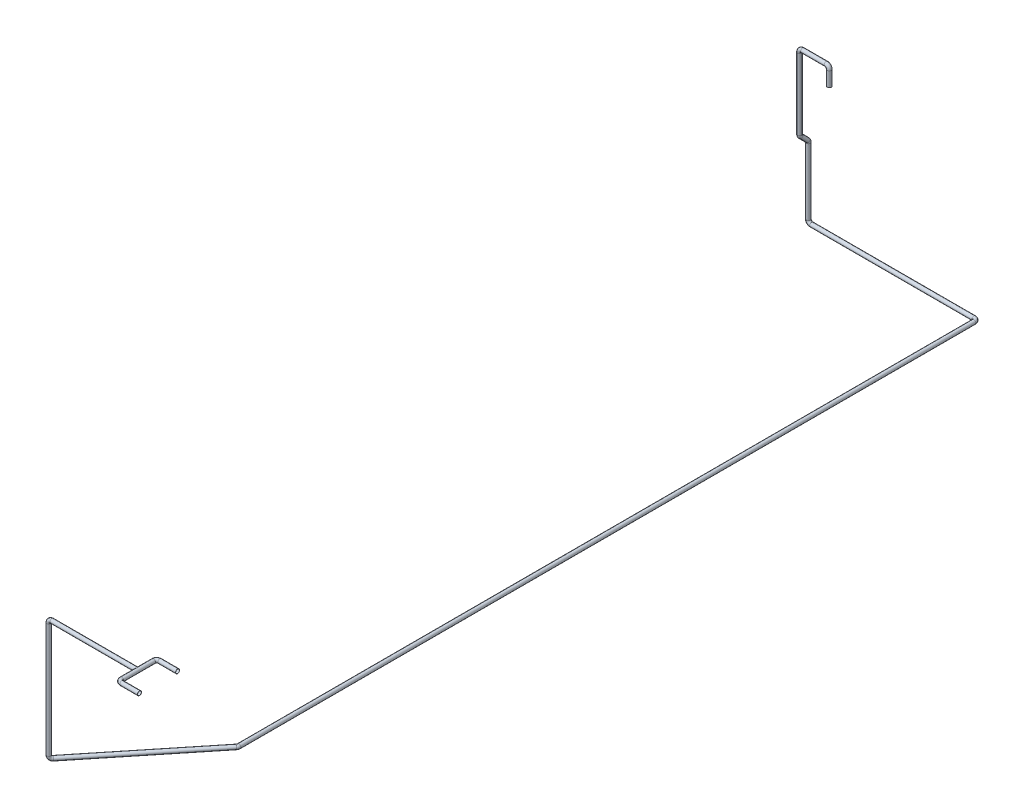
ISO-10303-21;
HEADER;
FILE_DESCRIPTION(('STEP AP214'),'2;1');
FILE_NAME('part.step','',(''),(''),'','','');
FILE_SCHEMA(('AUTOMOTIVE_DESIGN { 1 0 10303 214 1 1 1 1 }'));
ENDSEC;
DATA;
#1=APPLICATION_CONTEXT('core data for automotive mechanical design processes');
#2=APPLICATION_PROTOCOL_DEFINITION('international standard','automotive_design',2000,#1);
#3=PRODUCT_CONTEXT('',#1,'mechanical');
#4=PRODUCT('Part','Part','',(#3));
#5=PRODUCT_RELATED_PRODUCT_CATEGORY('part','',(#4));
#6=PRODUCT_DEFINITION_FORMATION('','',#4);
#7=PRODUCT_DEFINITION_CONTEXT('part definition',#1,'design');
#8=PRODUCT_DEFINITION('design','',#6,#7);
#9=PRODUCT_DEFINITION_SHAPE('','',#8);
#10=(LENGTH_UNIT() NAMED_UNIT(*) SI_UNIT(.MILLI.,.METRE.));
#11=(NAMED_UNIT(*) PLANE_ANGLE_UNIT() SI_UNIT($,.RADIAN.));
#12=(NAMED_UNIT(*) SI_UNIT($,.STERADIAN.) SOLID_ANGLE_UNIT());
#13=UNCERTAINTY_MEASURE_WITH_UNIT(LENGTH_MEASURE(1.E-05),#10,'distance_accuracy_value','');
#14=(GEOMETRIC_REPRESENTATION_CONTEXT(3) GLOBAL_UNCERTAINTY_ASSIGNED_CONTEXT((#13)) GLOBAL_UNIT_ASSIGNED_CONTEXT((#10,
#11,#12)) REPRESENTATION_CONTEXT('',''));
#15=CARTESIAN_POINT('',(0.,0.,0.));
#16=DIRECTION('',(0.,0.,1.));
#17=DIRECTION('',(1.,0.,0.));
#18=AXIS2_PLACEMENT_3D('',#15,#16,#17);
#19=CARTESIAN_POINT('',(910.000000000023,-263.999999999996,13168.2870686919));
#20=DIRECTION('',(1.,0.,0.));
#21=DIRECTION('',(0.,0.,-1.));
#22=AXIS2_PLACEMENT_3D('',#19,#20,#21);
#23=CYLINDRICAL_SURFACE('',#22,31.75);
#24=CARTESIAN_POINT('',(910.000000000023,-263.999999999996,13168.2870686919));
#25=DIRECTION('',(1.,0.,0.));
#26=DIRECTION('',(0.,0.778243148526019,-0.62796305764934));
#27=AXIS2_PLACEMENT_3D('',#24,#25,#26);
#28=CIRCLE('',#27,31.75);
#29=CARTESIAN_POINT('',(910.000000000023,-232.249999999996,13168.2870686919));
#30=VERTEX_POINT('',#29);
#31=EDGE_CURVE('E104',#30,#30,#28,.T.);
#32=ORIENTED_EDGE('',*,*,#31,.T.);
#33=EDGE_LOOP('',(#32));
#34=FACE_BOUND('',#33,.T.);
#35=CARTESIAN_POINT('',(2260.00000000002,-263.999999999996,13168.2870686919));
#36=DIRECTION('',(0.707106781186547,0.,0.707106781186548));
#37=DIRECTION('',(0.707106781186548,0.,-0.707106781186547));
#38=AXIS2_PLACEMENT_3D('',#35,#36,#37);
#39=ELLIPSE('',#38,44.9012806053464,31.7500000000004);
#40=CARTESIAN_POINT('',(2260.00000000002,-295.749999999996,13168.2870686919));
#41=VERTEX_POINT('',#40);
#42=CARTESIAN_POINT('',(2260.00000000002,-232.249999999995,13168.2870686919));
#43=VERTEX_POINT('',#42);
#44=EDGE_CURVE('E221',#41,#43,#39,.F.);
#45=ORIENTED_EDGE('',*,*,#44,.T.);
#46=CARTESIAN_POINT('',(2260.00000000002,-263.999999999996,13168.2870686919));
#47=DIRECTION('',(0.707106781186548,0.,-0.707106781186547));
#48=DIRECTION('',(0.707106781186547,0.,0.707106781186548));
#49=AXIS2_PLACEMENT_3D('',#46,#47,#48);
#50=ELLIPSE('',#49,44.9012806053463,31.7500000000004);
#51=EDGE_CURVE('E214',#43,#41,#50,.F.);
#52=ORIENTED_EDGE('',*,*,#51,.T.);
#53=EDGE_LOOP('',(#45,#52));
#54=FACE_BOUND('',#53,.T.);
#55=ADVANCED_FACE('F31',(#34,#54),#23,.T.);
#56=CARTESIAN_POINT('',(910.000000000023,-263.999999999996,13168.2870686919));
#57=DIRECTION('',(1.,0.,0.));
#58=DIRECTION('',(0.,0.,-1.));
#59=AXIS2_PLACEMENT_3D('',#56,#57,#58);
#60=CYLINDRICAL_SURFACE('',#59,30.5);
#61=CARTESIAN_POINT('',(910.000000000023,-263.999999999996,13168.2870686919));
#62=DIRECTION('',(1.,0.,0.));
#63=DIRECTION('',(0.,0.778243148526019,-0.62796305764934));
#64=AXIS2_PLACEMENT_3D('',#61,#62,#63);
#65=CIRCLE('',#64,30.5);
#66=CARTESIAN_POINT('',(910.000000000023,-233.499999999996,13168.2870686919));
#67=VERTEX_POINT('',#66);
#68=EDGE_CURVE('E107',#67,#67,#65,.T.);
#69=ORIENTED_EDGE('',*,*,#68,.F.);
#70=EDGE_LOOP('',(#69));
#71=FACE_BOUND('',#70,.T.);
#72=CARTESIAN_POINT('',(2228.25000000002,-263.999999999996,13137.7870686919));
#73=CARTESIAN_POINT('',(2228.24999482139,-264.690584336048,13137.7870634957));
#74=CARTESIAN_POINT('',(2228.27257038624,-265.3811086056,13137.8105620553));
#75=CARTESIAN_POINT('',(2228.36236413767,-266.756339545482,13137.904052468));
#76=CARTESIAN_POINT('',(2228.42959860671,-267.441044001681,13137.9740612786));
#77=CARTESIAN_POINT('',(2228.6073735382,-268.799533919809,13138.1592548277));
#78=CARTESIAN_POINT('',(2228.71797334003,-269.473303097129,13138.2745014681));
#79=CARTESIAN_POINT('',(2228.98016601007,-270.803836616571,13138.5478841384));
#80=CARTESIAN_POINT('',(2229.13175617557,-271.460602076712,13138.7060173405));
#81=CARTESIAN_POINT('',(2229.47186458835,-272.748489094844,13139.0611018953));
#82=CARTESIAN_POINT('',(2229.66012123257,-273.379756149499,13139.2577783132));
#83=CARTESIAN_POINT('',(2230.0710367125,-274.618160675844,13139.6875180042));
#84=CARTESIAN_POINT('',(2230.29369532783,-275.225298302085,13139.9205810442));
#85=CARTESIAN_POINT('',(2230.77005970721,-276.412997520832,13140.4198389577));
#86=CARTESIAN_POINT('',(2231.0237616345,-276.993562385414,13140.686029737));
#87=CARTESIAN_POINT('',(2231.5590079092,-278.126755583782,13141.2484850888));
#88=CARTESIAN_POINT('',(2231.84055868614,-278.679377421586,13141.5447566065));
#89=CARTESIAN_POINT('',(2232.34137566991,-279.596459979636,13142.0727259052));
#90=CARTESIAN_POINT('',(2232.55445895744,-279.968263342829,13142.2976316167));
#91=CARTESIAN_POINT('',(2232.991725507,-280.697192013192,13142.7598285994));
#92=CARTESIAN_POINT('',(2233.21590643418,-281.054320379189,13142.997117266));
#93=CARTESIAN_POINT('',(2233.9038368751,-282.103941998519,13143.7264618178));
#94=CARTESIAN_POINT('',(2234.38288871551,-282.774516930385,13144.2359064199));
#95=CARTESIAN_POINT('',(2235.37526842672,-284.058551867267,13145.2957738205));
#96=CARTESIAN_POINT('',(2235.88868035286,-284.671862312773,13145.8462975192));
#97=CARTESIAN_POINT('',(2236.94205324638,-285.840610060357,13146.9821007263));
#98=CARTESIAN_POINT('',(2237.48201257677,-286.396050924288,13147.5673780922));
#99=CARTESIAN_POINT('',(2238.39921515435,-287.275034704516,13148.5688735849));
#100=CARTESIAN_POINT('',(2238.77085906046,-287.614271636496,13148.9765904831));
#101=CARTESIAN_POINT('',(2239.52142914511,-288.268050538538,13149.8049123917));
#102=CARTESIAN_POINT('',(2239.90035511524,-288.582593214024,13150.2255170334));
#103=CARTESIAN_POINT('',(2240.66392924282,-289.187622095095,13151.0792899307));
#104=CARTESIAN_POINT('',(2241.04858111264,-289.478091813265,13151.512466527));
#105=CARTESIAN_POINT('',(2241.82143272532,-290.035150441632,13152.3907989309));
#106=CARTESIAN_POINT('',(2242.20963233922,-290.301740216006,13152.8359543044));
#107=CARTESIAN_POINT('',(2242.98684392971,-290.81101471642,13153.7375953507));
#108=CARTESIAN_POINT('',(2243.37585366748,-291.05373639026,13154.1940620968));
#109=CARTESIAN_POINT('',(2244.1528101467,-291.516056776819,13155.1195236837));
#110=CARTESIAN_POINT('',(2244.5407567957,-291.735653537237,13155.5885195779));
#111=CARTESIAN_POINT('',(2245.31199180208,-292.151672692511,13156.5396208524));
#112=CARTESIAN_POINT('',(2245.69528414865,-292.348116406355,13157.0217136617));
#113=CARTESIAN_POINT('',(2246.45321047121,-292.718017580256,13158.0011742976));
#114=CARTESIAN_POINT('',(2246.8278464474,-292.891480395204,13158.4985385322));
#115=CARTESIAN_POINT('',(2247.44327750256,-293.162732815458,13159.3475957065));
#116=CARTESIAN_POINT('',(2247.68813938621,-293.266841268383,13159.6943237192));
#117=CARTESIAN_POINT('',(2248.16819169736,-293.464183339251,13160.3974974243));
#118=CARTESIAN_POINT('',(2248.40338176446,-293.557416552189,13160.7539434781));
#119=CARTESIAN_POINT('',(2248.86013899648,-293.732570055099,13161.4780361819));
#120=CARTESIAN_POINT('',(2249.08171260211,-293.814495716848,13161.8456774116));
#121=CARTESIAN_POINT('',(2249.5057992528,-293.966398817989,13162.5940193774));
#122=CARTESIAN_POINT('',(2249.70831776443,-294.036379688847,13162.974716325));
#123=CARTESIAN_POINT('',(2250.15925706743,-294.187709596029,13163.899862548));
#124=CARTESIAN_POINT('',(2250.39576890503,-294.263231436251,13164.4514391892));
#125=CARTESIAN_POINT('',(2250.69095667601,-294.354819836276,13165.3011418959));
#126=CARTESIAN_POINT('',(2250.77936162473,-294.381716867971,13165.5877899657));
#127=CARTESIAN_POINT('',(2250.93223356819,-294.427692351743,13166.168074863));
#128=CARTESIAN_POINT('',(2250.9967080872,-294.446773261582,13166.4617094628));
#129=CARTESIAN_POINT('',(2251.08918628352,-294.473953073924,13167.0031351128));
#130=CARTESIAN_POINT('',(2251.1215585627,-294.483377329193,13167.2501126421));
#131=CARTESIAN_POINT('',(2251.16573472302,-294.496209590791,13167.7460579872));
#132=CARTESIAN_POINT('',(2251.17754156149,-294.499618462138,13167.9950255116));
#133=CARTESIAN_POINT('',(2251.17996900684,-294.500320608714,13168.4928947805));
#134=CARTESIAN_POINT('',(2251.17060487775,-294.497618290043,13168.7417964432));
#135=CARTESIAN_POINT('',(2251.13122070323,-294.4861879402,13169.2378222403));
#136=CARTESIAN_POINT('',(2251.10119747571,-294.477458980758,13169.4849460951));
#137=CARTESIAN_POINT('',(2251.01112098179,-294.45103175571,13170.042745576));
#138=CARTESIAN_POINT('',(2250.94511143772,-294.431536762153,13170.3523755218));
#139=CARTESIAN_POINT('',(2250.78635489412,-294.383845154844,13170.9640527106));
#140=CARTESIAN_POINT('',(2250.69359122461,-294.355643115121,13171.2660950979));
#141=CARTESIAN_POINT('',(2250.4857692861,-294.291150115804,13171.8629238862));
#142=CARTESIAN_POINT('',(2250.37061438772,-294.254823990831,13172.1576723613));
#143=CARTESIAN_POINT('',(2250.12279297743,-294.174828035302,13172.7385534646));
#144=CARTESIAN_POINT('',(2249.9901280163,-294.13115885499,13173.0246868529));
#145=CARTESIAN_POINT('',(2249.66239202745,-294.020587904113,13173.6873672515));
#146=CARTESIAN_POINT('',(2249.46169115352,-293.950894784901,13174.0606493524));
#147=CARTESIAN_POINT('',(2249.04232650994,-293.800027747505,13174.7946629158));
#148=CARTESIAN_POINT('',(2248.82365423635,-293.718848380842,13175.1553883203));
#149=CARTESIAN_POINT('',(2248.3730361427,-293.545466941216,13175.8666184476));
#150=CARTESIAN_POINT('',(2248.14106707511,-293.453245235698,13176.2171035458));
#151=CARTESIAN_POINT('',(2247.66789836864,-293.258285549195,13176.9086546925));
#152=CARTESIAN_POINT('',(2247.42670031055,-293.155549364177,13177.2497223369));
#153=CARTESIAN_POINT('',(2246.93646366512,-292.939223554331,13177.9254193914));
#154=CARTESIAN_POINT('',(2246.68739191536,-292.825582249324,13178.2600081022));
#155=CARTESIAN_POINT('',(2246.18456617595,-292.587999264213,13178.9219107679));
#156=CARTESIAN_POINT('',(2245.9308120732,-292.464057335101,13179.2492245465));
#157=CARTESIAN_POINT('',(2245.165372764,-292.077082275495,13180.2207913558));
#158=CARTESIAN_POINT('',(2244.64901657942,-291.798684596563,13180.8553382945));
#159=CARTESIAN_POINT('',(2243.74679240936,-291.27806775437,13181.9406135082));
#160=CARTESIAN_POINT('',(2243.36168581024,-291.045090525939,13182.3964692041));
#161=CARTESIAN_POINT('',(2242.59206060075,-290.556239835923,13183.2963457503));
#162=CARTESIAN_POINT('',(2242.20754203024,-290.300364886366,13183.7403658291));
#163=CARTESIAN_POINT('',(2241.441078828,-289.765240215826,13184.6169867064));
#164=CARTESIAN_POINT('',(2241.05913599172,-289.485975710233,13185.0495800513));
#165=CARTESIAN_POINT('',(2240.29998371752,-288.903828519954,13185.9028590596));
#166=CARTESIAN_POINT('',(2239.92277419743,-288.600946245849,13186.32354493));
#167=CARTESIAN_POINT('',(2239.17627672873,-287.972321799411,13187.1509669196));
#168=CARTESIAN_POINT('',(2238.80696401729,-287.646671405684,13187.5577502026));
#169=CARTESIAN_POINT('',(2238.07653894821,-286.971111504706,13188.3582518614));
#170=CARTESIAN_POINT('',(2237.71542688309,-286.621201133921,13188.7519697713));
#171=CARTESIAN_POINT('',(2236.64736999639,-285.534800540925,13189.9116843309));
#172=CARTESIAN_POINT('',(2235.95498011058,-284.76103818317,13190.6570408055));
#173=CARTESIAN_POINT('',(2234.85876978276,-283.402392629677,13191.8305543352));
#174=CARTESIAN_POINT('',(2234.43909141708,-282.846768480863,13192.2780873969));
#175=CARTESIAN_POINT('',(2233.62699058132,-281.692500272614,13193.1415394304));
#176=CARTESIAN_POINT('',(2233.23456602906,-281.093859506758,13193.5574608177));
#177=CARTESIAN_POINT('',(2232.48219606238,-279.854282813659,13194.3530176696));
#178=CARTESIAN_POINT('',(2232.12222670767,-279.213378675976,13194.7326798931));
#179=CARTESIAN_POINT('',(2231.43979068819,-277.889956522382,13195.4511196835));
#180=CARTESIAN_POINT('',(2231.11731792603,-277.207445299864,13195.7899038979));
#181=CARTESIAN_POINT('',(2230.56705543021,-275.923307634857,13196.3671677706));
#182=CARTESIAN_POINT('',(2230.33250643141,-275.32782775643,13196.6128910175));
#183=CARTESIAN_POINT('',(2229.89635771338,-274.111885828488,13197.0693778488));
#184=CARTESIAN_POINT('',(2229.69475469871,-273.491426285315,13197.2801449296));
#185=CARTESIAN_POINT('',(2229.32779886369,-272.228647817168,13197.6634962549));
#186=CARTESIAN_POINT('',(2229.16242941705,-271.586339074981,13197.8360980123));
#187=CARTESIAN_POINT('',(2228.87078597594,-270.283325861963,13198.1403322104));
#188=CARTESIAN_POINT('',(2228.74451230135,-269.622621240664,13198.2719643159));
#189=CARTESIAN_POINT('',(2228.53293515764,-268.283509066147,13198.4924430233));
#190=CARTESIAN_POINT('',(2228.44787658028,-267.605020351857,13198.581033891));
#191=CARTESIAN_POINT('',(2228.32166322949,-266.239541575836,13198.7124669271));
#192=CARTESIAN_POINT('',(2228.28050860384,-265.552551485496,13198.7553089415));
#193=CARTESIAN_POINT('',(2228.24302672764,-264.176157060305,13198.794328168));
#194=CARTESIAN_POINT('',(2228.24669066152,-263.486753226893,13198.790514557));
#195=CARTESIAN_POINT('',(2228.29874550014,-262.111512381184,13198.7363231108));
#196=CARTESIAN_POINT('',(2228.34713359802,-261.425675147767,13198.6859481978));
#197=CARTESIAN_POINT('',(2228.48089042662,-260.127960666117,13198.5466474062));
#198=CARTESIAN_POINT('',(2228.56232547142,-259.515227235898,13198.4618216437));
#199=CARTESIAN_POINT('',(2228.75952396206,-258.301480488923,13198.2563142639));
#200=CARTESIAN_POINT('',(2228.87528475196,-257.700466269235,13198.1356354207));
#201=CARTESIAN_POINT('',(2229.13925947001,-256.513552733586,13197.8602717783));
#202=CARTESIAN_POINT('',(2229.28747563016,-255.927654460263,13197.7055846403));
#203=CARTESIAN_POINT('',(2229.61414400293,-254.77385090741,13197.364382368));
#204=CARTESIAN_POINT('',(2229.79259810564,-254.205946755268,13197.1778652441));
#205=CARTESIAN_POINT('',(2230.18955841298,-253.054962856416,13196.7625649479));
#206=CARTESIAN_POINT('',(2230.40988903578,-252.47321162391,13196.5318492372));
#207=CARTESIAN_POINT('',(2230.87902657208,-251.334670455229,13196.0399794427));
#208=CARTESIAN_POINT('',(2231.12783384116,-250.777880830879,13195.7788249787));
#209=CARTESIAN_POINT('',(2231.65104403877,-249.69044316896,13195.2288206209));
#210=CARTESIAN_POINT('',(2231.92545511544,-249.159803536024,13194.9399619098));
#211=CARTESIAN_POINT('',(2232.49702713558,-248.125549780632,13194.3372159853));
#212=CARTESIAN_POINT('',(2232.79419302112,-247.621941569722,13194.0233233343));
#213=CARTESIAN_POINT('',(2233.34132255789,-246.74945013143,13193.4441655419));
#214=CARTESIAN_POINT('',(2233.58739500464,-246.375190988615,13193.1832800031));
#215=CARTESIAN_POINT('',(2234.09050146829,-245.643598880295,13192.64887721));
#216=CARTESIAN_POINT('',(2234.34753376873,-245.286263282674,13192.3753619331));
#217=CARTESIAN_POINT('',(2235.1336813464,-244.23916166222,13191.5369968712));
#218=CARTESIAN_POINT('',(2235.67770773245,-243.574521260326,13190.954475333));
#219=CARTESIAN_POINT('',(2236.79809233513,-242.310155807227,13189.747879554));
#220=CARTESIAN_POINT('',(2237.37452270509,-241.71058510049,13189.1237119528));
#221=CARTESIAN_POINT('',(2238.55088544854,-240.576393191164,13187.8400236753));
#222=CARTESIAN_POINT('',(2239.1508137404,-240.0417607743,13187.1805091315));
#223=CARTESIAN_POINT('',(2240.38346144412,-239.02179520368,13185.811000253));
#224=CARTESIAN_POINT('',(2241.01662890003,-238.538190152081,13185.1001223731));
#225=CARTESIAN_POINT('',(2241.9728571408,-237.861190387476,13184.0095242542));
#226=CARTESIAN_POINT('',(2242.29275557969,-237.643546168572,13183.6418551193));
#227=CARTESIAN_POINT('',(2242.93348472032,-237.224207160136,13182.898335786));
#228=CARTESIAN_POINT('',(2243.25431536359,-237.02251139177,13182.5224860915));
#229=CARTESIAN_POINT('',(2243.89496672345,-236.635236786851,13181.7630148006));
#230=CARTESIAN_POINT('',(2244.21478822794,-236.44963081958,13181.3794076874));
#231=CARTESIAN_POINT('',(2244.85228215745,-236.094045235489,13180.6033135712));
#232=CARTESIAN_POINT('',(2245.16995474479,-235.924064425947,13180.2108272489));
#233=CARTESIAN_POINT('',(2245.80089402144,-235.599760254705,13179.4163277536));
#234=CARTESIAN_POINT('',(2246.11416294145,-235.445428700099,13179.014319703));
#235=CARTESIAN_POINT('',(2246.73364701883,-235.152406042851,13178.1993773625));
#236=CARTESIAN_POINT('',(2247.03986323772,-235.013712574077,13177.7864447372));
#237=CARTESIAN_POINT('',(2247.58372150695,-234.77725477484,13177.0281870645));
#238=CARTESIAN_POINT('',(2247.8232545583,-234.676741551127,13176.6850793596));
#239=CARTESIAN_POINT('',(2248.29236134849,-234.486312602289,13175.9891761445));
#240=CARTESIAN_POINT('',(2248.52193445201,-234.396397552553,13175.6363800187));
#241=CARTESIAN_POINT('',(2248.96719044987,-234.227592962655,13174.9195132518));
#242=CARTESIAN_POINT('',(2249.18287534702,-234.148701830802,13174.5554442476));
#243=CARTESIAN_POINT('',(2249.59478730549,-234.002635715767,13173.8143534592));
#244=CARTESIAN_POINT('',(2249.79102037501,-233.935457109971,13173.4373357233));
#245=CARTESIAN_POINT('',(2250.22604149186,-233.790690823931,13172.5221267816));
#246=CARTESIAN_POINT('',(2250.4528123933,-233.718791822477,13171.9769572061));
#247=CARTESIAN_POINT('',(2250.73337450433,-233.632221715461,13171.1378282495));
#248=CARTESIAN_POINT('',(2250.8169031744,-233.606927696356,13170.8548813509));
#249=CARTESIAN_POINT('',(2250.96024310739,-233.563987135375,13170.2824125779));
#250=CARTESIAN_POINT('',(2251.0200612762,-233.546338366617,13169.9928926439));
#251=CARTESIAN_POINT('',(2251.10516497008,-233.521383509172,13169.4551963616));
#252=CARTESIAN_POINT('',(2251.13440940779,-233.512885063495,13169.2077026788));
#253=CARTESIAN_POINT('',(2251.17214917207,-233.501935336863,13168.7110049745));
#254=CARTESIAN_POINT('',(2251.18064729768,-233.499483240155,13168.4618011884));
#255=CARTESIAN_POINT('',(2251.17644785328,-233.500697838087,13167.9637040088));
#256=CARTESIAN_POINT('',(2251.16376001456,-233.504361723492,13167.7148105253));
#257=CARTESIAN_POINT('',(2251.11787673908,-233.517694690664,13167.2190841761));
#258=CARTESIAN_POINT('',(2251.08467799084,-233.527364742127,13166.9722516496));
#259=CARTESIAN_POINT('',(2250.98669613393,-233.55617972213,13166.4095979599));
#260=CARTESIAN_POINT('',(2250.91547048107,-233.57728269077,13166.0949976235));
#261=CARTESIAN_POINT('',(2250.74597249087,-233.628413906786,13165.4738751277));
#262=CARTESIAN_POINT('',(2250.64768238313,-233.658448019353,13165.1673584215));
#263=CARTESIAN_POINT('',(2250.42873293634,-233.726801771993,13164.5619225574));
#264=CARTESIAN_POINT('',(2250.30797586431,-233.765157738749,13164.2630433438));
#265=CARTESIAN_POINT('',(2250.04904484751,-233.849385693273,13163.6741596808));
#266=CARTESIAN_POINT('',(2249.91087270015,-233.895256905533,13163.3841543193));
#267=CARTESIAN_POINT('',(2249.56750220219,-234.012180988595,13162.7068789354));
#268=CARTESIAN_POINT('',(2249.3563708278,-234.086283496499,13162.323158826));
#269=CARTESIAN_POINT('',(2248.9160356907,-234.246626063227,13161.568773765));
#270=CARTESIAN_POINT('',(2248.68682338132,-234.332871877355,13161.1981151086));
#271=CARTESIAN_POINT('',(2248.21517021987,-234.517046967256,13160.4673704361));
#272=CARTESIAN_POINT('',(2247.97270633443,-234.61499696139,13160.1073046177));
#273=CARTESIAN_POINT('',(2247.47870563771,-234.82207256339,13159.3968833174));
#274=CARTESIAN_POINT('',(2247.22717039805,-234.931196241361,13159.0465261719));
#275=CARTESIAN_POINT('',(2246.71649249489,-235.160969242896,13158.3525569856));
#276=CARTESIAN_POINT('',(2246.45731963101,-235.28167033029,13158.0089843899));
#277=CARTESIAN_POINT('',(2245.9345416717,-235.534060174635,13157.3293501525));
#278=CARTESIAN_POINT('',(2245.6709364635,-235.665749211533,13156.9932887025));
#279=CARTESIAN_POINT('',(2244.87637500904,-236.077008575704,13155.9958484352));
#280=CARTESIAN_POINT('',(2244.34115745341,-236.373000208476,13155.3445256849));
#281=CARTESIAN_POINT('',(2243.42485603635,-236.916373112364,13154.2520108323));
#282=CARTESIAN_POINT('',(2243.04428228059,-237.152803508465,13153.8048685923));
#283=CARTESIAN_POINT('',(2242.28431659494,-237.648099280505,13152.9220569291));
#284=CARTESIAN_POINT('',(2241.90492473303,-237.906965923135,13152.4863881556));
#285=CARTESIAN_POINT('',(2241.14916441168,-238.447611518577,13151.6262284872));
#286=CARTESIAN_POINT('',(2240.77279792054,-238.729404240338,13151.2017445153));
#287=CARTESIAN_POINT('',(2240.02512293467,-239.316146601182,13150.3644936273));
#288=CARTESIAN_POINT('',(2239.65381434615,-239.62109581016,13149.9517264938));
#289=CARTESIAN_POINT('',(2238.91931263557,-240.253399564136,13149.1399375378));
#290=CARTESIAN_POINT('',(2238.55609432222,-240.58066589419,13148.7408700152));
#291=CARTESIAN_POINT('',(2237.83804020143,-241.25897778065,13147.955685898));
#292=CARTESIAN_POINT('',(2237.48320468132,-241.610024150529,13147.569569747));
#293=CARTESIAN_POINT('',(2236.43415624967,-242.699091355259,13146.4324947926));
#294=CARTESIAN_POINT('',(2235.75470243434,-243.473634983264,13145.7020404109));
#295=CARTESIAN_POINT('',(2234.6784617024,-244.833629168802,13144.5511617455));
#296=CARTESIAN_POINT('',(2234.2658535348,-245.390602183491,13144.1115814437));
#297=CARTESIAN_POINT('',(2233.46808487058,-246.546829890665,13143.2640682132));
#298=CARTESIAN_POINT('',(2233.08292236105,-247.146081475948,13142.8561329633));
#299=CARTESIAN_POINT('',(2232.3450385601,-248.386357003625,13142.0763792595));
#300=CARTESIAN_POINT('',(2231.99230189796,-249.027360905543,13141.7045436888));
#301=CARTESIAN_POINT('',(2231.4914704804,-250.019175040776,13141.1775365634));
#302=CARTESIAN_POINT('',(2231.32924455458,-250.354817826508,13141.0069977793));
#303=CARTESIAN_POINT('',(2231.01481751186,-251.036108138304,13140.6767289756));
#304=CARTESIAN_POINT('',(2230.86261902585,-251.381758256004,13140.5170017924));
#305=CARTESIAN_POINT('',(2230.4715063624,-252.315388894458,13140.1068380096));
#306=CARTESIAN_POINT('',(2230.24209678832,-252.911918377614,13139.8665725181));
#307=CARTESIAN_POINT('',(2229.81643560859,-254.12930156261,13139.4211830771));
#308=CARTESIAN_POINT('',(2229.6201773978,-254.750150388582,13139.2160521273));
#309=CARTESIAN_POINT('',(2229.26419895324,-256.012374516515,13138.8442454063));
#310=CARTESIAN_POINT('',(2229.10441926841,-256.653714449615,13138.6775070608));
#311=CARTESIAN_POINT('',(2228.82391523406,-257.953812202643,13138.3849368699));
#312=CARTESIAN_POINT('',(2228.7031775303,-258.612563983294,13138.2590910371));
#313=CARTESIAN_POINT('',(2228.48658136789,-260.052782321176,13138.033403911));
#314=CARTESIAN_POINT('',(2228.39809190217,-260.836596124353,13137.9412553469));
#315=CARTESIAN_POINT('',(2228.27979770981,-262.41363166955,13137.8180839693));
#316=CARTESIAN_POINT('',(2228.25000594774,-263.206855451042,13137.7870746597));
#317=CARTESIAN_POINT('',(2228.25000000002,-263.999999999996,13137.7870686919));
#318=B_SPLINE_CURVE_WITH_KNOTS('',3,(#72,#73,#74,#75,#76,#77,#78,#79,#80,#81,#82,#83,#84,#85,
#86,#87,#88,#89,#90,#91,#92,#93,#94,#95,#96,#97,#98,#99,#100,#101,#102,#103,#104,#105,#106,#107,
#108,#109,#110,#111,#112,#113,#114,#115,#116,#117,#118,#119,#120,#121,#122,#123,#124,#125,#126,
#127,#128,#129,#130,#131,#132,#133,#134,#135,#136,#137,#138,#139,#140,#141,#142,#143,#144,#145,
#146,#147,#148,#149,#150,#151,#152,#153,#154,#155,#156,#157,#158,#159,#160,#161,#162,#163,#164,
#165,#166,#167,#168,#169,#170,#171,#172,#173,#174,#175,#176,#177,#178,#179,#180,#181,#182,#183,
#184,#185,#186,#187,#188,#189,#190,#191,#192,#193,#194,#195,#196,#197,#198,#199,#200,#201,#202,
#203,#204,#205,#206,#207,#208,#209,#210,#211,#212,#213,#214,#215,#216,#217,#218,#219,#220,#221,
#222,#223,#224,#225,#226,#227,#228,#229,#230,#231,#232,#233,#234,#235,#236,#237,#238,#239,#240,
#241,#242,#243,#244,#245,#246,#247,#248,#249,#250,#251,#252,#253,#254,#255,#256,#257,#258,#259,
#260,#261,#262,#263,#264,#265,#266,#267,#268,#269,#270,#271,#272,#273,#274,#275,#276,#277,#278,
#279,#280,#281,#282,#283,#284,#285,#286,#287,#288,#289,#290,#291,#292,#293,#294,#295,#296,#297,
#298,#299,#300,#301,#302,#303,#304,#305,#306,#307,#308,#309,#310,#311,#312,#313,#314,#315,#316,
#317),.UNSPECIFIED.,.T.,.F.,(4,2,2,2,2,2,2,2,2,2,2,2,2,2,2,2,2,2,2,2,2,2,2,2,2,2,2,2,2,2,2,2,2,
2,2,2,2,2,2,2,2,2,2,2,2,2,2,2,2,2,2,2,2,2,2,2,2,2,2,2,2,2,2,2,2,2,2,2,2,2,2,2,2,2,2,2,2,2,2,2,2,
2,2,2,2,2,2,2,2,2,2,2,2,2,2,2,2,2,2,2,2,2,2,2,2,2,2,2,2,2,2,2,2,2,2,2,2,2,2,2,2,2,4),(0.,
2.07088953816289,4.14253452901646,6.21702422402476,8.29137717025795,10.3514392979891,
12.4114882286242,14.4712828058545,16.531554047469,17.9829572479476,19.434056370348,
22.3368474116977,25.247019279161,28.1570119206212,30.0993347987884,32.0416021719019,
33.9851889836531,35.9287054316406,37.869164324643,39.8097869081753,41.7486083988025,
43.6869773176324,44.9978515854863,46.3087746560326,47.6190727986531,48.9289938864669,
50.7379940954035,51.6406220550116,52.5429659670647,53.2899151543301,54.0367569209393,
54.7830603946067,55.5294788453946,56.479433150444,57.4299806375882,58.3847250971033,
59.3393850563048,60.6269410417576,61.9151098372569,63.2056039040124,64.4958779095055,
65.7926008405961,67.0893551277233,69.6802919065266,71.6016898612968,73.5232127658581,
75.4459595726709,77.3686729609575,79.2840389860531,81.1994732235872,85.0266485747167,
87.5080331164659,89.9892278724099,92.4685771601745,94.947522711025,97.002234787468,
99.0567412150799,101.110302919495,103.163881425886,105.229516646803,107.295158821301,
109.360394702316,111.42550097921,113.295145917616,115.16464623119,117.034275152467,
118.904020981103,120.892568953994,122.881141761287,124.870349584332,126.85999067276,
128.414473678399,129.968714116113,133.078090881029,136.194688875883,139.310747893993,
142.511230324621,144.112226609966,145.713124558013,147.311268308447,148.909289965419,
150.506470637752,152.103409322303,153.39416382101,154.685000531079,155.975650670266,
157.265900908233,159.044649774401,159.932060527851,160.819212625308,161.566418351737,
162.313523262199,163.060285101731,163.807167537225,164.775272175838,165.744013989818,
166.717072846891,167.690031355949,169.021620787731,170.3538434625,171.688460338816,
173.022847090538,174.363505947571,175.704198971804,178.382920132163,180.28144882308,
182.180084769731,184.079869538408,185.979619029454,187.872251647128,189.764949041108,
193.546764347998,196.007319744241,198.467694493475,200.926896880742,202.156404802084,
203.386234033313,205.43245795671,207.478273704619,209.520731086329,211.562489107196,
213.940405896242,216.318847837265),.UNSPECIFIED.);
#319=CARTESIAN_POINT('',(2228.25000000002,-263.999999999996,13137.7870686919));
#320=VERTEX_POINT('',#319);
#321=EDGE_CURVE('E11',#320,#320,#318,.T.);
#322=ORIENTED_EDGE('',*,*,#321,.F.);
#323=EDGE_LOOP('',(#322));
#324=FACE_BOUND('',#323,.T.);
#325=ADVANCED_FACE('F408',(#71,#324),#60,.F.);
#326=CARTESIAN_POINT('',(910.000000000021,-313.999999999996,13168.2870686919));
#327=DIRECTION('',(0.,0.,-1.));
#328=DIRECTION('',(-1.,0.,0.));
#329=AXIS2_PLACEMENT_3D('',#326,#327,#328);
#330=TOROIDAL_SURFACE('',#329,49.9999999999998,31.75);
#331=CARTESIAN_POINT('',(860.000000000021,-313.999999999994,13168.2870686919));
#332=DIRECTION('',(0.,1.,0.));
#333=DIRECTION('',(-0.778243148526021,0.,-0.627963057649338));
#334=AXIS2_PLACEMENT_3D('',#331,#332,#333);
#335=CIRCLE('',#334,31.75);
#336=CARTESIAN_POINT('',(828.250000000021,-313.999999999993,13168.2870686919));
#337=VERTEX_POINT('',#336);
#338=EDGE_CURVE('E110',#337,#337,#335,.T.);
#339=CARTESIAN_POINT('',(910.000000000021,-313.999999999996,13168.2870686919));
#340=DIRECTION('',(0.,0.,-1.));
#341=DIRECTION('',(-1.,0.,0.));
#342=AXIS2_PLACEMENT_3D('',#339,#340,#341);
#343=CIRCLE('',#342,81.7499999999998);
#344=EDGE_CURVE('',#337,#30,#343,.T.);
#345=ORIENTED_EDGE('',*,*,#338,.T.);
#346=ORIENTED_EDGE('',*,*,#31,.F.);
#347=ORIENTED_EDGE('',*,*,#344,.T.);
#348=ORIENTED_EDGE('',*,*,#344,.F.);
#349=EDGE_LOOP('',(#345,#347,#346,#348));
#350=FACE_BOUND('',#349,.T.);
#351=ADVANCED_FACE('F405',(#350),#330,.T.);
#352=CARTESIAN_POINT('',(910.000000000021,-313.999999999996,13168.2870686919));
#353=DIRECTION('',(0.,0.,-1.));
#354=DIRECTION('',(-1.,0.,0.));
#355=AXIS2_PLACEMENT_3D('',#352,#353,#354);
#356=TOROIDAL_SURFACE('',#355,49.9999999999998,30.5);
#357=CARTESIAN_POINT('',(860.000000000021,-313.999999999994,13168.2870686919));
#358=DIRECTION('',(0.,1.,0.));
#359=DIRECTION('',(-0.778243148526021,0.,-0.627963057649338));
#360=AXIS2_PLACEMENT_3D('',#357,#358,#359);
#361=CIRCLE('',#360,30.5);
#362=CARTESIAN_POINT('',(829.500000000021,-313.999999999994,13168.2870686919));
#363=VERTEX_POINT('',#362);
#364=EDGE_CURVE('E113',#363,#363,#361,.T.);
#365=CARTESIAN_POINT('',(910.000000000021,-313.999999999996,13168.2870686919));
#366=DIRECTION('',(0.,0.,-1.));
#367=DIRECTION('',(-1.,0.,0.));
#368=AXIS2_PLACEMENT_3D('',#365,#366,#367);
#369=CIRCLE('',#368,80.4999999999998);
#370=EDGE_CURVE('',#363,#67,#369,.T.);
#371=ORIENTED_EDGE('',*,*,#364,.F.);
#372=ORIENTED_EDGE('',*,*,#68,.T.);
#373=ORIENTED_EDGE('',*,*,#370,.T.);
#374=ORIENTED_EDGE('',*,*,#370,.F.);
#375=EDGE_LOOP('',(#371,#373,#372,#374));
#376=FACE_BOUND('',#375,.T.);
#377=ADVANCED_FACE('F402',(#376),#356,.F.);
#378=CARTESIAN_POINT('',(860.000000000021,-2119.99999999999,13168.2870686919));
#379=DIRECTION('',(0.,1.,0.));
#380=DIRECTION('',(-1.,0.,0.));
#381=AXIS2_PLACEMENT_3D('',#378,#379,#380);
#382=CYLINDRICAL_SURFACE('',#381,31.75);
#383=CARTESIAN_POINT('',(860.000000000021,-2119.99999999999,13168.2870686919));
#384=DIRECTION('',(0.,1.,0.));
#385=DIRECTION('',(-0.778243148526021,0.,-0.627963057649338));
#386=AXIS2_PLACEMENT_3D('',#383,#384,#385);
#387=CIRCLE('',#386,31.75);
#388=CARTESIAN_POINT('',(840.062172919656,-2119.99999999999,13192.9962886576));
#389=VERTEX_POINT('',#388);
#390=EDGE_CURVE('E116',#389,#389,#387,.T.);
#391=ORIENTED_EDGE('',*,*,#390,.T.);
#392=EDGE_LOOP('',(#391));
#393=FACE_BOUND('',#392,.T.);
#394=ORIENTED_EDGE('',*,*,#338,.F.);
#395=EDGE_LOOP('',(#394));
#396=FACE_BOUND('',#395,.T.);
#397=ADVANCED_FACE('F398',(#393,#396),#382,.T.);
#398=CARTESIAN_POINT('',(860.000000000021,-2119.99999999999,13168.2870686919));
#399=DIRECTION('',(0.,1.,0.));
#400=DIRECTION('',(-1.,0.,0.));
#401=AXIS2_PLACEMENT_3D('',#398,#399,#400);
#402=CYLINDRICAL_SURFACE('',#401,30.5);
#403=CARTESIAN_POINT('',(860.000000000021,-2119.99999999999,13168.2870686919));
#404=DIRECTION('',(0.,1.,0.));
#405=DIRECTION('',(-0.778243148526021,0.,-0.627963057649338));
#406=AXIS2_PLACEMENT_3D('',#403,#404,#405);
#407=CIRCLE('',#406,30.5);
#408=CARTESIAN_POINT('',(840.847126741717,-2119.99999999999,13192.0234847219));
#409=VERTEX_POINT('',#408);
#410=EDGE_CURVE('E119',#409,#409,#407,.T.);
#411=ORIENTED_EDGE('',*,*,#410,.F.);
#412=EDGE_LOOP('',(#411));
#413=FACE_BOUND('',#412,.T.);
#414=ORIENTED_EDGE('',*,*,#364,.T.);
#415=EDGE_LOOP('',(#414));
#416=FACE_BOUND('',#415,.T.);
#417=ADVANCED_FACE('F394',(#413,#416),#402,.F.);
#418=CARTESIAN_POINT('',(891.398152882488,-2119.99999999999,13129.3749112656));
#419=DIRECTION('',(-0.778243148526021,0.,-0.627963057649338));
#420=DIRECTION('',(-0.627963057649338,0.,0.778243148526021));
#421=AXIS2_PLACEMENT_3D('',#418,#419,#420);
#422=TOROIDAL_SURFACE('',#421,50.0000000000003,31.75);
#423=CARTESIAN_POINT('',(891.398152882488,-2170.,13129.3749112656));
#424=DIRECTION('',(-0.627963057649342,0.,0.778243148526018));
#425=DIRECTION('',(-0.778243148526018,0.,-0.627963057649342));
#426=AXIS2_PLACEMENT_3D('',#423,#424,#425);
#427=CIRCLE('',#426,31.75);
#428=CARTESIAN_POINT('',(891.398152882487,-2201.75,13129.3749112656));
#429=VERTEX_POINT('',#428);
#430=EDGE_CURVE('E122',#429,#429,#427,.T.);
#431=CARTESIAN_POINT('',(891.398152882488,-2119.99999999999,13129.3749112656));
#432=DIRECTION('',(-0.778243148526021,0.,-0.627963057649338));
#433=DIRECTION('',(-0.627963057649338,0.,0.778243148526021));
#434=AXIS2_PLACEMENT_3D('',#431,#432,#433);
#435=CIRCLE('',#434,81.7500000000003);
#436=EDGE_CURVE('',#429,#389,#435,.T.);
#437=ORIENTED_EDGE('',*,*,#430,.T.);
#438=ORIENTED_EDGE('',*,*,#390,.F.);
#439=ORIENTED_EDGE('',*,*,#436,.T.);
#440=ORIENTED_EDGE('',*,*,#436,.F.);
#441=EDGE_LOOP('',(#437,#439,#438,#440));
#442=FACE_BOUND('',#441,.T.);
#443=ADVANCED_FACE('F390',(#442),#422,.T.);
#444=CARTESIAN_POINT('',(891.398152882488,-2119.99999999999,13129.3749112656));
#445=DIRECTION('',(-0.778243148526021,0.,-0.627963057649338));
#446=DIRECTION('',(-0.627963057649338,0.,0.778243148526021));
#447=AXIS2_PLACEMENT_3D('',#444,#445,#446);
#448=TOROIDAL_SURFACE('',#447,50.0000000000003,30.5);
#449=CARTESIAN_POINT('',(891.398152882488,-2170.,13129.3749112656));
#450=DIRECTION('',(-0.627963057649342,0.,0.778243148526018));
#451=DIRECTION('',(-0.778243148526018,0.,-0.627963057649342));
#452=AXIS2_PLACEMENT_3D('',#449,#450,#451);
#453=CIRCLE('',#452,30.5);
#454=CARTESIAN_POINT('',(891.398152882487,-2200.5,13129.3749112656));
#455=VERTEX_POINT('',#454);
#456=EDGE_CURVE('E125',#455,#455,#453,.T.);
#457=CARTESIAN_POINT('',(891.398152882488,-2119.99999999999,13129.3749112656));
#458=DIRECTION('',(-0.778243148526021,0.,-0.627963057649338));
#459=DIRECTION('',(-0.627963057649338,0.,0.778243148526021));
#460=AXIS2_PLACEMENT_3D('',#457,#458,#459);
#461=CIRCLE('',#460,80.5000000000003);
#462=EDGE_CURVE('',#455,#409,#461,.T.);
#463=ORIENTED_EDGE('',*,*,#456,.F.);
#464=ORIENTED_EDGE('',*,*,#410,.T.);
#465=ORIENTED_EDGE('',*,*,#462,.T.);
#466=ORIENTED_EDGE('',*,*,#462,.F.);
#467=EDGE_LOOP('',(#463,#465,#464,#466));
#468=FACE_BOUND('',#467,.T.);
#469=ADVANCED_FACE('F386',(#468),#448,.F.);
#470=CARTESIAN_POINT('',(2178.91215742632,-2170.,11533.7413139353));
#471=DIRECTION('',(-0.627963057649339,0.,0.77824314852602));
#472=DIRECTION('',(0.77824314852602,0.,0.627963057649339));
#473=AXIS2_PLACEMENT_3D('',#470,#471,#472);
#474=CYLINDRICAL_SURFACE('',#473,31.75);
#475=CARTESIAN_POINT('',(2178.91215742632,-2170.,11533.7413139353));
#476=DIRECTION('',(-0.627963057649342,0.,0.778243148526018));
#477=DIRECTION('',(-0.778243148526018,0.,-0.627963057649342));
#478=AXIS2_PLACEMENT_3D('',#475,#476,#477);
#479=CIRCLE('',#478,31.75);
#480=CARTESIAN_POINT('',(2203.62137739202,-2170.,11553.6791410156));
#481=VERTEX_POINT('',#480);
#482=EDGE_CURVE('E128',#481,#481,#479,.T.);
#483=ORIENTED_EDGE('',*,*,#482,.T.);
#484=EDGE_LOOP('',(#483));
#485=FACE_BOUND('',#484,.T.);
#486=ORIENTED_EDGE('',*,*,#430,.F.);
#487=EDGE_LOOP('',(#486));
#488=FACE_BOUND('',#487,.T.);
#489=ADVANCED_FACE('F382',(#485,#488),#474,.T.);
#490=CARTESIAN_POINT('',(2178.91215742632,-2170.,11533.7413139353));
#491=DIRECTION('',(-0.627963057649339,0.,0.77824314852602));
#492=DIRECTION('',(0.77824314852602,0.,0.627963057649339));
#493=AXIS2_PLACEMENT_3D('',#490,#491,#492);
#494=CYLINDRICAL_SURFACE('',#493,30.5);
#495=CARTESIAN_POINT('',(2178.91215742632,-2170.,11533.7413139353));
#496=DIRECTION('',(-0.627963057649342,0.,0.778243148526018));
#497=DIRECTION('',(-0.778243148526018,0.,-0.627963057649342));
#498=AXIS2_PLACEMENT_3D('',#495,#496,#497);
#499=CIRCLE('',#498,30.5);
#500=CARTESIAN_POINT('',(2202.64857345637,-2170.,11552.8941871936));
#501=VERTEX_POINT('',#500);
#502=EDGE_CURVE('E131',#501,#501,#499,.T.);
#503=ORIENTED_EDGE('',*,*,#502,.F.);
#504=EDGE_LOOP('',(#503));
#505=FACE_BOUND('',#504,.T.);
#506=ORIENTED_EDGE('',*,*,#456,.T.);
#507=EDGE_LOOP('',(#506));
#508=FACE_BOUND('',#507,.T.);
#509=ADVANCED_FACE('F378',(#505,#508),#494,.F.);
#510=CARTESIAN_POINT('',(2140.00000000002,-2170.,11502.3431610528));
#511=DIRECTION('',(0.,-1.,0.));
#512=DIRECTION('',(0.,0.,-1.));
#513=AXIS2_PLACEMENT_3D('',#510,#511,#512);
#514=TOROIDAL_SURFACE('',#513,50.0000000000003,31.75);
#515=CARTESIAN_POINT('',(2190.00000000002,-2170.,11502.3431610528));
#516=DIRECTION('',(0.,0.,1.));
#517=DIRECTION('',(-1.,0.,0.));
#518=AXIS2_PLACEMENT_3D('',#515,#516,#517);
#519=CIRCLE('',#518,31.75);
#520=CARTESIAN_POINT('',(2221.75000000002,-2170.,11502.3431610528));
#521=VERTEX_POINT('',#520);
#522=EDGE_CURVE('E134',#521,#521,#519,.T.);
#523=CARTESIAN_POINT('',(2140.00000000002,-2170.,11502.3431610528));
#524=DIRECTION('',(0.,-1.,0.));
#525=DIRECTION('',(0.,0.,-1.));
#526=AXIS2_PLACEMENT_3D('',#523,#524,#525);
#527=CIRCLE('',#526,81.7500000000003);
#528=EDGE_CURVE('',#521,#481,#527,.T.);
#529=ORIENTED_EDGE('',*,*,#522,.T.);
#530=ORIENTED_EDGE('',*,*,#482,.F.);
#531=ORIENTED_EDGE('',*,*,#528,.T.);
#532=ORIENTED_EDGE('',*,*,#528,.F.);
#533=EDGE_LOOP('',(#529,#531,#530,#532));
#534=FACE_BOUND('',#533,.T.);
#535=ADVANCED_FACE('F374',(#534),#514,.T.);
#536=CARTESIAN_POINT('',(2140.00000000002,-2170.,11502.3431610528));
#537=DIRECTION('',(0.,-1.,0.));
#538=DIRECTION('',(0.,0.,-1.));
#539=AXIS2_PLACEMENT_3D('',#536,#537,#538);
#540=TOROIDAL_SURFACE('',#539,50.0000000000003,30.5);
#541=CARTESIAN_POINT('',(2190.00000000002,-2170.,11502.3431610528));
#542=DIRECTION('',(0.,0.,1.));
#543=DIRECTION('',(-1.,0.,0.));
#544=AXIS2_PLACEMENT_3D('',#541,#542,#543);
#545=CIRCLE('',#544,30.5);
#546=CARTESIAN_POINT('',(2220.50000000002,-2170.,11502.3431610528));
#547=VERTEX_POINT('',#546);
#548=EDGE_CURVE('E137',#547,#547,#545,.T.);
#549=CARTESIAN_POINT('',(2140.00000000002,-2170.,11502.3431610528));
#550=DIRECTION('',(0.,-1.,0.));
#551=DIRECTION('',(0.,0.,-1.));
#552=AXIS2_PLACEMENT_3D('',#549,#550,#551);
#553=CIRCLE('',#552,80.5000000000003);
#554=EDGE_CURVE('',#547,#501,#553,.T.);
#555=ORIENTED_EDGE('',*,*,#548,.F.);
#556=ORIENTED_EDGE('',*,*,#502,.T.);
#557=ORIENTED_EDGE('',*,*,#554,.T.);
#558=ORIENTED_EDGE('',*,*,#554,.F.);
#559=EDGE_LOOP('',(#555,#557,#556,#558));
#560=FACE_BOUND('',#559,.T.);
#561=ADVANCED_FACE('F370',(#560),#540,.F.);
#562=CARTESIAN_POINT('',(2190.00000000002,-2170.,-90.0000000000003));
#563=DIRECTION('',(0.,0.,1.));
#564=DIRECTION('',(1.,0.,0.));
#565=AXIS2_PLACEMENT_3D('',#562,#563,#564);
#566=CYLINDRICAL_SURFACE('',#565,31.75);
#567=CARTESIAN_POINT('',(2190.00000000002,-2170.,-90.0000000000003));
#568=DIRECTION('',(0.,0.,1.));
#569=DIRECTION('',(-1.,0.,0.));
#570=AXIS2_PLACEMENT_3D('',#567,#568,#569);
#571=CIRCLE('',#570,31.75);
#572=CARTESIAN_POINT('',(2221.75000000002,-2170.,-90.0000000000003));
#573=VERTEX_POINT('',#572);
#574=EDGE_CURVE('E140',#573,#573,#571,.T.);
#575=ORIENTED_EDGE('',*,*,#574,.T.);
#576=EDGE_LOOP('',(#575));
#577=FACE_BOUND('',#576,.T.);
#578=ORIENTED_EDGE('',*,*,#522,.F.);
#579=EDGE_LOOP('',(#578));
#580=FACE_BOUND('',#579,.T.);
#581=ADVANCED_FACE('F366',(#577,#580),#566,.T.);
#582=CARTESIAN_POINT('',(2190.00000000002,-2170.,-90.0000000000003));
#583=DIRECTION('',(0.,0.,1.));
#584=DIRECTION('',(1.,0.,0.));
#585=AXIS2_PLACEMENT_3D('',#582,#583,#584);
#586=CYLINDRICAL_SURFACE('',#585,30.5);
#587=CARTESIAN_POINT('',(2190.00000000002,-2170.,-90.0000000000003));
#588=DIRECTION('',(0.,0.,1.));
#589=DIRECTION('',(-1.,0.,0.));
#590=AXIS2_PLACEMENT_3D('',#587,#588,#589);
#591=CIRCLE('',#590,30.5);
#592=CARTESIAN_POINT('',(2220.50000000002,-2170.,-90.0000000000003));
#593=VERTEX_POINT('',#592);
#594=EDGE_CURVE('E143',#593,#593,#591,.T.);
#595=ORIENTED_EDGE('',*,*,#594,.F.);
#596=EDGE_LOOP('',(#595));
#597=FACE_BOUND('',#596,.T.);
#598=ORIENTED_EDGE('',*,*,#548,.T.);
#599=EDGE_LOOP('',(#598));
#600=FACE_BOUND('',#599,.T.);
#601=ADVANCED_FACE('F362',(#597,#600),#586,.F.);
#602=CARTESIAN_POINT('',(2140.00000000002,-2170.,-90.0000000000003));
#603=DIRECTION('',(0.,-1.,0.));
#604=DIRECTION('',(0.,0.,-1.));
#605=AXIS2_PLACEMENT_3D('',#602,#603,#604);
#606=TOROIDAL_SURFACE('',#605,50.0000000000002,31.75);
#607=CARTESIAN_POINT('',(2140.00000000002,-2170.,-140.000000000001));
#608=DIRECTION('',(1.,0.,0.));
#609=DIRECTION('',(0.,0.,1.));
#610=AXIS2_PLACEMENT_3D('',#607,#608,#609);
#611=CIRCLE('',#610,31.75);
#612=CARTESIAN_POINT('',(2140.00000000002,-2170.,-171.750000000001));
#613=VERTEX_POINT('',#612);
#614=EDGE_CURVE('E146',#613,#613,#611,.T.);
#615=CARTESIAN_POINT('',(2140.00000000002,-2170.,-90.0000000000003));
#616=DIRECTION('',(0.,-1.,0.));
#617=DIRECTION('',(0.,0.,-1.));
#618=AXIS2_PLACEMENT_3D('',#615,#616,#617);
#619=CIRCLE('',#618,81.7500000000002);
#620=EDGE_CURVE('',#613,#573,#619,.T.);
#621=ORIENTED_EDGE('',*,*,#614,.T.);
#622=ORIENTED_EDGE('',*,*,#574,.F.);
#623=ORIENTED_EDGE('',*,*,#620,.T.);
#624=ORIENTED_EDGE('',*,*,#620,.F.);
#625=EDGE_LOOP('',(#621,#623,#622,#624));
#626=FACE_BOUND('',#625,.T.);
#627=ADVANCED_FACE('F358',(#626),#606,.T.);
#628=CARTESIAN_POINT('',(2140.00000000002,-2170.,-90.0000000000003));
#629=DIRECTION('',(0.,-1.,0.));
#630=DIRECTION('',(0.,0.,-1.));
#631=AXIS2_PLACEMENT_3D('',#628,#629,#630);
#632=TOROIDAL_SURFACE('',#631,50.0000000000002,30.5);
#633=CARTESIAN_POINT('',(2140.00000000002,-2170.,-140.000000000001));
#634=DIRECTION('',(1.,0.,0.));
#635=DIRECTION('',(0.,0.,1.));
#636=AXIS2_PLACEMENT_3D('',#633,#634,#635);
#637=CIRCLE('',#636,30.5);
#638=CARTESIAN_POINT('',(2140.00000000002,-2170.,-170.500000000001));
#639=VERTEX_POINT('',#638);
#640=EDGE_CURVE('E149',#639,#639,#637,.T.);
#641=CARTESIAN_POINT('',(2140.00000000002,-2170.,-90.0000000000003));
#642=DIRECTION('',(0.,-1.,0.));
#643=DIRECTION('',(0.,0.,-1.));
#644=AXIS2_PLACEMENT_3D('',#641,#642,#643);
#645=CIRCLE('',#644,80.5000000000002);
#646=EDGE_CURVE('',#639,#593,#645,.T.);
#647=ORIENTED_EDGE('',*,*,#640,.F.);
#648=ORIENTED_EDGE('',*,*,#594,.T.);
#649=ORIENTED_EDGE('',*,*,#646,.T.);
#650=ORIENTED_EDGE('',*,*,#646,.F.);
#651=EDGE_LOOP('',(#647,#649,#648,#650));
#652=FACE_BOUND('',#651,.T.);
#653=ADVANCED_FACE('F354',(#652),#632,.F.);
#654=CARTESIAN_POINT('',(-419.999999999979,-2170.,-140.));
#655=DIRECTION('',(1.,0.,0.));
#656=DIRECTION('',(0.,1.,0.));
#657=AXIS2_PLACEMENT_3D('',#654,#655,#656);
#658=CYLINDRICAL_SURFACE('',#657,31.75);
#659=CARTESIAN_POINT('',(-419.999999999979,-2170.,-140.));
#660=DIRECTION('',(1.,0.,0.));
#661=DIRECTION('',(0.,0.,1.));
#662=AXIS2_PLACEMENT_3D('',#659,#660,#661);
#663=CIRCLE('',#662,31.75);
#664=CARTESIAN_POINT('',(-419.999999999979,-2201.75,-140.));
#665=VERTEX_POINT('',#664);
#666=EDGE_CURVE('E152',#665,#665,#663,.T.);
#667=ORIENTED_EDGE('',*,*,#666,.T.);
#668=EDGE_LOOP('',(#667));
#669=FACE_BOUND('',#668,.T.);
#670=ORIENTED_EDGE('',*,*,#614,.F.);
#671=EDGE_LOOP('',(#670));
#672=FACE_BOUND('',#671,.T.);
#673=ADVANCED_FACE('F350',(#669,#672),#658,.T.);
#674=CARTESIAN_POINT('',(-419.999999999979,-2170.,-140.));
#675=DIRECTION('',(1.,0.,0.));
#676=DIRECTION('',(0.,1.,0.));
#677=AXIS2_PLACEMENT_3D('',#674,#675,#676);
#678=CYLINDRICAL_SURFACE('',#677,30.5);
#679=CARTESIAN_POINT('',(-419.999999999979,-2170.,-140.));
#680=DIRECTION('',(1.,0.,0.));
#681=DIRECTION('',(0.,0.,1.));
#682=AXIS2_PLACEMENT_3D('',#679,#680,#681);
#683=CIRCLE('',#682,30.5);
#684=CARTESIAN_POINT('',(-419.999999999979,-2200.5,-140.));
#685=VERTEX_POINT('',#684);
#686=EDGE_CURVE('E155',#685,#685,#683,.T.);
#687=ORIENTED_EDGE('',*,*,#686,.F.);
#688=EDGE_LOOP('',(#687));
#689=FACE_BOUND('',#688,.T.);
#690=ORIENTED_EDGE('',*,*,#640,.T.);
#691=EDGE_LOOP('',(#690));
#692=FACE_BOUND('',#691,.T.);
#693=ADVANCED_FACE('F346',(#689,#692),#678,.F.);
#694=CARTESIAN_POINT('',(-419.999999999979,-2120.,-140.));
#695=DIRECTION('',(0.,0.,1.));
#696=DIRECTION('',(1.,0.,0.));
#697=AXIS2_PLACEMENT_3D('',#694,#695,#696);
#698=TOROIDAL_SURFACE('',#697,50.0000000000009,31.75);
#699=CARTESIAN_POINT('',(-469.99999999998,-2120.,-140.));
#700=DIRECTION('',(0.,-1.,0.));
#701=DIRECTION('',(0.,0.,1.));
#702=AXIS2_PLACEMENT_3D('',#699,#700,#701);
#703=CIRCLE('',#702,31.75);
#704=CARTESIAN_POINT('',(-501.74999999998,-2120.,-140.));
#705=VERTEX_POINT('',#704);
#706=EDGE_CURVE('E158',#705,#705,#703,.T.);
#707=CARTESIAN_POINT('',(-419.999999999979,-2120.,-140.));
#708=DIRECTION('',(0.,0.,1.));
#709=DIRECTION('',(1.,0.,0.));
#710=AXIS2_PLACEMENT_3D('',#707,#708,#709);
#711=CIRCLE('',#710,81.7500000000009);
#712=EDGE_CURVE('',#705,#665,#711,.T.);
#713=ORIENTED_EDGE('',*,*,#706,.T.);
#714=ORIENTED_EDGE('',*,*,#666,.F.);
#715=ORIENTED_EDGE('',*,*,#712,.T.);
#716=ORIENTED_EDGE('',*,*,#712,.F.);
#717=EDGE_LOOP('',(#713,#715,#714,#716));
#718=FACE_BOUND('',#717,.T.);
#719=ADVANCED_FACE('F342',(#718),#698,.T.);
#720=CARTESIAN_POINT('',(-419.999999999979,-2120.,-140.));
#721=DIRECTION('',(0.,0.,1.));
#722=DIRECTION('',(1.,0.,0.));
#723=AXIS2_PLACEMENT_3D('',#720,#721,#722);
#724=TOROIDAL_SURFACE('',#723,50.0000000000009,30.5);
#725=CARTESIAN_POINT('',(-469.99999999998,-2120.,-140.));
#726=DIRECTION('',(0.,-1.,0.));
#727=DIRECTION('',(0.,0.,1.));
#728=AXIS2_PLACEMENT_3D('',#725,#726,#727);
#729=CIRCLE('',#728,30.5);
#730=CARTESIAN_POINT('',(-500.49999999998,-2120.,-140.));
#731=VERTEX_POINT('',#730);
#732=EDGE_CURVE('E161',#731,#731,#729,.T.);
#733=CARTESIAN_POINT('',(-419.999999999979,-2120.,-140.));
#734=DIRECTION('',(0.,0.,1.));
#735=DIRECTION('',(1.,0.,0.));
#736=AXIS2_PLACEMENT_3D('',#733,#734,#735);
#737=CIRCLE('',#736,80.5000000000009);
#738=EDGE_CURVE('',#731,#685,#737,.T.);
#739=ORIENTED_EDGE('',*,*,#732,.F.);
#740=ORIENTED_EDGE('',*,*,#686,.T.);
#741=ORIENTED_EDGE('',*,*,#738,.T.);
#742=ORIENTED_EDGE('',*,*,#738,.F.);
#743=EDGE_LOOP('',(#739,#741,#740,#742));
#744=FACE_BOUND('',#743,.T.);
#745=ADVANCED_FACE('F338',(#744),#724,.F.);
#746=CARTESIAN_POINT('',(-469.999999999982,-1070.71067811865,-140.));
#747=DIRECTION('',(0.,-1.,0.));
#748=DIRECTION('',(1.,0.,0.));
#749=AXIS2_PLACEMENT_3D('',#746,#747,#748);
#750=CYLINDRICAL_SURFACE('',#749,31.75);
#751=CARTESIAN_POINT('',(-469.999999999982,-1070.71067811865,-140.));
#752=DIRECTION('',(0.,-1.,0.));
#753=DIRECTION('',(0.,0.,1.));
#754=AXIS2_PLACEMENT_3D('',#751,#752,#753);
#755=CIRCLE('',#754,31.75);
#756=CARTESIAN_POINT('',(-469.999999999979,-1070.71067811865,-171.75));
#757=VERTEX_POINT('',#756);
#758=EDGE_CURVE('E164',#757,#757,#755,.T.);
#759=ORIENTED_EDGE('',*,*,#758,.T.);
#760=EDGE_LOOP('',(#759));
#761=FACE_BOUND('',#760,.T.);
#762=ORIENTED_EDGE('',*,*,#706,.F.);
#763=EDGE_LOOP('',(#762));
#764=FACE_BOUND('',#763,.T.);
#765=ADVANCED_FACE('F334',(#761,#764),#750,.T.);
#766=CARTESIAN_POINT('',(-469.999999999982,-1070.71067811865,-140.));
#767=DIRECTION('',(0.,-1.,0.));
#768=DIRECTION('',(1.,0.,0.));
#769=AXIS2_PLACEMENT_3D('',#766,#767,#768);
#770=CYLINDRICAL_SURFACE('',#769,30.5);
#771=CARTESIAN_POINT('',(-469.999999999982,-1070.71067811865,-140.));
#772=DIRECTION('',(0.,-1.,0.));
#773=DIRECTION('',(0.,0.,1.));
#774=AXIS2_PLACEMENT_3D('',#771,#772,#773);
#775=CIRCLE('',#774,30.5);
#776=CARTESIAN_POINT('',(-469.999999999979,-1070.71067811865,-170.5));
#777=VERTEX_POINT('',#776);
#778=EDGE_CURVE('E167',#777,#777,#775,.T.);
#779=ORIENTED_EDGE('',*,*,#778,.F.);
#780=EDGE_LOOP('',(#779));
#781=FACE_BOUND('',#780,.T.);
#782=ORIENTED_EDGE('',*,*,#732,.T.);
#783=EDGE_LOOP('',(#782));
#784=FACE_BOUND('',#783,.T.);
#785=ADVANCED_FACE('F330',(#781,#784),#770,.F.);
#786=CARTESIAN_POINT('',(-469.999999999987,-1070.71067811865,-89.9999999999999));
#787=DIRECTION('',(-1.,0.,-1.02140518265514E-13));
#788=DIRECTION('',(-1.02140518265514E-13,0.,1.));
#789=AXIS2_PLACEMENT_3D('',#786,#787,#788);
#790=TOROIDAL_SURFACE('',#789,50.0000000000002,31.75);
#791=CARTESIAN_POINT('',(-469.999999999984,-1035.35533905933,-125.355339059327));
#792=DIRECTION('',(0.,-0.707106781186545,-0.70710678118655));
#793=DIRECTION('',(0.,-0.70710678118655,0.707106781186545));
#794=AXIS2_PLACEMENT_3D('',#791,#792,#793);
#795=CIRCLE('',#794,31.75);
#796=CARTESIAN_POINT('',(-469.999999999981,-1012.90469875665,-147.805979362));
#797=VERTEX_POINT('',#796);
#798=EDGE_CURVE('E170',#797,#797,#795,.T.);
#799=CARTESIAN_POINT('',(-469.999999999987,-1070.71067811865,-89.9999999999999));
#800=DIRECTION('',(-1.,0.,-1.02140518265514E-13));
#801=DIRECTION('',(-1.02140518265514E-13,0.,1.));
#802=AXIS2_PLACEMENT_3D('',#799,#800,#801);
#803=CIRCLE('',#802,81.7500000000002);
#804=EDGE_CURVE('',#797,#757,#803,.T.);
#805=ORIENTED_EDGE('',*,*,#798,.T.);
#806=ORIENTED_EDGE('',*,*,#758,.F.);
#807=ORIENTED_EDGE('',*,*,#804,.T.);
#808=ORIENTED_EDGE('',*,*,#804,.F.);
#809=EDGE_LOOP('',(#805,#807,#806,#808));
#810=FACE_BOUND('',#809,.T.);
#811=ADVANCED_FACE('F326',(#810),#790,.T.);
#812=CARTESIAN_POINT('',(-469.999999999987,-1070.71067811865,-89.9999999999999));
#813=DIRECTION('',(-1.,0.,-1.02140518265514E-13));
#814=DIRECTION('',(-1.02140518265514E-13,0.,1.));
#815=AXIS2_PLACEMENT_3D('',#812,#813,#814);
#816=TOROIDAL_SURFACE('',#815,50.0000000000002,30.5);
#817=CARTESIAN_POINT('',(-469.999999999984,-1035.35533905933,-125.355339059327));
#818=DIRECTION('',(0.,-0.707106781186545,-0.70710678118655));
#819=DIRECTION('',(0.,-0.70710678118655,0.707106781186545));
#820=AXIS2_PLACEMENT_3D('',#817,#818,#819);
#821=CIRCLE('',#820,30.5);
#822=CARTESIAN_POINT('',(-469.999999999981,-1013.78858223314,-146.922095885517));
#823=VERTEX_POINT('',#822);
#824=EDGE_CURVE('E173',#823,#823,#821,.T.);
#825=CARTESIAN_POINT('',(-469.999999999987,-1070.71067811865,-89.9999999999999));
#826=DIRECTION('',(-1.,0.,-1.02140518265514E-13));
#827=DIRECTION('',(-1.02140518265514E-13,0.,1.));
#828=AXIS2_PLACEMENT_3D('',#825,#826,#827);
#829=CIRCLE('',#828,80.5000000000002);
#830=EDGE_CURVE('',#823,#777,#829,.T.);
#831=ORIENTED_EDGE('',*,*,#824,.F.);
#832=ORIENTED_EDGE('',*,*,#778,.T.);
#833=ORIENTED_EDGE('',*,*,#830,.T.);
#834=ORIENTED_EDGE('',*,*,#830,.F.);
#835=EDGE_LOOP('',(#831,#833,#832,#834));
#836=FACE_BOUND('',#835,.T.);
#837=ADVANCED_FACE('F322',(#836),#816,.F.);
#838=CARTESIAN_POINT('',(-469.999999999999,-924.644660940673,-14.6446609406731));
#839=DIRECTION('',(0.,-0.707106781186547,-0.707106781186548));
#840=DIRECTION('',(0.,0.707106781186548,-0.707106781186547));
#841=AXIS2_PLACEMENT_3D('',#838,#839,#840);
#842=CYLINDRICAL_SURFACE('',#841,31.75);
#843=CARTESIAN_POINT('',(-469.999999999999,-924.644660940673,-14.6446609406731));
#844=DIRECTION('',(0.,-0.707106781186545,-0.70710678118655));
#845=DIRECTION('',(0.,-0.70710678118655,0.707106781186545));
#846=AXIS2_PLACEMENT_3D('',#843,#844,#845);
#847=CIRCLE('',#846,31.75);
#848=CARTESIAN_POINT('',(-470.000000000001,-947.095301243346,7.80597936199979));
#849=VERTEX_POINT('',#848);
#850=EDGE_CURVE('E176',#849,#849,#847,.T.);
#851=ORIENTED_EDGE('',*,*,#850,.T.);
#852=EDGE_LOOP('',(#851));
#853=FACE_BOUND('',#852,.T.);
#854=ORIENTED_EDGE('',*,*,#798,.F.);
#855=EDGE_LOOP('',(#854));
#856=FACE_BOUND('',#855,.T.);
#857=ADVANCED_FACE('F318',(#853,#856),#842,.T.);
#858=CARTESIAN_POINT('',(-469.999999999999,-924.644660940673,-14.6446609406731));
#859=DIRECTION('',(0.,-0.707106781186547,-0.707106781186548));
#860=DIRECTION('',(0.,0.707106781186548,-0.707106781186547));
#861=AXIS2_PLACEMENT_3D('',#858,#859,#860);
#862=CYLINDRICAL_SURFACE('',#861,30.5);
#863=CARTESIAN_POINT('',(-469.999999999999,-924.644660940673,-14.6446609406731));
#864=DIRECTION('',(0.,-0.707106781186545,-0.70710678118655));
#865=DIRECTION('',(0.,-0.70710678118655,0.707106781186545));
#866=AXIS2_PLACEMENT_3D('',#863,#864,#865);
#867=CIRCLE('',#866,30.5);
#868=CARTESIAN_POINT('',(-470.000000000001,-946.211417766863,6.92209588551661));
#869=VERTEX_POINT('',#868);
#870=EDGE_CURVE('E179',#869,#869,#867,.T.);
#871=ORIENTED_EDGE('',*,*,#870,.F.);
#872=EDGE_LOOP('',(#871));
#873=FACE_BOUND('',#872,.T.);
#874=ORIENTED_EDGE('',*,*,#824,.T.);
#875=EDGE_LOOP('',(#874));
#876=FACE_BOUND('',#875,.T.);
#877=ADVANCED_FACE('F314',(#873,#876),#862,.F.);
#878=CARTESIAN_POINT('',(-469.999999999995,-889.289321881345,-50.0000000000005));
#879=DIRECTION('',(1.,0.,1.02001740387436E-13));
#880=DIRECTION('',(1.02001740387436E-13,0.,-1.));
#881=AXIS2_PLACEMENT_3D('',#878,#879,#880);
#882=TOROIDAL_SURFACE('',#881,50.0000000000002,31.75);
#883=CARTESIAN_POINT('',(-470.,-889.289321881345,-3.35586630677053E-13));
#884=DIRECTION('',(0.,-1.,0.));
#885=DIRECTION('',(0.,0.,1.));
#886=AXIS2_PLACEMENT_3D('',#883,#884,#885);
#887=CIRCLE('',#886,31.75);
#888=CARTESIAN_POINT('',(-470.000000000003,-889.289321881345,31.7499999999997));
#889=VERTEX_POINT('',#888);
#890=EDGE_CURVE('E182',#889,#889,#887,.T.);
#891=CARTESIAN_POINT('',(-469.999999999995,-889.289321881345,-50.0000000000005));
#892=DIRECTION('',(1.,0.,1.02001740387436E-13));
#893=DIRECTION('',(1.02001740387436E-13,0.,-1.));
#894=AXIS2_PLACEMENT_3D('',#891,#892,#893);
#895=CIRCLE('',#894,81.7500000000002);
#896=EDGE_CURVE('',#889,#849,#895,.T.);
#897=ORIENTED_EDGE('',*,*,#890,.T.);
#898=ORIENTED_EDGE('',*,*,#850,.F.);
#899=ORIENTED_EDGE('',*,*,#896,.T.);
#900=ORIENTED_EDGE('',*,*,#896,.F.);
#901=EDGE_LOOP('',(#897,#899,#898,#900));
#902=FACE_BOUND('',#901,.T.);
#903=ADVANCED_FACE('F310',(#902),#882,.T.);
#904=CARTESIAN_POINT('',(-469.999999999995,-889.289321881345,-50.0000000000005));
#905=DIRECTION('',(1.,0.,1.02001740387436E-13));
#906=DIRECTION('',(1.02001740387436E-13,0.,-1.));
#907=AXIS2_PLACEMENT_3D('',#904,#905,#906);
#908=TOROIDAL_SURFACE('',#907,50.0000000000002,30.5);
#909=CARTESIAN_POINT('',(-470.,-889.289321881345,-3.35586630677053E-13));
#910=DIRECTION('',(0.,-1.,0.));
#911=DIRECTION('',(0.,0.,1.));
#912=AXIS2_PLACEMENT_3D('',#909,#910,#911);
#913=CIRCLE('',#912,30.5);
#914=CARTESIAN_POINT('',(-470.000000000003,-889.289321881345,30.4999999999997));
#915=VERTEX_POINT('',#914);
#916=EDGE_CURVE('E185',#915,#915,#913,.T.);
#917=CARTESIAN_POINT('',(-469.999999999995,-889.289321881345,-50.0000000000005));
#918=DIRECTION('',(1.,0.,1.02001740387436E-13));
#919=DIRECTION('',(1.02001740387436E-13,0.,-1.));
#920=AXIS2_PLACEMENT_3D('',#917,#918,#919);
#921=CIRCLE('',#920,80.5000000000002);
#922=EDGE_CURVE('',#915,#869,#921,.T.);
#923=ORIENTED_EDGE('',*,*,#916,.F.);
#924=ORIENTED_EDGE('',*,*,#870,.T.);
#925=ORIENTED_EDGE('',*,*,#922,.T.);
#926=ORIENTED_EDGE('',*,*,#922,.F.);
#927=EDGE_LOOP('',(#923,#925,#924,#926));
#928=FACE_BOUND('',#927,.T.);
#929=ADVANCED_FACE('F306',(#928),#908,.F.);
#930=CARTESIAN_POINT('',(-470.,230.,0.));
#931=DIRECTION('',(0.,-1.,0.));
#932=DIRECTION('',(0.,0.,-1.));
#933=AXIS2_PLACEMENT_3D('',#930,#931,#932);
#934=CYLINDRICAL_SURFACE('',#933,31.75);
#935=CARTESIAN_POINT('',(-470.,230.,0.));
#936=DIRECTION('',(0.,-1.,0.));
#937=DIRECTION('',(0.,0.,1.));
#938=AXIS2_PLACEMENT_3D('',#935,#936,#937);
#939=CIRCLE('',#938,31.75);
#940=CARTESIAN_POINT('',(-501.75,230.,0.));
#941=VERTEX_POINT('',#940);
#942=EDGE_CURVE('E188',#941,#941,#939,.T.);
#943=ORIENTED_EDGE('',*,*,#942,.T.);
#944=EDGE_LOOP('',(#943));
#945=FACE_BOUND('',#944,.T.);
#946=ORIENTED_EDGE('',*,*,#890,.F.);
#947=EDGE_LOOP('',(#946));
#948=FACE_BOUND('',#947,.T.);
#949=ADVANCED_FACE('F302',(#945,#948),#934,.T.);
#950=CARTESIAN_POINT('',(-470.,230.,0.));
#951=DIRECTION('',(0.,-1.,0.));
#952=DIRECTION('',(0.,0.,-1.));
#953=AXIS2_PLACEMENT_3D('',#950,#951,#952);
#954=CYLINDRICAL_SURFACE('',#953,30.5);
#955=CARTESIAN_POINT('',(-470.,230.,0.));
#956=DIRECTION('',(0.,-1.,0.));
#957=DIRECTION('',(0.,0.,1.));
#958=AXIS2_PLACEMENT_3D('',#955,#956,#957);
#959=CIRCLE('',#958,30.5);
#960=CARTESIAN_POINT('',(-500.5,230.,0.));
#961=VERTEX_POINT('',#960);
#962=EDGE_CURVE('E191',#961,#961,#959,.T.);
#963=ORIENTED_EDGE('',*,*,#962,.F.);
#964=EDGE_LOOP('',(#963));
#965=FACE_BOUND('',#964,.T.);
#966=ORIENTED_EDGE('',*,*,#916,.T.);
#967=EDGE_LOOP('',(#966));
#968=FACE_BOUND('',#967,.T.);
#969=ADVANCED_FACE('F298',(#965,#968),#954,.F.);
#970=CARTESIAN_POINT('',(-420.,230.,0.));
#971=DIRECTION('',(0.,0.,1.));
#972=DIRECTION('',(1.,0.,0.));
#973=AXIS2_PLACEMENT_3D('',#970,#971,#972);
#974=TOROIDAL_SURFACE('',#973,50.0000000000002,31.75);
#975=CARTESIAN_POINT('',(-420.,280.,0.));
#976=DIRECTION('',(-1.,0.,0.));
#977=DIRECTION('',(0.,0.,1.));
#978=AXIS2_PLACEMENT_3D('',#975,#976,#977);
#979=CIRCLE('',#978,31.75);
#980=CARTESIAN_POINT('',(-420.,311.75,0.));
#981=VERTEX_POINT('',#980);
#982=EDGE_CURVE('E194',#981,#981,#979,.T.);
#983=CARTESIAN_POINT('',(-420.,230.,0.));
#984=DIRECTION('',(0.,0.,1.));
#985=DIRECTION('',(1.,0.,0.));
#986=AXIS2_PLACEMENT_3D('',#983,#984,#985);
#987=CIRCLE('',#986,81.7500000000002);
#988=EDGE_CURVE('',#981,#941,#987,.T.);
#989=ORIENTED_EDGE('',*,*,#982,.T.);
#990=ORIENTED_EDGE('',*,*,#942,.F.);
#991=ORIENTED_EDGE('',*,*,#988,.T.);
#992=ORIENTED_EDGE('',*,*,#988,.F.);
#993=EDGE_LOOP('',(#989,#991,#990,#992));
#994=FACE_BOUND('',#993,.T.);
#995=ADVANCED_FACE('F294',(#994),#974,.T.);
#996=CARTESIAN_POINT('',(-420.,230.,0.));
#997=DIRECTION('',(0.,0.,1.));
#998=DIRECTION('',(1.,0.,0.));
#999=AXIS2_PLACEMENT_3D('',#996,#997,#998);
#1000=TOROIDAL_SURFACE('',#999,50.0000000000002,30.5);
#1001=CARTESIAN_POINT('',(-420.,280.,0.));
#1002=DIRECTION('',(-1.,0.,0.));
#1003=DIRECTION('',(0.,0.,1.));
#1004=AXIS2_PLACEMENT_3D('',#1001,#1002,#1003);
#1005=CIRCLE('',#1004,30.5);
#1006=CARTESIAN_POINT('',(-420.,310.5,0.));
#1007=VERTEX_POINT('',#1006);
#1008=EDGE_CURVE('E197',#1007,#1007,#1005,.T.);
#1009=CARTESIAN_POINT('',(-420.,230.,0.));
#1010=DIRECTION('',(0.,0.,1.));
#1011=DIRECTION('',(1.,0.,0.));
#1012=AXIS2_PLACEMENT_3D('',#1009,#1010,#1011);
#1013=CIRCLE('',#1012,80.5000000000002);
#1014=EDGE_CURVE('',#1007,#961,#1013,.T.);
#1015=ORIENTED_EDGE('',*,*,#1008,.F.);
#1016=ORIENTED_EDGE('',*,*,#962,.T.);
#1017=ORIENTED_EDGE('',*,*,#1014,.T.);
#1018=ORIENTED_EDGE('',*,*,#1014,.F.);
#1019=EDGE_LOOP('',(#1015,#1017,#1016,#1018));
#1020=FACE_BOUND('',#1019,.T.);
#1021=ADVANCED_FACE('F290',(#1020),#1000,.F.);
#1022=CARTESIAN_POINT('',(-50.,280.,0.));
#1023=DIRECTION('',(-1.,0.,0.));
#1024=DIRECTION('',(0.,0.,1.));
#1025=AXIS2_PLACEMENT_3D('',#1022,#1023,#1024);
#1026=CYLINDRICAL_SURFACE('',#1025,31.75);
#1027=CARTESIAN_POINT('',(-50.,280.,0.));
#1028=DIRECTION('',(-1.,0.,0.));
#1029=DIRECTION('',(0.,0.,1.));
#1030=AXIS2_PLACEMENT_3D('',#1027,#1028,#1029);
#1031=CIRCLE('',#1030,31.75);
#1032=CARTESIAN_POINT('',(-50.,311.75,0.));
#1033=VERTEX_POINT('',#1032);
#1034=EDGE_CURVE('E200',#1033,#1033,#1031,.T.);
#1035=ORIENTED_EDGE('',*,*,#1034,.T.);
#1036=EDGE_LOOP('',(#1035));
#1037=FACE_BOUND('',#1036,.T.);
#1038=ORIENTED_EDGE('',*,*,#982,.F.);
#1039=EDGE_LOOP('',(#1038));
#1040=FACE_BOUND('',#1039,.T.);
#1041=ADVANCED_FACE('F286',(#1037,#1040),#1026,.T.);
#1042=CARTESIAN_POINT('',(-50.,280.,0.));
#1043=DIRECTION('',(-1.,0.,0.));
#1044=DIRECTION('',(0.,0.,1.));
#1045=AXIS2_PLACEMENT_3D('',#1042,#1043,#1044);
#1046=CYLINDRICAL_SURFACE('',#1045,30.5);
#1047=CARTESIAN_POINT('',(-50.,280.,0.));
#1048=DIRECTION('',(-1.,0.,0.));
#1049=DIRECTION('',(0.,0.,1.));
#1050=AXIS2_PLACEMENT_3D('',#1047,#1048,#1049);
#1051=CIRCLE('',#1050,30.5);
#1052=CARTESIAN_POINT('',(-50.,310.5,0.));
#1053=VERTEX_POINT('',#1052);
#1054=EDGE_CURVE('E203',#1053,#1053,#1051,.T.);
#1055=ORIENTED_EDGE('',*,*,#1054,.F.);
#1056=EDGE_LOOP('',(#1055));
#1057=FACE_BOUND('',#1056,.T.);
#1058=ORIENTED_EDGE('',*,*,#1008,.T.);
#1059=EDGE_LOOP('',(#1058));
#1060=FACE_BOUND('',#1059,.T.);
#1061=ADVANCED_FACE('F282',(#1057,#1060),#1046,.F.);
#1062=CARTESIAN_POINT('',(-50.,230.,0.));
#1063=DIRECTION('',(0.,0.,1.));
#1064=DIRECTION('',(1.,0.,0.));
#1065=AXIS2_PLACEMENT_3D('',#1062,#1063,#1064);
#1066=TOROIDAL_SURFACE('',#1065,50.,31.75);
#1067=CARTESIAN_POINT('',(0.,230.,0.));
#1068=DIRECTION('',(0.,1.,0.));
#1069=DIRECTION('',(0.,0.,1.));
#1070=AXIS2_PLACEMENT_3D('',#1067,#1068,#1069);
#1071=CIRCLE('',#1070,31.75);
#1072=CARTESIAN_POINT('',(31.75,230.,0.));
#1073=VERTEX_POINT('',#1072);
#1074=EDGE_CURVE('E206',#1073,#1073,#1071,.T.);
#1075=CARTESIAN_POINT('',(-50.,230.,0.));
#1076=DIRECTION('',(0.,0.,1.));
#1077=DIRECTION('',(1.,0.,0.));
#1078=AXIS2_PLACEMENT_3D('',#1075,#1076,#1077);
#1079=CIRCLE('',#1078,81.75);
#1080=EDGE_CURVE('',#1073,#1033,#1079,.T.);
#1081=ORIENTED_EDGE('',*,*,#1074,.T.);
#1082=ORIENTED_EDGE('',*,*,#1034,.F.);
#1083=ORIENTED_EDGE('',*,*,#1080,.T.);
#1084=ORIENTED_EDGE('',*,*,#1080,.F.);
#1085=EDGE_LOOP('',(#1081,#1083,#1082,#1084));
#1086=FACE_BOUND('',#1085,.T.);
#1087=ADVANCED_FACE('F278',(#1086),#1066,.T.);
#1088=CARTESIAN_POINT('',(-50.,230.,0.));
#1089=DIRECTION('',(0.,0.,1.));
#1090=DIRECTION('',(1.,0.,0.));
#1091=AXIS2_PLACEMENT_3D('',#1088,#1089,#1090);
#1092=TOROIDAL_SURFACE('',#1091,50.,30.5);
#1093=CARTESIAN_POINT('',(0.,230.,0.));
#1094=DIRECTION('',(0.,1.,0.));
#1095=DIRECTION('',(0.,0.,1.));
#1096=AXIS2_PLACEMENT_3D('',#1093,#1094,#1095);
#1097=CIRCLE('',#1096,30.5);
#1098=CARTESIAN_POINT('',(30.5,230.,0.));
#1099=VERTEX_POINT('',#1098);
#1100=EDGE_CURVE('E210',#1099,#1099,#1097,.T.);
#1101=CARTESIAN_POINT('',(-50.,230.,0.));
#1102=DIRECTION('',(0.,0.,1.));
#1103=DIRECTION('',(1.,0.,0.));
#1104=AXIS2_PLACEMENT_3D('',#1101,#1102,#1103);
#1105=CIRCLE('',#1104,80.5);
#1106=EDGE_CURVE('',#1099,#1053,#1105,.T.);
#1107=ORIENTED_EDGE('',*,*,#1100,.F.);
#1108=ORIENTED_EDGE('',*,*,#1054,.T.);
#1109=ORIENTED_EDGE('',*,*,#1106,.T.);
#1110=ORIENTED_EDGE('',*,*,#1106,.F.);
#1111=EDGE_LOOP('',(#1107,#1109,#1108,#1110));
#1112=FACE_BOUND('',#1111,.T.);
#1113=ADVANCED_FACE('F274',(#1112),#1092,.F.);
#1114=CARTESIAN_POINT('',(0.,230.,0.));
#1115=DIRECTION('',(0.,-1.,0.));
#1116=DIRECTION('',(0.,0.,-1.));
#1117=AXIS2_PLACEMENT_3D('',#1114,#1115,#1116);
#1118=CYLINDRICAL_SURFACE('',#1117,30.5);
#1119=ORIENTED_EDGE('',*,*,#1100,.T.);
#1120=EDGE_LOOP('',(#1119));
#1121=FACE_BOUND('',#1120,.T.);
#1122=CARTESIAN_POINT('',(0.,0.,0.));
#1123=DIRECTION('',(0.,1.,0.));
#1124=DIRECTION('',(0.,0.,1.));
#1125=AXIS2_PLACEMENT_3D('',#1122,#1123,#1124);
#1126=CIRCLE('',#1125,30.5);
#1127=CARTESIAN_POINT('',(0.,0.,30.5));
#1128=VERTEX_POINT('',#1127);
#1129=EDGE_CURVE('E211',#1128,#1128,#1126,.T.);
#1130=ORIENTED_EDGE('',*,*,#1129,.F.);
#1131=EDGE_LOOP('',(#1130));
#1132=FACE_BOUND('',#1131,.T.);
#1133=ADVANCED_FACE('F270',(#1121,#1132),#1118,.F.);
#1134=CARTESIAN_POINT('',(0.,230.,0.));
#1135=DIRECTION('',(0.,-1.,0.));
#1136=DIRECTION('',(0.,0.,-1.));
#1137=AXIS2_PLACEMENT_3D('',#1134,#1135,#1136);
#1138=CYLINDRICAL_SURFACE('',#1137,31.75);
#1139=ORIENTED_EDGE('',*,*,#1074,.F.);
#1140=EDGE_LOOP('',(#1139));
#1141=FACE_BOUND('',#1140,.T.);
#1142=CARTESIAN_POINT('',(0.,0.,0.));
#1143=DIRECTION('',(0.,1.,0.));
#1144=DIRECTION('',(0.,0.,1.));
#1145=AXIS2_PLACEMENT_3D('',#1142,#1143,#1144);
#1146=CIRCLE('',#1145,31.75);
#1147=CARTESIAN_POINT('',(0.,0.,31.75));
#1148=VERTEX_POINT('',#1147);
#1149=EDGE_CURVE('E207',#1148,#1148,#1146,.T.);
#1150=ORIENTED_EDGE('',*,*,#1149,.T.);
#1151=EDGE_LOOP('',(#1150));
#1152=FACE_BOUND('',#1151,.T.);
#1153=ADVANCED_FACE('F266',(#1141,#1152),#1138,.T.);
#1154=CARTESIAN_POINT('',(0.,0.,0.));
#1155=DIRECTION('',(0.,1.,0.));
#1156=DIRECTION('',(0.,0.,1.));
#1157=AXIS2_PLACEMENT_3D('',#1154,#1155,#1156);
#1158=PLANE('',#1157);
#1159=ORIENTED_EDGE('',*,*,#1129,.T.);
#1160=EDGE_LOOP('',(#1159));
#1161=FACE_BOUND('',#1160,.T.);
#1162=ORIENTED_EDGE('',*,*,#1149,.F.);
#1163=EDGE_LOOP('',(#1162));
#1164=FACE_BOUND('',#1163,.T.);
#1165=ADVANCED_FACE('F262',(#1161,#1164),#1158,.F.);
#1166=CARTESIAN_POINT('',(2590.00000000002,-263.999999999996,13468.7870686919));
#1167=DIRECTION('',(1.,0.,0.));
#1168=DIRECTION('',(0.,1.,0.));
#1169=AXIS2_PLACEMENT_3D('',#1166,#1167,#1168);
#1170=PLANE('',#1169);
#1171=CARTESIAN_POINT('',(2590.00000000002,-263.999999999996,13468.7870686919));
#1172=DIRECTION('',(1.,0.,0.));
#1173=DIRECTION('',(0.,1.,0.));
#1174=AXIS2_PLACEMENT_3D('',#1171,#1172,#1173);
#1175=CIRCLE('',#1174,29.9999999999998);
#1176=CARTESIAN_POINT('',(2590.00000000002,-233.999999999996,13468.7870686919));
#1177=VERTEX_POINT('',#1176);
#1178=EDGE_CURVE('E478',#1177,#1177,#1175,.T.);
#1179=ORIENTED_EDGE('',*,*,#1178,.F.);
#1180=EDGE_LOOP('',(#1179));
#1181=FACE_BOUND('',#1180,.T.);
#1182=CARTESIAN_POINT('',(2590.00000000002,-263.999999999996,13468.7870686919));
#1183=DIRECTION('',(1.,0.,0.));
#1184=DIRECTION('',(0.,1.,0.));
#1185=AXIS2_PLACEMENT_3D('',#1182,#1183,#1184);
#1186=CIRCLE('',#1185,31.7500000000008);
#1187=CARTESIAN_POINT('',(2590.00000000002,-232.249999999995,13468.7870686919));
#1188=VERTEX_POINT('',#1187);
#1189=EDGE_CURVE('E474',#1188,#1188,#1186,.T.);
#1190=ORIENTED_EDGE('',*,*,#1189,.T.);
#1191=EDGE_LOOP('',(#1190));
#1192=FACE_BOUND('',#1191,.T.);
#1193=ADVANCED_FACE('F265',(#1181,#1192),#1170,.T.);
#1194=CARTESIAN_POINT('',(2590.00000000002,-263.999999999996,12867.7870686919));
#1195=DIRECTION('',(-1.,0.,0.));
#1196=DIRECTION('',(0.,1.,0.));
#1197=AXIS2_PLACEMENT_3D('',#1194,#1195,#1196);
#1198=PLANE('',#1197);
#1199=CARTESIAN_POINT('',(2590.00000000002,-263.999999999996,12867.7870686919));
#1200=DIRECTION('',(-1.,0.,0.));
#1201=DIRECTION('',(0.,1.,0.));
#1202=AXIS2_PLACEMENT_3D('',#1199,#1200,#1201);
#1203=CIRCLE('',#1202,29.9999999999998);
#1204=CARTESIAN_POINT('',(2590.00000000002,-233.999999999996,12867.7870686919));
#1205=VERTEX_POINT('',#1204);
#1206=EDGE_CURVE('E452',#1205,#1205,#1203,.T.);
#1207=ORIENTED_EDGE('',*,*,#1206,.T.);
#1208=EDGE_LOOP('',(#1207));
#1209=FACE_BOUND('',#1208,.T.);
#1210=CARTESIAN_POINT('',(2590.00000000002,-263.999999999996,12867.7870686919));
#1211=DIRECTION('',(-1.,0.,0.));
#1212=DIRECTION('',(0.,1.,0.));
#1213=AXIS2_PLACEMENT_3D('',#1210,#1211,#1212);
#1214=CIRCLE('',#1213,31.7500000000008);
#1215=CARTESIAN_POINT('',(2590.00000000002,-232.249999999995,12867.7870686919));
#1216=VERTEX_POINT('',#1215);
#1217=EDGE_CURVE('E449',#1216,#1216,#1214,.T.);
#1218=ORIENTED_EDGE('',*,*,#1217,.F.);
#1219=EDGE_LOOP('',(#1218));
#1220=FACE_BOUND('',#1219,.T.);
#1221=ADVANCED_FACE('F498',(#1209,#1220),#1198,.F.);
#1222=CARTESIAN_POINT('',(2310.00000000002,-263.999999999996,13468.7870686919));
#1223=DIRECTION('',(1.,0.,0.));
#1224=DIRECTION('',(0.,0.,-1.));
#1225=AXIS2_PLACEMENT_3D('',#1222,#1223,#1224);
#1226=CYLINDRICAL_SURFACE('',#1225,31.7500000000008);
#1227=CARTESIAN_POINT('',(2310.00000000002,-263.999999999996,13468.7870686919));
#1228=DIRECTION('',(1.,0.,0.));
#1229=DIRECTION('',(0.,1.,0.));
#1230=AXIS2_PLACEMENT_3D('',#1227,#1228,#1229);
#1231=CIRCLE('',#1230,31.7500000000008);
#1232=CARTESIAN_POINT('',(2310.00000000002,-263.999999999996,13500.5370686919));
#1233=VERTEX_POINT('',#1232);
#1234=EDGE_CURVE('E473',#1233,#1233,#1231,.T.);
#1235=ORIENTED_EDGE('',*,*,#1234,.T.);
#1236=EDGE_LOOP('',(#1235));
#1237=FACE_BOUND('',#1236,.T.);
#1238=ORIENTED_EDGE('',*,*,#1189,.F.);
#1239=EDGE_LOOP('',(#1238));
#1240=FACE_BOUND('',#1239,.T.);
#1241=ADVANCED_FACE('F492',(#1237,#1240),#1226,.T.);
#1242=CARTESIAN_POINT('',(2310.00000000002,-263.999999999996,13468.7870686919));
#1243=DIRECTION('',(1.,0.,0.));
#1244=DIRECTION('',(0.,0.,-1.));
#1245=AXIS2_PLACEMENT_3D('',#1242,#1243,#1244);
#1246=CYLINDRICAL_SURFACE('',#1245,29.9999999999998);
#1247=CARTESIAN_POINT('',(2310.00000000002,-263.999999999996,13468.7870686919));
#1248=DIRECTION('',(1.,0.,0.));
#1249=DIRECTION('',(0.,1.,0.));
#1250=AXIS2_PLACEMENT_3D('',#1247,#1248,#1249);
#1251=CIRCLE('',#1250,29.9999999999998);
#1252=CARTESIAN_POINT('',(2310.00000000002,-263.999999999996,13498.7870686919));
#1253=VERTEX_POINT('',#1252);
#1254=EDGE_CURVE('E477',#1253,#1253,#1251,.T.);
#1255=ORIENTED_EDGE('',*,*,#1254,.F.);
#1256=EDGE_LOOP('',(#1255));
#1257=FACE_BOUND('',#1256,.T.);
#1258=ORIENTED_EDGE('',*,*,#1178,.T.);
#1259=EDGE_LOOP('',(#1258));
#1260=FACE_BOUND('',#1259,.T.);
#1261=ADVANCED_FACE('F489',(#1257,#1260),#1246,.F.);
#1262=CARTESIAN_POINT('',(2310.00000000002,-263.999999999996,13418.7870686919));
#1263=DIRECTION('',(0.,-1.,0.));
#1264=DIRECTION('',(0.,0.,-1.));
#1265=AXIS2_PLACEMENT_3D('',#1262,#1263,#1264);
#1266=TOROIDAL_SURFACE('',#1265,50.0000000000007,29.9999999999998);
#1267=CARTESIAN_POINT('',(2260.00000000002,-263.999999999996,13418.7870686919));
#1268=DIRECTION('',(0.,0.,1.));
#1269=DIRECTION('',(0.,1.,0.));
#1270=AXIS2_PLACEMENT_3D('',#1267,#1268,#1269);
#1271=CIRCLE('',#1270,29.9999999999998);
#1272=CARTESIAN_POINT('',(2230.00000000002,-263.999999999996,13418.7870686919));
#1273=VERTEX_POINT('',#1272);
#1274=EDGE_CURVE('E470',#1273,#1273,#1271,.T.);
#1275=CARTESIAN_POINT('',(2310.00000000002,-263.999999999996,13418.7870686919));
#1276=DIRECTION('',(0.,-1.,0.));
#1277=DIRECTION('',(0.,0.,-1.));
#1278=AXIS2_PLACEMENT_3D('',#1275,#1276,#1277);
#1279=CIRCLE('',#1278,80.0000000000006);
#1280=EDGE_CURVE('',#1253,#1273,#1279,.T.);
#1281=ORIENTED_EDGE('',*,*,#1254,.T.);
#1282=ORIENTED_EDGE('',*,*,#1274,.F.);
#1283=ORIENTED_EDGE('',*,*,#1280,.T.);
#1284=ORIENTED_EDGE('',*,*,#1280,.F.);
#1285=EDGE_LOOP('',(#1281,#1283,#1282,#1284));
#1286=FACE_BOUND('',#1285,.T.);
#1287=ADVANCED_FACE('F486',(#1286),#1266,.F.);
#1288=CARTESIAN_POINT('',(2310.00000000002,-263.999999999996,13418.7870686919));
#1289=DIRECTION('',(0.,-1.,0.));
#1290=DIRECTION('',(0.,0.,-1.));
#1291=AXIS2_PLACEMENT_3D('',#1288,#1289,#1290);
#1292=TOROIDAL_SURFACE('',#1291,50.0000000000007,31.7500000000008);
#1293=CARTESIAN_POINT('',(2260.00000000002,-263.999999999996,13418.7870686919));
#1294=DIRECTION('',(0.,0.,1.));
#1295=DIRECTION('',(0.,1.,0.));
#1296=AXIS2_PLACEMENT_3D('',#1293,#1294,#1295);
#1297=CIRCLE('',#1296,31.7500000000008);
#1298=CARTESIAN_POINT('',(2228.25000000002,-263.999999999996,13418.7870686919));
#1299=VERTEX_POINT('',#1298);
#1300=EDGE_CURVE('E467',#1299,#1299,#1297,.T.);
#1301=CARTESIAN_POINT('',(2310.00000000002,-263.999999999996,13418.7870686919));
#1302=DIRECTION('',(0.,-1.,0.));
#1303=DIRECTION('',(0.,0.,-1.));
#1304=AXIS2_PLACEMENT_3D('',#1301,#1302,#1303);
#1305=CIRCLE('',#1304,81.7500000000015);
#1306=EDGE_CURVE('',#1233,#1299,#1305,.T.);
#1307=ORIENTED_EDGE('',*,*,#1234,.F.);
#1308=ORIENTED_EDGE('',*,*,#1300,.T.);
#1309=ORIENTED_EDGE('',*,*,#1306,.T.);
#1310=ORIENTED_EDGE('',*,*,#1306,.F.);
#1311=EDGE_LOOP('',(#1307,#1309,#1308,#1310));
#1312=FACE_BOUND('',#1311,.T.);
#1313=ADVANCED_FACE('F512',(#1312),#1292,.T.);
#1314=CARTESIAN_POINT('',(2260.00000000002,-263.999999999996,13418.7870686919));
#1315=DIRECTION('',(0.,0.,-1.));
#1316=DIRECTION('',(-1.,0.,0.));
#1317=AXIS2_PLACEMENT_3D('',#1314,#1315,#1316);
#1318=CYLINDRICAL_SURFACE('',#1317,29.9999999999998);
#1319=CARTESIAN_POINT('',(2230.00000000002,-263.999999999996,13198.7870686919));
#1320=CARTESIAN_POINT('',(2230.0000081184,-263.326901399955,13198.7870605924));
#1321=CARTESIAN_POINT('',(2230.0227040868,-262.653628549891,13198.7647359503));
#1322=CARTESIAN_POINT('',(2230.11302227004,-261.31291865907,13198.6759050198));
#1323=CARTESIAN_POINT('',(2230.18066025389,-260.645483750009,13198.6093832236));
#1324=CARTESIAN_POINT('',(2230.35954072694,-259.321316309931,13198.4334873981));
#1325=CARTESIAN_POINT('',(2230.47084069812,-258.664599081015,13198.3240568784));
#1326=CARTESIAN_POINT('',(2230.73479675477,-257.367822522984,13198.0646027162));
#1327=CARTESIAN_POINT('',(2230.88745027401,-256.727762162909,13197.9145815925));
#1328=CARTESIAN_POINT('',(2231.23011255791,-255.472760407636,13197.5779445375));
#1329=CARTESIAN_POINT('',(2231.41985427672,-254.85767533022,13197.3915902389));
#1330=CARTESIAN_POINT('',(2231.83428554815,-253.651112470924,13196.9847326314));
#1331=CARTESIAN_POINT('',(2232.05897482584,-253.059634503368,13196.7642295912));
#1332=CARTESIAN_POINT('',(2232.54009659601,-251.902633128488,13196.2923199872));
#1333=CARTESIAN_POINT('',(2232.79652689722,-251.337107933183,13196.0409155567));
#1334=CARTESIAN_POINT('',(2233.3380851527,-250.233363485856,13195.5103081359));
#1335=CARTESIAN_POINT('',(2233.62321977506,-249.695150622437,13195.2310986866));
#1336=CARTESIAN_POINT('',(2234.13119286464,-248.801795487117,13194.7340591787));
#1337=CARTESIAN_POINT('',(2234.34759125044,-248.439489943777,13194.522423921));
#1338=CARTESIAN_POINT('',(2234.79211227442,-247.729232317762,13194.0879485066));
#1339=CARTESIAN_POINT('',(2235.02023244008,-247.381277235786,13193.8651107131));
#1340=CARTESIAN_POINT('',(2235.72104783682,-246.358697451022,13193.1809878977));
#1341=CARTESIAN_POINT('',(2236.21011601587,-245.705501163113,13192.704173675));
#1342=CARTESIAN_POINT('',(2237.22624470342,-244.455002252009,13191.7152613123));
#1343=CARTESIAN_POINT('',(2237.75339123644,-243.857833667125,13191.2030834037));
#1344=CARTESIAN_POINT('',(2238.83920956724,-242.719977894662,13190.1505392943));
#1345=CARTESIAN_POINT('',(2239.39788094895,-242.1792899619,13189.6101734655));
#1346=CARTESIAN_POINT('',(2240.7585341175,-240.958998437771,13188.2980619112));
#1347=CARTESIAN_POINT('',(2241.57275390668,-240.304001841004,13187.515973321));
#1348=CARTESIAN_POINT('',(2242.8260230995,-239.39673615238,13186.3198211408));
#1349=CARTESIAN_POINT('',(2243.2492699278,-239.106756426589,13185.9171095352));
#1350=CARTESIAN_POINT('',(2244.10579370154,-238.551331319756,13185.1054221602));
#1351=CARTESIAN_POINT('',(2244.53907033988,-238.28588518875,13184.6964465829));
#1352=CARTESIAN_POINT('',(2245.41436158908,-237.779504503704,13183.8745070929));
#1353=CARTESIAN_POINT('',(2245.85636008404,-237.538529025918,13183.4615511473));
#1354=CARTESIAN_POINT('',(2246.74963133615,-237.080123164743,13182.6326083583));
#1355=CARTESIAN_POINT('',(2247.20090415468,-236.862692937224,13182.216621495));
#1356=CARTESIAN_POINT('',(2248.11265741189,-236.451113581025,13181.3838038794));
#1357=CARTESIAN_POINT('',(2248.57313257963,-236.256951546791,13180.9669737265));
#1358=CARTESIAN_POINT('',(2249.5042364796,-235.891475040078,13180.1347348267));
#1359=CARTESIAN_POINT('',(2249.97486392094,-235.72015768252,13179.7193259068));
#1360=CARTESIAN_POINT('',(2250.7616555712,-235.455998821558,13179.0375661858));
#1361=CARTESIAN_POINT('',(2251.07440828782,-235.356634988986,13178.7697883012));
#1362=CARTESIAN_POINT('',(2251.70573432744,-235.167487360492,13178.2377405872));
#1363=CARTESIAN_POINT('',(2252.02430737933,-235.077703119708,13177.9734705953));
#1364=CARTESIAN_POINT('',(2252.6689489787,-234.907612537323,13177.4499744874));
#1365=CARTESIAN_POINT('',(2252.99502859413,-234.82732142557,13177.1907570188));
#1366=CARTESIAN_POINT('',(2253.65588582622,-234.676508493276,13176.6807236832));
#1367=CARTESIAN_POINT('',(2253.99066210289,-234.605985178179,13176.4299065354));
#1368=CARTESIAN_POINT('',(2254.59472000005,-234.489748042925,13175.996378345));
#1369=CARTESIAN_POINT('',(2254.861739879,-234.442026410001,13175.81106735));
#1370=CARTESIAN_POINT('',(2255.4043622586,-234.352811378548,13175.4514589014));
#1371=CARTESIAN_POINT('',(2255.67996863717,-234.311320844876,13175.277166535));
#1372=CARTESIAN_POINT('',(2256.24097735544,-234.235093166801,13174.9450884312));
#1373=CARTESIAN_POINT('',(2256.52635107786,-234.200337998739,13174.7872591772));
#1374=CARTESIAN_POINT('',(2257.10953433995,-234.138132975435,13174.4952201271));
#1375=CARTESIAN_POINT('',(2257.40732904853,-234.110674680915,13174.3609831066));
#1376=CARTESIAN_POINT('',(2258.03429066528,-234.062730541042,13174.1202365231));
#1377=CARTESIAN_POINT('',(2258.36428096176,-234.042719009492,13174.0156910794));
#1378=CARTESIAN_POINT('',(2259.03668951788,-234.013598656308,13173.8613196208));
#1379=CARTESIAN_POINT('',(2259.37905385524,-234.004447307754,13173.8112802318));
#1380=CARTESIAN_POINT('',(2260.07001514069,-233.99808209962,13173.7766451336));
#1381=CARTESIAN_POINT('',(2260.41863957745,-234.000958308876,13173.7925431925));
#1382=CARTESIAN_POINT('',(2261.10740500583,-234.018451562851,13173.8869444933));
#1383=CARTESIAN_POINT('',(2261.44751939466,-234.033101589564,13173.9656235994));
#1384=CARTESIAN_POINT('',(2262.03481006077,-234.067990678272,13174.1463430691));
#1385=CARTESIAN_POINT('',(2262.28526501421,-234.086149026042,13174.2387503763));
#1386=CARTESIAN_POINT('',(2262.77713046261,-234.127797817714,13174.4443856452));
#1387=CARTESIAN_POINT('',(2263.01853376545,-234.151292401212,13174.5576297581));
#1388=CARTESIAN_POINT('',(2263.49403637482,-234.20320121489,13174.7998392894));
#1389=CARTESIAN_POINT('',(2263.72809728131,-234.231637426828,13174.9288741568));
#1390=CARTESIAN_POINT('',(2264.18893125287,-234.292983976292,13175.1980983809));
#1391=CARTESIAN_POINT('',(2264.41570670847,-234.325892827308,13175.3382840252));
#1392=CARTESIAN_POINT('',(2265.06581046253,-234.427645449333,13175.7573683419));
#1393=CARTESIAN_POINT('',(2265.48131635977,-234.502060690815,13176.0470039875));
#1394=CARTESIAN_POINT('',(2266.29709502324,-234.665388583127,13176.6433046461));
#1395=CARTESIAN_POINT('',(2266.69735736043,-234.75431094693,13176.9499809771));
#1396=CARTESIAN_POINT('',(2267.48718186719,-234.946470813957,13177.5741188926));
#1397=CARTESIAN_POINT('',(2267.87672073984,-235.049736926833,13177.8916010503));
#1398=CARTESIAN_POINT('',(2268.64661706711,-235.270289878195,13178.5324907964));
#1399=CARTESIAN_POINT('',(2269.02697701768,-235.387572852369,13178.8558967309));
#1400=CARTESIAN_POINT('',(2269.78088045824,-235.636427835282,13179.5066665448));
#1401=CARTESIAN_POINT('',(2270.1544096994,-235.76802644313,13179.8340367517));
#1402=CARTESIAN_POINT('',(2270.89483705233,-236.045416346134,13180.4902751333));
#1403=CARTESIAN_POINT('',(2271.26173473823,-236.191208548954,13180.8191434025));
#1404=CARTESIAN_POINT('',(2272.3525229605,-236.649726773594,13181.8051023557));
#1405=CARTESIAN_POINT('',(2273.06741583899,-236.983894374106,13182.4623404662));
#1406=CARTESIAN_POINT('',(2274.47052386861,-237.708865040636,13183.7654326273));
#1407=CARTESIAN_POINT('',(2275.15886040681,-238.099358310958,13184.4113285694));
#1408=CARTESIAN_POINT('',(2276.51187720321,-238.940221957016,13185.6894492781));
#1409=CARTESIAN_POINT('',(2277.17654995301,-239.390611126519,13186.321669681));
#1410=CARTESIAN_POINT('',(2278.47813927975,-240.352336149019,13187.5654260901));
#1411=CARTESIAN_POINT('',(2279.1150996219,-240.863570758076,13188.1769943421));
#1412=CARTESIAN_POINT('',(2280.35821010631,-241.949508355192,13189.374480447));
#1413=CARTESIAN_POINT('',(2280.96436726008,-242.524196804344,13189.960404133));
#1414=CARTESIAN_POINT('',(2282.04527823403,-243.640540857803,13191.0077533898));
#1415=CARTESIAN_POINT('',(2282.52541684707,-244.172478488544,13191.4739761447));
#1416=CARTESIAN_POINT('',(2283.45640155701,-245.283100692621,13192.3794127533));
#1417=CARTESIAN_POINT('',(2283.90724726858,-245.861785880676,13192.8186262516));
#1418=CARTESIAN_POINT('',(2284.77479322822,-247.066018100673,13193.664839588));
#1419=CARTESIAN_POINT('',(2285.19151378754,-247.691536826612,13194.0718585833));
#1420=CARTESIAN_POINT('',(2285.78698408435,-248.664548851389,13194.6540332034));
#1421=CARTESIAN_POINT('',(2285.9805299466,-248.99465740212,13194.8433568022));
#1422=CARTESIAN_POINT('',(2286.35712204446,-249.6664574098,13195.211897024));
#1423=CARTESIAN_POINT('',(2286.54016557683,-250.008151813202,13195.3911110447));
#1424=CARTESIAN_POINT('',(2287.00384241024,-250.916094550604,13195.8452647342));
#1425=CARTESIAN_POINT('',(2287.27541745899,-251.491444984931,13196.1114446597));
#1426=CARTESIAN_POINT('',(2287.78561811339,-252.669881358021,13196.6117589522));
#1427=CARTESIAN_POINT('',(2288.02425101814,-253.272961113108,13196.8459004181));
#1428=CARTESIAN_POINT('',(2288.46509393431,-254.504430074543,13197.2786157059));
#1429=CARTESIAN_POINT('',(2288.66731986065,-255.132808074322,13197.4772050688));
#1430=CARTESIAN_POINT('',(2289.03209097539,-256.411858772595,13197.8355227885));
#1431=CARTESIAN_POINT('',(2289.19463583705,-257.06253165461,13197.9952508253));
#1432=CARTESIAN_POINT('',(2289.47803859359,-258.38687874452,13198.2738002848));
#1433=CARTESIAN_POINT('',(2289.59857479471,-259.060688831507,13198.3923060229));
#1434=CARTESIAN_POINT('',(2289.79371346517,-260.421324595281,13198.5841815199));
#1435=CARTESIAN_POINT('',(2289.86831574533,-261.10815032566,13198.6575510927));
#1436=CARTESIAN_POINT('',(2289.96988187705,-262.488429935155,13198.7574434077));
#1437=CARTESIAN_POINT('',(2289.99686572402,-263.181880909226,13198.7839858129));
#1438=CARTESIAN_POINT('',(2290.00261767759,-264.569138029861,13198.7896434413));
#1439=CARTESIAN_POINT('',(2289.98139051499,-265.262944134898,13198.768763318));
#1440=CARTESIAN_POINT('',(2289.89660588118,-266.562267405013,13198.6853744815));
#1441=CARTESIAN_POINT('',(2289.83837539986,-267.168483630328,13198.62810452));
#1442=CARTESIAN_POINT('',(2289.68592951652,-268.371882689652,13198.478196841));
#1443=CARTESIAN_POINT('',(2289.59171759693,-268.969066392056,13198.3855625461));
#1444=CARTESIAN_POINT('',(2289.36887480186,-270.150670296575,13198.1664995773));
#1445=CARTESIAN_POINT('',(2289.24024162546,-270.735089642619,13198.0400686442));
#1446=CARTESIAN_POINT('',(2288.95054668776,-271.887911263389,13197.7554149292));
#1447=CARTESIAN_POINT('',(2288.78948304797,-272.456312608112,13197.5971903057));
#1448=CARTESIAN_POINT('',(2288.43129329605,-273.593151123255,13197.2454398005));
#1449=CARTESIAN_POINT('',(2288.2331405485,-274.16095266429,13197.050909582));
#1450=CARTESIAN_POINT('',(2287.80727447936,-275.27434261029,13196.6330178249));
#1451=CARTESIAN_POINT('',(2287.57956144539,-275.819931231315,13196.4096565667));
#1452=CARTESIAN_POINT('',(2287.09718747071,-276.887418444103,13195.9367577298));
#1453=CARTESIAN_POINT('',(2286.84252158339,-277.409312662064,13195.6872153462));
#1454=CARTESIAN_POINT('',(2286.30882808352,-278.428324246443,13195.1645967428));
#1455=CARTESIAN_POINT('',(2286.02979520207,-278.925436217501,13194.8915154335));
#1456=CARTESIAN_POINT('',(2285.29541528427,-280.152094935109,13194.1733465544));
#1457=CARTESIAN_POINT('',(2284.82526099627,-280.864555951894,13193.7140587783));
#1458=CARTESIAN_POINT('',(2283.84130230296,-282.229113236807,13192.7543105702));
#1459=CARTESIAN_POINT('',(2283.32747944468,-282.881183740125,13192.2538327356));
#1460=CARTESIAN_POINT('',(2282.2615651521,-284.127007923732,13191.217649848));
#1461=CARTESIAN_POINT('',(2281.70937804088,-284.720606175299,13190.6818569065));
#1462=CARTESIAN_POINT('',(2280.5735784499,-285.848767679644,13189.5826502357));
#1463=CARTESIAN_POINT('',(2279.98996745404,-286.383333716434,13189.0192378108));
#1464=CARTESIAN_POINT('',(2278.57416741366,-287.582869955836,13187.6571242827));
#1465=CARTESIAN_POINT('',(2277.73001216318,-288.222746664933,13186.8486078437));
#1466=CARTESIAN_POINT('',(2276.43190118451,-289.105107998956,13185.6144936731));
#1467=CARTESIAN_POINT('',(2275.99369861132,-289.386418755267,13185.1993914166));
#1468=CARTESIAN_POINT('',(2275.10718255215,-289.923767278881,13184.3636048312));
#1469=CARTESIAN_POINT('',(2274.65886940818,-290.179805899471,13183.9429206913));
#1470=CARTESIAN_POINT('',(2273.75317807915,-290.666722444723,13183.0983209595));
#1471=CARTESIAN_POINT('',(2273.29581382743,-290.897635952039,13182.6744108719));
#1472=CARTESIAN_POINT('',(2272.37134230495,-291.335168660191,13181.8246777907));
#1473=CARTESIAN_POINT('',(2271.90423502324,-291.541787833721,13181.398854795));
#1474=CARTESIAN_POINT('',(2270.96002926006,-291.930956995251,13180.5479959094));
#1475=CARTESIAN_POINT('',(2270.48293769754,-292.113523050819,13180.122959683));
#1476=CARTESIAN_POINT('',(2269.51715375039,-292.454987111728,13179.2766822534));
#1477=CARTESIAN_POINT('',(2269.02846330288,-292.613889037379,13178.8554404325));
#1478=CARTESIAN_POINT('',(2268.24373995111,-292.846687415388,13178.1959044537));
#1479=CARTESIAN_POINT('',(2267.95247159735,-292.928372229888,13177.9546682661));
#1480=CARTESIAN_POINT('',(2267.36409454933,-293.083719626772,13177.4767541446));
#1481=CARTESIAN_POINT('',(2267.06698593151,-293.157382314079,13177.2400761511));
#1482=CARTESIAN_POINT('',(2266.46568061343,-293.296590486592,13176.7734724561));
#1483=CARTESIAN_POINT('',(2266.16148466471,-293.362136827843,13176.5435460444));
#1484=CARTESIAN_POINT('',(2265.54416871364,-293.484933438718,13176.0936645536));
#1485=CARTESIAN_POINT('',(2265.2310503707,-293.542185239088,13175.8737076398));
#1486=CARTESIAN_POINT('',(2264.70471187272,-293.629543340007,13175.5231253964));
#1487=CARTESIAN_POINT('',(2264.49481730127,-293.6621444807,13175.3881424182));
#1488=CARTESIAN_POINT('',(2264.06925769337,-293.723515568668,13175.1267044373));
#1489=CARTESIAN_POINT('',(2263.85359387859,-293.752286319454,13175.0002476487));
#1490=CARTESIAN_POINT('',(2263.41553327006,-293.805750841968,13174.7587374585));
#1491=CARTESIAN_POINT('',(2263.19313971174,-293.830446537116,13174.6436786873));
#1492=CARTESIAN_POINT('',(2262.74071356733,-293.875410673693,13174.4288831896));
#1493=CARTESIAN_POINT('',(2262.51068455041,-293.895681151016,13174.3291394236));
#1494=CARTESIAN_POINT('',(2261.95792327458,-293.937742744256,13174.1177585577));
#1495=CARTESIAN_POINT('',(2261.63157916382,-293.957463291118,13174.0147251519));
#1496=CARTESIAN_POINT('',(2260.96669497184,-293.986251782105,13173.8621119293));
#1497=CARTESIAN_POINT('',(2260.62820286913,-293.995357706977,13173.8123415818));
#1498=CARTESIAN_POINT('',(2259.94498333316,-294.001904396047,13173.7767194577));
#1499=CARTESIAN_POINT('',(2259.60022827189,-293.999258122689,13173.7913445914));
#1500=CARTESIAN_POINT('',(2258.91888785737,-293.982463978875,13173.8820275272));
#1501=CARTESIAN_POINT('',(2258.58232441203,-293.968288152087,13173.9582346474));
#1502=CARTESIAN_POINT('',(2258.00094088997,-293.934396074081,13174.1341077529));
#1503=CARTESIAN_POINT('',(2257.75293483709,-293.916725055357,13174.2242447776));
#1504=CARTESIAN_POINT('',(2257.26578359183,-293.87614102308,13174.4252048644));
#1505=CARTESIAN_POINT('',(2257.02664541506,-293.853223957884,13174.5360439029));
#1506=CARTESIAN_POINT('',(2256.55554899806,-293.802553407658,13174.7734076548));
#1507=CARTESIAN_POINT('',(2256.32362915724,-293.774778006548,13174.9000026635));
#1508=CARTESIAN_POINT('',(2255.86700458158,-293.714832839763,13175.1643608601));
#1509=CARTESIAN_POINT('',(2255.64229751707,-293.682664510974,13175.3021203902));
#1510=CARTESIAN_POINT('',(2255.00019292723,-293.58349583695,13175.7128935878));
#1511=CARTESIAN_POINT('',(2254.59046098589,-293.511102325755,13175.99654309));
#1512=CARTESIAN_POINT('',(2253.78604581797,-293.352251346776,13176.5808937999));
#1513=CARTESIAN_POINT('',(2253.3913729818,-293.265784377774,13176.8816064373));
#1514=CARTESIAN_POINT('',(2252.6126117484,-293.07898022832,13177.4938916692));
#1515=CARTESIAN_POINT('',(2252.22854642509,-292.978615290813,13177.8054850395));
#1516=CARTESIAN_POINT('',(2251.46948796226,-292.764314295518,13178.4347165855));
#1517=CARTESIAN_POINT('',(2251.09449235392,-292.650381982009,13178.7523530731));
#1518=CARTESIAN_POINT('',(2250.3508146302,-292.408564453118,13179.3920562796));
#1519=CARTESIAN_POINT('',(2249.98215459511,-292.280638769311,13179.7141333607));
#1520=CARTESIAN_POINT('',(2249.25136146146,-292.011040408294,13180.3599371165));
#1521=CARTESIAN_POINT('',(2248.8892287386,-291.869366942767,13180.6836638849));
#1522=CARTESIAN_POINT('',(2247.81246742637,-291.42385115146,13181.6545183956));
#1523=CARTESIAN_POINT('',(2247.10662746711,-291.099237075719,13182.3020596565));
#1524=CARTESIAN_POINT('',(2245.98054964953,-290.527133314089,13183.3459383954));
#1525=CARTESIAN_POINT('',(2245.55342983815,-290.297023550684,13183.7444939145));
#1526=CARTESIAN_POINT('',(2244.70796789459,-289.814544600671,13184.5374416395));
#1527=CARTESIAN_POINT('',(2244.28962607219,-289.562174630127,13184.9318336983));
#1528=CARTESIAN_POINT('',(2243.04787042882,-288.77074102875,13186.1070805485));
#1529=CARTESIAN_POINT('',(2242.2380369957,-288.197510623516,13186.8797165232));
#1530=CARTESIAN_POINT('',(2240.6632712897,-286.958476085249,13188.3895487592));
#1531=CARTESIAN_POINT('',(2239.89820869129,-286.292961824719,13189.126846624));
#1532=CARTESIAN_POINT('',(2238.41932270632,-284.86456141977,13190.5567814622));
#1533=CARTESIAN_POINT('',(2237.70546462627,-284.101742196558,13191.2494486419));
#1534=CARTESIAN_POINT('',(2236.58762267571,-282.770170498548,13192.336585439));
#1535=CARTESIAN_POINT('',(2236.16494990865,-282.231022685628,13192.748292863));
#1536=CARTESIAN_POINT('',(2235.34896212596,-281.111575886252,13193.5440577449));
#1537=CARTESIAN_POINT('',(2234.95564470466,-280.531280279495,13193.9281174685));
#1538=CARTESIAN_POINT('',(2234.20285058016,-279.330003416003,13194.6638880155));
#1539=CARTESIAN_POINT('',(2233.84335432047,-278.709046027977,13195.0156175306));
#1540=CARTESIAN_POINT('',(2233.33308110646,-277.747982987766,13195.5152411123));
#1541=CARTESIAN_POINT('',(2233.16782395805,-277.422702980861,13195.6771152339));
#1542=CARTESIAN_POINT('',(2232.84752145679,-276.762351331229,13195.9909685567));
#1543=CARTESIAN_POINT('',(2232.69247878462,-276.427277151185,13196.1429451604));
#1544=CARTESIAN_POINT('',(2232.29335165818,-275.520636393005,13196.5342978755));
#1545=CARTESIAN_POINT('',(2232.05897813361,-274.940623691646,13196.7642343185));
#1546=CARTESIAN_POINT('',(2231.62381930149,-273.756542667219,13197.1913225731));
#1547=CARTESIAN_POINT('',(2231.42302730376,-273.152479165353,13197.3884809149));
#1548=CARTESIAN_POINT('',(2231.05831839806,-271.923949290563,13197.7466980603));
#1549=CARTESIAN_POINT('',(2230.89434374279,-271.299516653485,13197.9078133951));
#1550=CARTESIAN_POINT('',(2230.60573437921,-270.033117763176,13198.1914519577));
#1551=CARTESIAN_POINT('',(2230.48108666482,-269.391157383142,13198.3139879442));
#1552=CARTESIAN_POINT('',(2230.31501535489,-268.353958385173,13198.4772688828));
#1553=CARTESIAN_POINT('',(2230.2602511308,-267.962831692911,13198.5311191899));
#1554=CARTESIAN_POINT('',(2230.16607048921,-267.176975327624,13198.6237342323));
#1555=CARTESIAN_POINT('',(2230.12665235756,-266.782246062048,13198.6625006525));
#1556=CARTESIAN_POINT('',(2230.06345104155,-265.990202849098,13198.7246594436));
#1557=CARTESIAN_POINT('',(2230.03967274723,-265.59288813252,13198.7480470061));
#1558=CARTESIAN_POINT('',(2230.00794528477,-264.797069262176,13198.7792535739));
#1559=CARTESIAN_POINT('',(2229.99999519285,-264.398565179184,13198.7870734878));
#1560=CARTESIAN_POINT('',(2230.00000000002,-263.999999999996,13198.7870686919));
#1561=B_SPLINE_CURVE_WITH_KNOTS('',3,(#1319,#1320,#1321,#1322,#1323,#1324,#1325,#1326,#1327,
#1328,#1329,#1330,#1331,#1332,#1333,#1334,#1335,#1336,#1337,#1338,#1339,#1340,#1341,#1342,#1343,
#1344,#1345,#1346,#1347,#1348,#1349,#1350,#1351,#1352,#1353,#1354,#1355,#1356,#1357,#1358,#1359,
#1360,#1361,#1362,#1363,#1364,#1365,#1366,#1367,#1368,#1369,#1370,#1371,#1372,#1373,#1374,#1375,
#1376,#1377,#1378,#1379,#1380,#1381,#1382,#1383,#1384,#1385,#1386,#1387,#1388,#1389,#1390,#1391,
#1392,#1393,#1394,#1395,#1396,#1397,#1398,#1399,#1400,#1401,#1402,#1403,#1404,#1405,#1406,#1407,
#1408,#1409,#1410,#1411,#1412,#1413,#1414,#1415,#1416,#1417,#1418,#1419,#1420,#1421,#1422,#1423,
#1424,#1425,#1426,#1427,#1428,#1429,#1430,#1431,#1432,#1433,#1434,#1435,#1436,#1437,#1438,#1439,
#1440,#1441,#1442,#1443,#1444,#1445,#1446,#1447,#1448,#1449,#1450,#1451,#1452,#1453,#1454,#1455,
#1456,#1457,#1458,#1459,#1460,#1461,#1462,#1463,#1464,#1465,#1466,#1467,#1468,#1469,#1470,#1471,
#1472,#1473,#1474,#1475,#1476,#1477,#1478,#1479,#1480,#1481,#1482,#1483,#1484,#1485,#1486,#1487,
#1488,#1489,#1490,#1491,#1492,#1493,#1494,#1495,#1496,#1497,#1498,#1499,#1500,#1501,#1502,#1503,
#1504,#1505,#1506,#1507,#1508,#1509,#1510,#1511,#1512,#1513,#1514,#1515,#1516,#1517,#1518,#1519,
#1520,#1521,#1522,#1523,#1524,#1525,#1526,#1527,#1528,#1529,#1530,#1531,#1532,#1533,#1534,#1535,
#1536,#1537,#1538,#1539,#1540,#1541,#1542,#1543,#1544,#1545,#1546,#1547,#1548,#1549,#1550,#1551,
#1552,#1553,#1554,#1555,#1556,#1557,#1558,#1559,#1560),.UNSPECIFIED.,.T.,.F.,(4,2,2,2,2,2,2,2,2,
2,2,2,2,2,2,2,2,2,2,2,2,2,2,2,2,2,2,2,2,2,2,2,2,2,2,2,2,2,2,2,2,2,2,2,2,2,2,2,2,2,2,2,2,2,2,2,2,
2,2,2,2,2,2,2,2,2,2,2,2,2,2,2,2,2,2,2,2,2,2,2,2,2,2,2,2,2,2,2,2,2,2,2,2,2,2,2,2,2,2,2,2,2,2,2,2,
2,2,2,2,2,2,2,2,2,2,2,2,2,2,2,4),(0.,2.01885350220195,4.03841574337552,6.06064575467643,
8.08275030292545,10.0907984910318,12.0988308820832,14.1067247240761,16.1150860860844,
17.5309124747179,18.9464414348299,21.7780471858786,24.616263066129,27.4544414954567,
31.3639927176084,33.3202580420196,35.2764635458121,37.2293417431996,39.1822328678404,
41.134035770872,43.0855919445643,44.356096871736,45.6265427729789,46.8989999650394,
48.1712622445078,49.1565203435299,50.1422300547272,51.1252644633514,52.1071569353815,
53.1438151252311,54.1764003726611,55.2167319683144,56.2599880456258,57.0615849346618,
57.8638058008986,58.6696910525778,59.4753091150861,61.0098908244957,62.5455042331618,
64.0842257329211,65.6225239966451,67.163730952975,68.705036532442,71.7839281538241,
74.8464893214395,77.9100137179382,80.9685100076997,84.0263069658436,86.5889970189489,
89.151720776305,91.7129079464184,92.9933704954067,94.2741611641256,96.3410721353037,
98.407524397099,100.473071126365,102.538634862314,104.619685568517,106.70074484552,
108.780930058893,110.860911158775,112.693853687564,114.526618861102,116.359506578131,
118.192500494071,120.086848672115,121.981178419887,123.875856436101,125.770945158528,
128.674517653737,131.579323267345,134.491652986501,137.40384529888,141.395314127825,
143.392684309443,145.389987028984,147.384423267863,149.378861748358,151.371961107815,
153.364729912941,154.525357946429,155.685970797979,156.846461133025,158.006737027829,
158.761569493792,159.516243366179,160.270560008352,161.0245288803,162.049403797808,
163.070600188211,164.09937218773,165.130646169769,165.922932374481,166.715832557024,
167.512406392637,168.308720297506,169.818219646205,171.328742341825,172.842326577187,
174.355494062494,175.873159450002,177.390911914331,180.422946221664,182.306159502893,
184.189439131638,187.957352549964,191.713687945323,195.467453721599,197.863468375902,
200.259286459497,202.653710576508,203.850836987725,205.048276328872,207.045676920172,
209.042679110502,211.036526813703,213.029714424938,214.224977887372,215.420107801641,
216.615611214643,217.81104485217),.UNSPECIFIED.);
#1562=CARTESIAN_POINT('',(2260.00000000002,-293.999999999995,13173.7870686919));
#1563=VERTEX_POINT('',#1562);
#1564=CARTESIAN_POINT('',(2260.00000000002,-233.999999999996,13173.7870686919));
#1565=VERTEX_POINT('',#1564);
#1566=EDGE_CURVE('E93',#1563,#1565,#1561,.T.);
#1567=ORIENTED_EDGE('',*,*,#1566,.F.);
#1568=DIRECTION('',(0.,0.,-1.));
#1569=VECTOR('',#1568,1.);
#1570=CARTESIAN_POINT('',(2260.00000000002,-293.999999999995,13418.7870686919));
#1571=LINE('',#1570,#1569);
#1572=CARTESIAN_POINT('',(2260.00000000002,-293.999999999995,13178.682380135));
#1573=VERTEX_POINT('',#1572);
#1574=EDGE_CURVE('E36',#1563,#1573,#1571,.F.);
#1575=ORIENTED_EDGE('',*,*,#1574,.T.);
#1576=CARTESIAN_POINT('',(2230.00000000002,-263.999999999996,13200.0370686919));
#1577=CARTESIAN_POINT('',(2230.0000050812,-263.316371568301,13200.0370636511));
#1578=CARTESIAN_POINT('',(2230.02341386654,-262.632664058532,13200.0149425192));
#1579=CARTESIAN_POINT('',(2230.11656826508,-261.271208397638,13199.9269448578));
#1580=CARTESIAN_POINT('',(2230.18632114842,-260.59346119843,13199.8610614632));
#1581=CARTESIAN_POINT('',(2230.37079223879,-259.249135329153,13199.6869337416));
#1582=CARTESIAN_POINT('',(2230.48554448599,-258.582565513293,13199.5786573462));
#1583=CARTESIAN_POINT('',(2230.7577831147,-257.266160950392,13199.3220117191));
#1584=CARTESIAN_POINT('',(2230.9152688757,-256.6163259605,13199.1736430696));
#1585=CARTESIAN_POINT('',(2231.26901956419,-255.341744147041,13198.8407620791));
#1586=CARTESIAN_POINT('',(2231.46502351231,-254.716860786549,13198.6564930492));
#1587=CARTESIAN_POINT('',(2231.89340062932,-253.490921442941,13198.25435054));
#1588=CARTESIAN_POINT('',(2232.12577313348,-252.889865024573,13198.0364776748));
#1589=CARTESIAN_POINT('',(2232.62372077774,-251.713947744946,13197.5704338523));
#1590=CARTESIAN_POINT('',(2232.88929459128,-251.139085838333,13197.3222641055));
#1591=CARTESIAN_POINT('',(2233.45064099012,-250.016967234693,13196.7988324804));
#1592=CARTESIAN_POINT('',(2233.74642051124,-249.469716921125,13196.5235643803));
#1593=CARTESIAN_POINT('',(2234.27340424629,-248.562054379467,13196.0343871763));
#1594=CARTESIAN_POINT('',(2234.49774624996,-248.194362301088,13195.8264902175));
#1595=CARTESIAN_POINT('',(2234.95890854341,-247.473451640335,13195.4000006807));
#1596=CARTESIAN_POINT('',(2235.19572621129,-247.12023004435,13195.1814103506));
#1597=CARTESIAN_POINT('',(2235.92384827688,-246.082029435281,13194.5108682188));
#1598=CARTESIAN_POINT('',(2236.43273019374,-245.418671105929,13194.0442304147));
#1599=CARTESIAN_POINT('',(2237.49242347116,-244.14815906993,13193.0783141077));
#1600=CARTESIAN_POINT('',(2238.04334958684,-243.54116999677,13192.5789468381));
#1601=CARTESIAN_POINT('',(2239.18111429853,-242.384449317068,13191.5556414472));
#1602=CARTESIAN_POINT('',(2239.76794968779,-241.834712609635,13191.031705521));
#1603=CARTESIAN_POINT('',(2240.76064946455,-240.97581863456,13190.1544411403));
#1604=CARTESIAN_POINT('',(2241.15712449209,-240.650332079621,13189.8063010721));
#1605=CARTESIAN_POINT('',(2241.96303728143,-240.022323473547,13189.1042564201));
#1606=CARTESIAN_POINT('',(2242.37247585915,-239.719802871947,13188.7503514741));
#1607=CARTESIAN_POINT('',(2243.20417281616,-239.137213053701,13188.0384239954));
#1608=CARTESIAN_POINT('',(2243.62643994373,-238.857159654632,13187.6803987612));
#1609=CARTESIAN_POINT('',(2244.48342725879,-238.31942615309,13186.9624996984));
#1610=CARTESIAN_POINT('',(2244.91814698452,-238.061745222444,13186.6026259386));
#1611=CARTESIAN_POINT('',(2245.79927622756,-237.569077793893,13185.8841736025));
#1612=CARTESIAN_POINT('',(2246.24565579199,-237.334039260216,13185.5255939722));
#1613=CARTESIAN_POINT('',(2247.15181982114,-236.885799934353,13184.8116046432));
#1614=CARTESIAN_POINT('',(2247.61160565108,-236.67260137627,13184.4561952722));
#1615=CARTESIAN_POINT('',(2248.54524426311,-236.268301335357,13183.7525087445));
#1616=CARTESIAN_POINT('',(2249.01908101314,-236.077175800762,13183.4042241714));
#1617=CARTESIAN_POINT('',(2249.98308882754,-235.717031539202,13182.7191749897));
#1618=CARTESIAN_POINT('',(2250.47325515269,-235.54800646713,13182.3824070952));
#1619=CARTESIAN_POINT('',(2251.31280117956,-235.28311641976,13181.8319707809));
#1620=CARTESIAN_POINT('',(2251.65703807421,-235.181148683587,13181.6133963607));
#1621=CARTESIAN_POINT('',(2252.35549236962,-234.988056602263,13181.1876200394));
#1622=CARTESIAN_POINT('',(2252.70970981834,-234.896932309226,13180.9804181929));
#1623=CARTESIAN_POINT('',(2253.42923614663,-234.726092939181,13180.5812924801));
#1624=CARTESIAN_POINT('',(2253.79453998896,-234.646372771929,13180.3893618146));
#1625=CARTESIAN_POINT('',(2254.53735370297,-234.499100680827,13180.0258054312));
#1626=CARTESIAN_POINT('',(2254.91486118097,-234.431546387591,13179.8541757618));
#1627=CARTESIAN_POINT('',(2255.89454148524,-234.276145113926,13179.4505729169));
#1628=CARTESIAN_POINT('',(2256.50638666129,-234.197486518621,13179.2371247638));
#1629=CARTESIAN_POINT('',(2257.44457574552,-234.107386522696,13178.9876338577));
#1630=CARTESIAN_POINT('',(2257.76030867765,-234.08201529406,13178.9162948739));
#1631=CARTESIAN_POINT('',(2258.3973919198,-234.041138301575,13178.8005307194));
#1632=CARTESIAN_POINT('',(2258.71874163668,-234.025631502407,13178.7561027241));
#1633=CARTESIAN_POINT('',(2259.36804721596,-234.004879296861,13178.6965012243));
#1634=CARTESIAN_POINT('',(2259.69603691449,-233.999747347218,13178.6816512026));
#1635=CARTESIAN_POINT('',(2260.35192855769,-234.000271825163,13178.6831643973));
#1636=CARTESIAN_POINT('',(2260.67983050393,-234.00592804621,13178.699527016));
#1637=CARTESIAN_POINT('',(2261.33291682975,-234.027841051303,13178.7624334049));
#1638=CARTESIAN_POINT('',(2261.65809519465,-234.044117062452,13178.8090319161));
#1639=CARTESIAN_POINT('',(2262.3026225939,-234.086753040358,13178.9296344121));
#1640=CARTESIAN_POINT('',(2262.62197031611,-234.113115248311,13179.0036444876));
#1641=CARTESIAN_POINT('',(2263.35978752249,-234.185712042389,13179.2042835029));
#1642=CARTESIAN_POINT('',(2263.77534258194,-234.235650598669,13179.3402409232));
#1643=CARTESIAN_POINT('',(2264.59195341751,-234.350644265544,13179.645091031));
#1644=CARTESIAN_POINT('',(2264.99300133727,-234.415707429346,13179.8140012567));
#1645=CARTESIAN_POINT('',(2265.78254298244,-234.559826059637,13180.1772741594));
#1646=CARTESIAN_POINT('',(2266.17098309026,-234.638933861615,13180.3717313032));
#1647=CARTESIAN_POINT('',(2266.93495324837,-234.809939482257,13180.7791342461));
#1648=CARTESIAN_POINT('',(2267.31048487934,-234.901835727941,13180.9920777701));
#1649=CARTESIAN_POINT('',(2268.096660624,-235.110043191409,13181.4592449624));
#1650=CARTESIAN_POINT('',(2268.50578500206,-235.227971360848,13181.715292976));
#1651=CARTESIAN_POINT('',(2269.31155828,-235.478553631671,13182.239635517));
#1652=CARTESIAN_POINT('',(2269.70820405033,-235.61121138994,13182.5079330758));
#1653=CARTESIAN_POINT('',(2270.49077697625,-235.89099072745,13183.0532502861));
#1654=CARTESIAN_POINT('',(2270.87669422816,-236.038125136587,13183.3302775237));
#1655=CARTESIAN_POINT('',(2271.63854857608,-236.346554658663,13183.8900041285));
#1656=CARTESIAN_POINT('',(2272.01448650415,-236.507848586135,13184.1727030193));
#1657=CARTESIAN_POINT('',(2272.75775395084,-236.844771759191,13184.7420264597));
#1658=CARTESIAN_POINT('',(2273.12507117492,-237.020420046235,13185.0286557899));
#1659=CARTESIAN_POINT('',(2273.85113326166,-237.385882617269,13185.6037493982));
#1660=CARTESIAN_POINT('',(2274.20987740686,-237.575698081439,13185.8922138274));
#1661=CARTESIAN_POINT('',(2275.27350684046,-238.166338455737,13186.7579074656));
#1662=CARTESIAN_POINT('',(2275.96622184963,-238.588553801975,13187.335772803));
#1663=CARTESIAN_POINT('',(2277.02904623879,-239.297231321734,13188.2372498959));
#1664=CARTESIAN_POINT('',(2277.41003918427,-239.564204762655,13188.5635621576));
#1665=CARTESIAN_POINT('',(2278.16135357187,-240.117309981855,13189.2122011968));
#1666=CARTESIAN_POINT('',(2278.53167583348,-240.403440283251,13189.5345282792));
#1667=CARTESIAN_POINT('',(2279.26136424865,-240.995206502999,13190.1738632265));
#1668=CARTESIAN_POINT('',(2279.6207281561,-241.300846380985,13190.490869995));
#1669=CARTESIAN_POINT('',(2280.32795640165,-241.93194908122,13191.1182248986));
#1670=CARTESIAN_POINT('',(2280.67581650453,-242.257419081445,13191.4285705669));
#1671=CARTESIAN_POINT('',(2281.69886008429,-243.261837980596,13192.3455689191));
#1672=CARTESIAN_POINT('',(2282.3558642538,-243.970697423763,13192.9402585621));
#1673=CARTESIAN_POINT('',(2283.61326702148,-245.469751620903,13194.0859454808));
#1674=CARTESIAN_POINT('',(2284.21366889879,-246.259941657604,13194.6369452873));
#1675=CARTESIAN_POINT('',(2285.15513970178,-247.639661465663,13195.5051266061));
#1676=CARTESIAN_POINT('',(2285.51510747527,-248.206368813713,13195.83823571));
#1677=CARTESIAN_POINT('',(2286.20212831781,-249.374434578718,13196.4756763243));
#1678=CARTESIAN_POINT('',(2286.52920169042,-249.975771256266,13196.7800255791));
#1679=CARTESIAN_POINT('',(2287.1467706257,-251.212104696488,13197.3559047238));
#1680=CARTESIAN_POINT('',(2287.43726653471,-251.847101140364,13197.6274349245));
#1681=CARTESIAN_POINT('',(2287.97755471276,-253.148603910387,13198.1332922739));
#1682=CARTESIAN_POINT('',(2288.22734588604,-253.815111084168,13198.3676184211));
#1683=CARTESIAN_POINT('',(2288.68428547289,-255.183145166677,13198.7968134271));
#1684=CARTESIAN_POINT('',(2288.89098082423,-255.884956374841,13198.9912627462));
#1685=CARTESIAN_POINT('',(2289.25442137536,-257.312604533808,13199.3334843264));
#1686=CARTESIAN_POINT('',(2289.41116639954,-258.038441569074,13199.4812564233));
#1687=CARTESIAN_POINT('',(2289.67106087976,-259.507352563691,13199.726414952));
#1688=CARTESIAN_POINT('',(2289.7742607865,-260.250409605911,13199.8238488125));
#1689=CARTESIAN_POINT('',(2289.92473798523,-261.747128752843,13199.965954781));
#1690=CARTESIAN_POINT('',(2289.97202470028,-262.50078904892,13200.0106357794));
#1691=CARTESIAN_POINT('',(2290.00680123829,-263.901643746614,13200.043494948));
#1692=CARTESIAN_POINT('',(2290.00193865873,-264.548499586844,13200.0388994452));
#1693=CARTESIAN_POINT('',(2289.9505405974,-265.839016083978,13199.9903383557));
#1694=CARTESIAN_POINT('',(2289.90400986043,-266.482677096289,13199.9463772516));
#1695=CARTESIAN_POINT('',(2289.7701504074,-267.76188825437,13199.8199701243));
#1696=CARTESIAN_POINT('',(2289.68282153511,-268.397438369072,13199.7375239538));
#1697=CARTESIAN_POINT('',(2289.46892991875,-269.655934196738,13199.5357338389));
#1698=CARTESIAN_POINT('',(2289.3423660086,-270.278879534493,13199.416388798));
#1699=CARTESIAN_POINT('',(2289.05709115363,-271.487160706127,13199.1476396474));
#1700=CARTESIAN_POINT('',(2288.8996288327,-272.073054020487,13198.9994042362));
#1701=CARTESIAN_POINT('',(2288.55231937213,-273.226473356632,13198.6728211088));
#1702=CARTESIAN_POINT('',(2288.36247414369,-273.794000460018,13198.4944751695));
#1703=CARTESIAN_POINT('',(2287.95277828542,-274.90847147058,13198.1101349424));
#1704=CARTESIAN_POINT('',(2287.73292542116,-275.455413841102,13197.9041385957));
#1705=CARTESIAN_POINT('',(2287.26560276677,-276.52711932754,13197.467006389));
#1706=CARTESIAN_POINT('',(2287.01812723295,-277.051877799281,13197.235865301));
#1707=CARTESIAN_POINT('',(2286.57014576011,-277.935571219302,13196.8182887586));
#1708=CARTESIAN_POINT('',(2286.37564770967,-278.300133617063,13196.6372327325));
#1709=CARTESIAN_POINT('',(2285.97439556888,-279.016635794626,13196.2643138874));
#1710=CARTESIAN_POINT('',(2285.76764376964,-279.368577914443,13196.0724530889));
#1711=CARTESIAN_POINT('',(2285.13000427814,-280.405532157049,13195.4818088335));
#1712=CARTESIAN_POINT('',(2284.68180575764,-281.0715287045,13195.0680319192));
#1713=CARTESIAN_POINT('',(2283.7442535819,-282.353275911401,13194.2065155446));
#1714=CARTESIAN_POINT('',(2283.25480292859,-282.968901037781,13193.7586962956));
#1715=CARTESIAN_POINT('',(2282.2405715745,-284.148497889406,13192.8362277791));
#1716=CARTESIAN_POINT('',(2281.7157918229,-284.712471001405,13192.3615792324));
#1717=CARTESIAN_POINT('',(2280.45212802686,-285.971637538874,13191.2271999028));
#1718=CARTESIAN_POINT('',(2279.70076680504,-286.646864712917,13190.5590763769));
#1719=CARTESIAN_POINT('',(2278.53638837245,-287.593486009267,13189.5385537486));
#1720=CARTESIAN_POINT('',(2278.1418790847,-287.898095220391,13189.1951864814));
#1721=CARTESIAN_POINT('',(2277.34075486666,-288.485607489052,13188.5039714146));
#1722=CARTESIAN_POINT('',(2276.93414028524,-288.768511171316,13188.1561237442));
#1723=CARTESIAN_POINT('',(2276.10950656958,-289.312597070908,13187.4581544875));
#1724=CARTESIAN_POINT('',(2275.69150034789,-289.573802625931,13187.1080357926));
#1725=CARTESIAN_POINT('',(2274.84353641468,-290.075123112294,13186.4071149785));
#1726=CARTESIAN_POINT('',(2274.41357811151,-290.315236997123,13186.0563128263));
#1727=CARTESIAN_POINT('',(2273.54157759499,-290.774397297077,13185.3566065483));
#1728=CARTESIAN_POINT('',(2273.09954325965,-290.993457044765,13185.0077013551));
#1729=CARTESIAN_POINT('',(2272.20231926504,-291.410731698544,13184.3144779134));
#1730=CARTESIAN_POINT('',(2271.74713151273,-291.608949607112,13183.9701590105));
#1731=CARTESIAN_POINT('',(2270.89307552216,-291.955669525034,13183.342010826));
#1732=CARTESIAN_POINT('',(2270.49627679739,-292.107133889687,13183.0570035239));
#1733=CARTESIAN_POINT('',(2269.69094401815,-292.394867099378,13182.495986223));
#1734=CARTESIAN_POINT('',(2269.28241021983,-292.531136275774,13182.2199760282));
#1735=CARTESIAN_POINT('',(2268.45197082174,-292.788072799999,13181.681039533));
#1736=CARTESIAN_POINT('',(2268.03006538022,-292.908740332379,13181.418113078));
#1737=CARTESIAN_POINT('',(2267.17087068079,-293.133757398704,13180.9109938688));
#1738=CARTESIAN_POINT('',(2266.73358471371,-293.238110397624,13180.6667971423));
#1739=CARTESIAN_POINT('',(2265.96274726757,-293.403330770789,13180.2678802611));
#1740=CARTESIAN_POINT('',(2265.63333448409,-293.468305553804,13180.1068898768));
#1741=CARTESIAN_POINT('',(2264.96435122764,-293.588354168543,13179.803077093));
#1742=CARTESIAN_POINT('',(2264.62478018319,-293.643427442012,13179.6602557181));
#1743=CARTESIAN_POINT('',(2263.93613021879,-293.742688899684,13179.398080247));
#1744=CARTESIAN_POINT('',(2263.58708014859,-293.786906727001,13179.2786624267));
#1745=CARTESIAN_POINT('',(2262.87917509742,-293.863638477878,13179.0684503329));
#1746=CARTESIAN_POINT('',(2262.52032420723,-293.896157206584,13178.9776443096));
#1747=CARTESIAN_POINT('',(2261.87497735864,-293.942691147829,13178.8464937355));
#1748=CARTESIAN_POINT('',(2261.59002859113,-293.959207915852,13178.7994309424));
#1749=CARTESIAN_POINT('',(2261.01692399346,-293.98413031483,13178.7281357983));
#1750=CARTESIAN_POINT('',(2260.72876862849,-293.992537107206,13178.7039001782));
#1751=CARTESIAN_POINT('',(2260.15150703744,-294.001005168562,13178.6794871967));
#1752=CARTESIAN_POINT('',(2259.86240161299,-294.001072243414,13178.6792930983));
#1753=CARTESIAN_POINT('',(2259.28529185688,-293.992873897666,13178.7029298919));
#1754=CARTESIAN_POINT('',(2258.99728758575,-293.984608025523,13178.7267620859));
#1755=CARTESIAN_POINT('',(2258.42598747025,-293.960037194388,13178.7970652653));
#1756=CARTESIAN_POINT('',(2258.14267481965,-293.943774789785,13178.8434163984));
#1757=CARTESIAN_POINT('',(2257.5807148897,-293.903619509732,13178.9566342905));
#1758=CARTESIAN_POINT('',(2257.30206872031,-293.879724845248,13179.0235058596));
#1759=CARTESIAN_POINT('',(2256.75005118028,-293.824736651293,13179.1753229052));
#1760=CARTESIAN_POINT('',(2256.47668868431,-293.793631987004,13179.2602963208));
#1761=CARTESIAN_POINT('',(2255.9361345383,-293.724724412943,13179.445611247));
#1762=CARTESIAN_POINT('',(2255.66894328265,-293.686921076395,13179.5459537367));
#1763=CARTESIAN_POINT('',(2254.85294052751,-293.560444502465,13179.8758259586));
#1764=CARTESIAN_POINT('',(2254.31447953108,-293.461223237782,13180.1269925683));
#1765=CARTESIAN_POINT('',(2253.26190815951,-293.238468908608,13180.666891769));
#1766=CARTESIAN_POINT('',(2252.74782557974,-293.114908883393,13180.9556658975));
#1767=CARTESIAN_POINT('',(2251.73838379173,-292.844752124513,13181.5593214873));
#1768=CARTESIAN_POINT('',(2251.24311866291,-292.698054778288,13181.8743139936));
#1769=CARTESIAN_POINT('',(2250.2707042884,-292.383126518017,13182.5204765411));
#1770=CARTESIAN_POINT('',(2249.79354916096,-292.214902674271,13182.8516412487));
#1771=CARTESIAN_POINT('',(2248.84351665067,-291.853137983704,13183.5323083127));
#1772=CARTESIAN_POINT('',(2248.37101229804,-291.65908927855,13183.8820596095));
#1773=CARTESIAN_POINT('',(2247.44033366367,-291.249097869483,13184.5878609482));
#1774=CARTESIAN_POINT('',(2246.98216163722,-291.033151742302,13184.9439119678));
#1775=CARTESIAN_POINT('',(2246.07872775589,-290.579200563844,13185.659120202));
#1776=CARTESIAN_POINT('',(2245.63347597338,-290.341178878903,13186.018279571));
#1777=CARTESIAN_POINT('',(2244.75564061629,-289.843067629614,13186.7367148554));
#1778=CARTESIAN_POINT('',(2244.32305631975,-289.582979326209,13187.095990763));
#1779=CARTESIAN_POINT('',(2243.47099529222,-289.04089734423,13187.8118538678));
#1780=CARTESIAN_POINT('',(2243.05149870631,-288.758939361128,13188.168444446));
#1781=CARTESIAN_POINT('',(2242.22500311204,-288.17242761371,13188.8775513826));
#1782=CARTESIAN_POINT('',(2241.81800450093,-287.867873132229,13189.2300676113));
#1783=CARTESIAN_POINT('',(2241.0171730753,-287.236011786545,13189.9289735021));
#1784=CARTESIAN_POINT('',(2240.62333222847,-286.908719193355,13190.2753668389));
#1785=CARTESIAN_POINT('',(2239.84923257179,-286.230862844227,13190.9604782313));
#1786=CARTESIAN_POINT('',(2239.4689740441,-285.880298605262,13191.2991961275));
#1787=CARTESIAN_POINT('',(2238.55999004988,-284.997244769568,13192.1130937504));
#1788=CARTESIAN_POINT('',(2238.0389296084,-284.452151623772,13192.5832856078));
#1789=CARTESIAN_POINT('',(2237.03019655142,-283.312362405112,13193.4987645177));
#1790=CARTESIAN_POINT('',(2236.54252380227,-282.717666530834,13193.9440516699));
#1791=CARTESIAN_POINT('',(2235.60549018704,-281.478844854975,13194.8034751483));
#1792=CARTESIAN_POINT('',(2235.15608291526,-280.834780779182,13195.2176491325));
#1793=CARTESIAN_POINT('',(2234.5144747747,-279.83178845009,13195.81102036));
#1794=CARTESIAN_POINT('',(2234.3060343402,-279.491330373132,13196.0041514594));
#1795=CARTESIAN_POINT('',(2233.90062294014,-278.798100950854,13196.380382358));
#1796=CARTESIAN_POINT('',(2233.70365491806,-278.445326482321,13196.563479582));
#1797=CARTESIAN_POINT('',(2233.20976885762,-277.516656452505,13197.0232255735));
#1798=CARTESIAN_POINT('',(2232.922207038,-276.931573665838,13197.2915535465));
#1799=CARTESIAN_POINT('',(2232.38162589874,-275.732759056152,13197.7968615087));
#1800=CARTESIAN_POINT('',(2232.12859859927,-275.119033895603,13198.0338487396));
#1801=CARTESIAN_POINT('',(2231.66072254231,-273.865712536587,13198.4726706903));
#1802=CARTESIAN_POINT('',(2231.44583604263,-273.226142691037,13198.674540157));
#1803=CARTESIAN_POINT('',(2231.05740926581,-271.923877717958,13199.0398196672));
#1804=CARTESIAN_POINT('',(2230.88386151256,-271.261186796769,13199.2032366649));
#1805=CARTESIAN_POINT('',(2230.61261581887,-270.056401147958,13199.4588387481));
#1806=CARTESIAN_POINT('',(2230.5066520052,-269.517789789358,13199.5587677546));
#1807=CARTESIAN_POINT('',(2230.32397094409,-268.43132170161,13199.7311186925));
#1808=CARTESIAN_POINT('',(2230.24724929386,-267.88346637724,13199.8035447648));
#1809=CARTESIAN_POINT('',(2230.12406449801,-266.78135028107,13199.9198619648));
#1810=CARTESIAN_POINT('',(2230.07760096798,-266.227089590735,13199.9637534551));
#1811=CARTESIAN_POINT('',(2230.01556426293,-265.115237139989,13200.0223611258));
#1812=CARTESIAN_POINT('',(2229.99999585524,-264.557644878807,13200.0370728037));
#1813=CARTESIAN_POINT('',(2230.00000000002,-263.999999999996,13200.0370686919));
#1814=B_SPLINE_CURVE_WITH_KNOTS('',3,(#1576,#1577,#1578,#1579,#1580,#1581,#1582,#1583,#1584,
#1585,#1586,#1587,#1588,#1589,#1590,#1591,#1592,#1593,#1594,#1595,#1596,#1597,#1598,#1599,#1600,
#1601,#1602,#1603,#1604,#1605,#1606,#1607,#1608,#1609,#1610,#1611,#1612,#1613,#1614,#1615,#1616,
#1617,#1618,#1619,#1620,#1621,#1622,#1623,#1624,#1625,#1626,#1627,#1628,#1629,#1630,#1631,#1632,
#1633,#1634,#1635,#1636,#1637,#1638,#1639,#1640,#1641,#1642,#1643,#1644,#1645,#1646,#1647,#1648,
#1649,#1650,#1651,#1652,#1653,#1654,#1655,#1656,#1657,#1658,#1659,#1660,#1661,#1662,#1663,#1664,
#1665,#1666,#1667,#1668,#1669,#1670,#1671,#1672,#1673,#1674,#1675,#1676,#1677,#1678,#1679,#1680,
#1681,#1682,#1683,#1684,#1685,#1686,#1687,#1688,#1689,#1690,#1691,#1692,#1693,#1694,#1695,#1696,
#1697,#1698,#1699,#1700,#1701,#1702,#1703,#1704,#1705,#1706,#1707,#1708,#1709,#1710,#1711,#1712,
#1713,#1714,#1715,#1716,#1717,#1718,#1719,#1720,#1721,#1722,#1723,#1724,#1725,#1726,#1727,#1728,
#1729,#1730,#1731,#1732,#1733,#1734,#1735,#1736,#1737,#1738,#1739,#1740,#1741,#1742,#1743,#1744,
#1745,#1746,#1747,#1748,#1749,#1750,#1751,#1752,#1753,#1754,#1755,#1756,#1757,#1758,#1759,#1760,
#1761,#1762,#1763,#1764,#1765,#1766,#1767,#1768,#1769,#1770,#1771,#1772,#1773,#1774,#1775,#1776,
#1777,#1778,#1779,#1780,#1781,#1782,#1783,#1784,#1785,#1786,#1787,#1788,#1789,#1790,#1791,#1792,
#1793,#1794,#1795,#1796,#1797,#1798,#1799,#1800,#1801,#1802,#1803,#1804,#1805,#1806,#1807,#1808,
#1809,#1810,#1811,#1812,#1813),.UNSPECIFIED.,.T.,.F.,(4,2,2,2,2,2,2,2,2,2,2,2,2,2,2,2,2,2,2,2,2,
2,2,2,2,2,2,2,2,2,2,2,2,2,2,2,2,2,2,2,2,2,2,2,2,2,2,2,2,2,2,2,2,2,2,2,2,2,2,2,2,2,2,2,2,2,2,2,2,
2,2,2,2,2,2,2,2,2,2,2,2,2,2,2,2,2,2,2,2,2,2,2,2,2,2,2,2,2,2,2,2,2,2,2,2,2,2,2,2,2,2,2,2,2,2,2,2,
2,4),(0.,2.05027236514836,4.10086643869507,6.15301470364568,8.20513317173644,10.2437992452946,
12.2824280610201,14.3209754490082,16.3599919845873,17.7943270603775,19.2283618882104,
22.0970302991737,24.9738295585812,27.8503722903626,29.709684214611,31.5691133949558,
33.4298403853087,35.2904984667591,37.1467730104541,39.0032372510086,40.8576591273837,
42.7115474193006,43.9721754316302,45.2328095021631,46.492879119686,47.7527030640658,
49.7034248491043,50.6763983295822,51.6492696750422,52.6327237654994,53.6161590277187,
54.6013797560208,55.5868195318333,56.9047802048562,58.2234442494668,59.5471294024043,
60.8706518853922,62.3605364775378,63.8507917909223,65.3423799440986,66.8338433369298,
68.3273183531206,69.8209179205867,72.8063746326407,74.5107816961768,76.2150575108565,
77.9196803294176,79.6249238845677,83.0244321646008,86.4237433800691,88.6703146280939,
90.9154905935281,93.1606452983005,95.4058604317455,97.6736057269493,99.941358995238,
102.20697166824,104.472202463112,106.410387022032,108.348350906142,110.286322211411,
112.224351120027,114.096044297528,115.967627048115,117.839349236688,119.711461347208,
121.064377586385,122.417041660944,125.122892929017,127.835294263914,130.547622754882,
134.175503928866,135.990854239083,137.806152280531,139.619471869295,141.432881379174,
143.245134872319,145.057126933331,146.591210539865,148.125260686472,149.659292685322,
151.19299843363,152.309509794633,153.426084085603,154.53957454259,155.652607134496,
156.519517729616,157.386304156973,158.252487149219,159.11871708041,159.980386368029,
160.842257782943,161.705469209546,162.5687356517,164.372579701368,166.178433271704,
167.992367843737,169.805708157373,171.662269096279,173.519120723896,175.37738301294,
177.235539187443,179.090723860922,180.945967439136,182.800056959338,184.654184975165,
187.317835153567,189.981474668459,192.64183647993,193.971853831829,195.302210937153,
197.415083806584,199.527467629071,201.63774934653,203.747649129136,205.420098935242,
207.092296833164,208.764473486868,210.436908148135),.UNSPECIFIED.);
#1815=CARTESIAN_POINT('',(2260.00000000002,-233.999999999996,13178.682380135));
#1816=VERTEX_POINT('',#1815);
#1817=EDGE_CURVE('E55',#1573,#1816,#1814,.T.);
#1818=ORIENTED_EDGE('',*,*,#1817,.T.);
#1819=DIRECTION('',(0.,0.,-1.));
#1820=VECTOR('',#1819,1.);
#1821=CARTESIAN_POINT('',(2260.00000000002,-233.999999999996,13418.7870686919));
#1822=LINE('',#1821,#1820);
#1823=EDGE_CURVE('E99',#1816,#1565,#1822,.T.);
#1824=ORIENTED_EDGE('',*,*,#1823,.T.);
#1825=EDGE_LOOP('',(#1567,#1575,#1818,#1824));
#1826=FACE_BOUND('',#1825,.T.);
#1827=CARTESIAN_POINT('',(2230.00000000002,-263.999999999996,13136.5370686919));
#1828=CARTESIAN_POINT('',(2230.0000050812,-264.683628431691,13136.5370737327));
#1829=CARTESIAN_POINT('',(2230.02341386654,-265.367335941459,13136.5591948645));
#1830=CARTESIAN_POINT('',(2230.11656826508,-266.728791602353,13136.6471925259));
#1831=CARTESIAN_POINT('',(2230.18632114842,-267.406538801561,13136.7130759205));
#1832=CARTESIAN_POINT('',(2230.37079223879,-268.750864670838,13136.8872036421));
#1833=CARTESIAN_POINT('',(2230.48554448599,-269.417434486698,13136.9954800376));
#1834=CARTESIAN_POINT('',(2230.7577831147,-270.7338390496,13137.2521256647));
#1835=CARTESIAN_POINT('',(2230.9152688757,-271.383674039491,13137.4004943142));
#1836=CARTESIAN_POINT('',(2231.26901956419,-272.658255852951,13137.7333753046));
#1837=CARTESIAN_POINT('',(2231.46502351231,-273.283139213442,13137.9176443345));
#1838=CARTESIAN_POINT('',(2231.89340062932,-274.509078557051,13138.3197868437));
#1839=CARTESIAN_POINT('',(2232.12577313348,-275.110134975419,13138.5376597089));
#1840=CARTESIAN_POINT('',(2232.62372077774,-276.286052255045,13139.0037035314));
#1841=CARTESIAN_POINT('',(2232.88929459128,-276.860914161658,13139.2518732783));
#1842=CARTESIAN_POINT('',(2233.45064099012,-277.983032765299,13139.7753049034));
#1843=CARTESIAN_POINT('',(2233.74642051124,-278.530283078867,13140.0505730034));
#1844=CARTESIAN_POINT('',(2234.27340424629,-279.437945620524,13140.5397502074));
#1845=CARTESIAN_POINT('',(2234.49774624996,-279.805637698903,13140.7476471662));
#1846=CARTESIAN_POINT('',(2234.95890854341,-280.526548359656,13141.174136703));
#1847=CARTESIAN_POINT('',(2235.19572621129,-280.879769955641,13141.3927270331));
#1848=CARTESIAN_POINT('',(2235.92384827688,-281.91797056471,13142.0632691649));
#1849=CARTESIAN_POINT('',(2236.43273019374,-282.581328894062,13142.529906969));
#1850=CARTESIAN_POINT('',(2237.49242347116,-283.85184093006,13143.495823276));
#1851=CARTESIAN_POINT('',(2238.04334958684,-284.458830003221,13143.9951905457));
#1852=CARTESIAN_POINT('',(2239.18111429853,-285.615550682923,13145.0184959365));
#1853=CARTESIAN_POINT('',(2239.76794968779,-286.165287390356,13145.5424318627));
#1854=CARTESIAN_POINT('',(2240.76064946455,-287.024181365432,13146.4196962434));
#1855=CARTESIAN_POINT('',(2241.15712449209,-287.349667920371,13146.7678363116));
#1856=CARTESIAN_POINT('',(2241.96303728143,-287.977676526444,13147.4698809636));
#1857=CARTESIAN_POINT('',(2242.37247585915,-288.280197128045,13147.8237859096));
#1858=CARTESIAN_POINT('',(2243.20417281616,-288.86278694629,13148.5357133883));
#1859=CARTESIAN_POINT('',(2243.62643994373,-289.142840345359,13148.8937386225));
#1860=CARTESIAN_POINT('',(2244.48342725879,-289.680573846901,13149.6116376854));
#1861=CARTESIAN_POINT('',(2244.91814698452,-289.938254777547,13149.9715114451));
#1862=CARTESIAN_POINT('',(2245.79927622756,-290.430922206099,13150.6899637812));
#1863=CARTESIAN_POINT('',(2246.24565579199,-290.665960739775,13151.0485434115));
#1864=CARTESIAN_POINT('',(2247.15181982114,-291.114200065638,13151.7625327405));
#1865=CARTESIAN_POINT('',(2247.61160565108,-291.327398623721,13152.1179421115));
#1866=CARTESIAN_POINT('',(2248.54524426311,-291.731698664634,13152.8216286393));
#1867=CARTESIAN_POINT('',(2249.01908101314,-291.922824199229,13153.1699132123));
#1868=CARTESIAN_POINT('',(2249.98308882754,-292.282968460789,13153.854962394));
#1869=CARTESIAN_POINT('',(2250.47325515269,-292.451993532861,13154.1917302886));
#1870=CARTESIAN_POINT('',(2251.31280117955,-292.716883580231,13154.7421666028));
#1871=CARTESIAN_POINT('',(2251.65703807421,-292.818851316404,13154.960741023));
#1872=CARTESIAN_POINT('',(2252.35549236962,-293.011943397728,13155.3865173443));
#1873=CARTESIAN_POINT('',(2252.70970981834,-293.103067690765,13155.5937191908));
#1874=CARTESIAN_POINT('',(2253.42923614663,-293.27390706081,13155.9928449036));
#1875=CARTESIAN_POINT('',(2253.79453998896,-293.353627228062,13156.1847755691));
#1876=CARTESIAN_POINT('',(2254.53735370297,-293.500899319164,13156.5483319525));
#1877=CARTESIAN_POINT('',(2254.91486118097,-293.5684536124,13156.7199616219));
#1878=CARTESIAN_POINT('',(2255.89454148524,-293.723854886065,13157.1235644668));
#1879=CARTESIAN_POINT('',(2256.50638666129,-293.80251348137,13157.3370126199));
#1880=CARTESIAN_POINT('',(2257.44457574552,-293.892613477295,13157.586503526));
#1881=CARTESIAN_POINT('',(2257.76030867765,-293.917984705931,13157.6578425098));
#1882=CARTESIAN_POINT('',(2258.3973919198,-293.958861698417,13157.7736066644));
#1883=CARTESIAN_POINT('',(2258.71874163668,-293.974368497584,13157.8180346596));
#1884=CARTESIAN_POINT('',(2259.36804721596,-293.99512070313,13157.8776361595));
#1885=CARTESIAN_POINT('',(2259.69603691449,-294.000252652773,13157.8924861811));
#1886=CARTESIAN_POINT('',(2260.35192855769,-293.999728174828,13157.8909729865));
#1887=CARTESIAN_POINT('',(2260.67983050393,-293.994071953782,13157.8746103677));
#1888=CARTESIAN_POINT('',(2261.33291682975,-293.972158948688,13157.8117039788));
#1889=CARTESIAN_POINT('',(2261.65809519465,-293.955882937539,13157.7651054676));
#1890=CARTESIAN_POINT('',(2262.3026225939,-293.913246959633,13157.6445029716));
#1891=CARTESIAN_POINT('',(2262.62197031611,-293.88688475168,13157.5704928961));
#1892=CARTESIAN_POINT('',(2263.35978752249,-293.814287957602,13157.3698538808));
#1893=CARTESIAN_POINT('',(2263.77534258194,-293.764349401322,13157.2338964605));
#1894=CARTESIAN_POINT('',(2264.59195341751,-293.649355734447,13156.9290463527));
#1895=CARTESIAN_POINT('',(2264.99300133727,-293.584292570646,13156.760136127));
#1896=CARTESIAN_POINT('',(2265.78254298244,-293.440173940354,13156.3968632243));
#1897=CARTESIAN_POINT('',(2266.17098309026,-293.361066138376,13156.2024060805));
#1898=CARTESIAN_POINT('',(2266.93495324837,-293.190060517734,13155.7950031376));
#1899=CARTESIAN_POINT('',(2267.31048487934,-293.098164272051,13155.5820596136));
#1900=CARTESIAN_POINT('',(2268.096660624,-292.889956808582,13155.1148924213));
#1901=CARTESIAN_POINT('',(2268.50578500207,-292.772028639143,13154.8588444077));
#1902=CARTESIAN_POINT('',(2269.31155828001,-292.52144636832,13154.3345018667));
#1903=CARTESIAN_POINT('',(2269.70820405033,-292.388788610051,13154.0662043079));
#1904=CARTESIAN_POINT('',(2270.49077697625,-292.109009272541,13153.5208870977));
#1905=CARTESIAN_POINT('',(2270.87669422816,-291.961874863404,13153.24385986));
#1906=CARTESIAN_POINT('',(2271.63854857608,-291.653445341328,13152.6841332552));
#1907=CARTESIAN_POINT('',(2272.01448650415,-291.492151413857,13152.4014343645));
#1908=CARTESIAN_POINT('',(2272.75775395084,-291.155228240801,13151.832110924));
#1909=CARTESIAN_POINT('',(2273.12507117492,-290.979579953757,13151.5454815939));
#1910=CARTESIAN_POINT('',(2273.85113326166,-290.614117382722,13150.9703879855));
#1911=CARTESIAN_POINT('',(2274.20987740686,-290.424301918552,13150.6819235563));
#1912=CARTESIAN_POINT('',(2275.27350684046,-289.833661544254,13149.8162299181));
#1913=CARTESIAN_POINT('',(2275.96622184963,-289.411446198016,13149.2383645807));
#1914=CARTESIAN_POINT('',(2277.02904623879,-288.702768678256,13148.3368874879));
#1915=CARTESIAN_POINT('',(2277.41003918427,-288.435795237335,13148.0105752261));
#1916=CARTESIAN_POINT('',(2278.16135357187,-287.882690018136,13147.3619361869));
#1917=CARTESIAN_POINT('',(2278.53167583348,-287.59655971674,13147.0396091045));
#1918=CARTESIAN_POINT('',(2279.26136424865,-287.004793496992,13146.4002741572));
#1919=CARTESIAN_POINT('',(2279.6207281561,-286.699153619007,13146.0832673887));
#1920=CARTESIAN_POINT('',(2280.32795640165,-286.068050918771,13145.4559124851));
#1921=CARTESIAN_POINT('',(2280.67581650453,-285.742580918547,13145.1455668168));
#1922=CARTESIAN_POINT('',(2281.69886008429,-284.738162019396,13144.2285684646));
#1923=CARTESIAN_POINT('',(2282.3558642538,-284.029302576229,13143.6338788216));
#1924=CARTESIAN_POINT('',(2283.61326702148,-282.530248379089,13142.4881919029));
#1925=CARTESIAN_POINT('',(2284.21366889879,-281.740058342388,13141.9371920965));
#1926=CARTESIAN_POINT('',(2285.15513970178,-280.360338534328,13141.0690107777));
#1927=CARTESIAN_POINT('',(2285.51510747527,-279.793631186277,13140.7359016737));
#1928=CARTESIAN_POINT('',(2286.20212831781,-278.625565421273,13140.0984610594));
#1929=CARTESIAN_POINT('',(2286.52920169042,-278.024228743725,13139.7941118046));
#1930=CARTESIAN_POINT('',(2287.1467706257,-276.787895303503,13139.2182326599));
#1931=CARTESIAN_POINT('',(2287.43726653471,-276.152898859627,13138.9467024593));
#1932=CARTESIAN_POINT('',(2287.97755471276,-274.851396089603,13138.4408451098));
#1933=CARTESIAN_POINT('',(2288.22734588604,-274.184888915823,13138.2065189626));
#1934=CARTESIAN_POINT('',(2288.68428547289,-272.816854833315,13137.7773239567));
#1935=CARTESIAN_POINT('',(2288.89098082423,-272.115043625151,13137.5828746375));
#1936=CARTESIAN_POINT('',(2289.25442137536,-270.687395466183,13137.2406530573));
#1937=CARTESIAN_POINT('',(2289.41116639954,-269.961558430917,13137.0928809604));
#1938=CARTESIAN_POINT('',(2289.67106087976,-268.4926474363,13136.8477224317));
#1939=CARTESIAN_POINT('',(2289.7742607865,-267.74959039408,13136.7502885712));
#1940=CARTESIAN_POINT('',(2289.92473798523,-266.252871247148,13136.6081826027));
#1941=CARTESIAN_POINT('',(2289.97202470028,-265.499210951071,13136.5635016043));
#1942=CARTESIAN_POINT('',(2290.00680123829,-264.098356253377,13136.5306424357));
#1943=CARTESIAN_POINT('',(2290.00193865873,-263.451500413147,13136.5352379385));
#1944=CARTESIAN_POINT('',(2289.9505405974,-262.160983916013,13136.583799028));
#1945=CARTESIAN_POINT('',(2289.90400986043,-261.517322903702,13136.6277601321));
#1946=CARTESIAN_POINT('',(2289.7701504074,-260.238111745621,13136.7541672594));
#1947=CARTESIAN_POINT('',(2289.68282153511,-259.602561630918,13136.83661343));
#1948=CARTESIAN_POINT('',(2289.46892991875,-258.344065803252,13137.0384035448));
#1949=CARTESIAN_POINT('',(2289.3423660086,-257.721120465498,13137.1577485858));
#1950=CARTESIAN_POINT('',(2289.05709115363,-256.512839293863,13137.4264977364));
#1951=CARTESIAN_POINT('',(2288.8996288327,-255.926945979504,13137.5747331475));
#1952=CARTESIAN_POINT('',(2288.55231937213,-254.773526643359,13137.9013162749));
#1953=CARTESIAN_POINT('',(2288.36247414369,-254.205999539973,13138.0796622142));
#1954=CARTESIAN_POINT('',(2287.95277828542,-253.091528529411,13138.4640024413));
#1955=CARTESIAN_POINT('',(2287.73292542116,-252.544586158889,13138.669998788));
#1956=CARTESIAN_POINT('',(2287.26560276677,-251.472880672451,13139.1071309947));
#1957=CARTESIAN_POINT('',(2287.01812723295,-250.948122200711,13139.3382720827));
#1958=CARTESIAN_POINT('',(2286.57014576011,-250.064428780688,13139.7558486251));
#1959=CARTESIAN_POINT('',(2286.37564770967,-249.699866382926,13139.9369046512));
#1960=CARTESIAN_POINT('',(2285.97439556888,-248.983364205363,13140.3098234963));
#1961=CARTESIAN_POINT('',(2285.76764376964,-248.631422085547,13140.5016842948));
#1962=CARTESIAN_POINT('',(2285.13000427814,-247.594467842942,13141.0923285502));
#1963=CARTESIAN_POINT('',(2284.68180575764,-246.928471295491,13141.5061054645));
#1964=CARTESIAN_POINT('',(2283.7442535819,-245.64672408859,13142.3676218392));
#1965=CARTESIAN_POINT('',(2283.25480292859,-245.03109896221,13142.8154410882));
#1966=CARTESIAN_POINT('',(2282.2405715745,-243.851502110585,13143.7379096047));
#1967=CARTESIAN_POINT('',(2281.7157918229,-243.287528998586,13144.2125581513));
#1968=CARTESIAN_POINT('',(2280.45212802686,-242.028362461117,13145.3469374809));
#1969=CARTESIAN_POINT('',(2279.70076680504,-241.353135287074,13146.0150610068));
#1970=CARTESIAN_POINT('',(2278.53638837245,-240.406513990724,13147.0355836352));
#1971=CARTESIAN_POINT('',(2278.1418790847,-240.101904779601,13147.3789509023));
#1972=CARTESIAN_POINT('',(2277.34075486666,-239.514392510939,13148.0701659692));
#1973=CARTESIAN_POINT('',(2276.93414028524,-239.231488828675,13148.4180136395));
#1974=CARTESIAN_POINT('',(2276.10950656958,-238.687402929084,13149.1159828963));
#1975=CARTESIAN_POINT('',(2275.69150034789,-238.42619737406,13149.4661015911));
#1976=CARTESIAN_POINT('',(2274.84353641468,-237.924876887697,13150.1670224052));
#1977=CARTESIAN_POINT('',(2274.41357811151,-237.684763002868,13150.5178245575));
#1978=CARTESIAN_POINT('',(2273.54157759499,-237.225602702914,13151.2175308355));
#1979=CARTESIAN_POINT('',(2273.09954325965,-237.006542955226,13151.5664360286));
#1980=CARTESIAN_POINT('',(2272.20231926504,-236.589268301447,13152.2596594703));
#1981=CARTESIAN_POINT('',(2271.74713151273,-236.391050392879,13152.6039783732));
#1982=CARTESIAN_POINT('',(2270.89307552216,-236.044330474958,13153.2321265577));
#1983=CARTESIAN_POINT('',(2270.4962767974,-235.892866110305,13153.5171338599));
#1984=CARTESIAN_POINT('',(2269.69094401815,-235.605132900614,13154.0781511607));
#1985=CARTESIAN_POINT('',(2269.28241021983,-235.468863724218,13154.3541613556));
#1986=CARTESIAN_POINT('',(2268.45197082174,-235.211927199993,13154.8930978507));
#1987=CARTESIAN_POINT('',(2268.03006538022,-235.091259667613,13155.1560243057));
#1988=CARTESIAN_POINT('',(2267.17087068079,-234.866242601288,13155.6631435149));
#1989=CARTESIAN_POINT('',(2266.73358471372,-234.761889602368,13155.9073402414));
#1990=CARTESIAN_POINT('',(2265.96274726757,-234.596669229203,13156.3062571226));
#1991=CARTESIAN_POINT('',(2265.63333448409,-234.531694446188,13156.467247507));
#1992=CARTESIAN_POINT('',(2264.96435122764,-234.411645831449,13156.7710602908));
#1993=CARTESIAN_POINT('',(2264.62478018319,-234.356572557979,13156.9138816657));
#1994=CARTESIAN_POINT('',(2263.93613021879,-234.257311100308,13157.1760571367));
#1995=CARTESIAN_POINT('',(2263.58708014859,-234.213093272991,13157.295474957));
#1996=CARTESIAN_POINT('',(2262.87917509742,-234.136361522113,13157.5056870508));
#1997=CARTESIAN_POINT('',(2262.52032420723,-234.103842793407,13157.5964930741));
#1998=CARTESIAN_POINT('',(2261.87497735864,-234.057308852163,13157.7276436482));
#1999=CARTESIAN_POINT('',(2261.59002859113,-234.040792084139,13157.7747064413));
#2000=CARTESIAN_POINT('',(2261.01692399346,-234.015869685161,13157.8460015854));
#2001=CARTESIAN_POINT('',(2260.72876862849,-234.007462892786,13157.8702372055));
#2002=CARTESIAN_POINT('',(2260.15150703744,-233.998994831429,13157.894650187));
#2003=CARTESIAN_POINT('',(2259.86240161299,-233.998927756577,13157.8948442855));
#2004=CARTESIAN_POINT('',(2259.28529185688,-234.007126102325,13157.8712074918));
#2005=CARTESIAN_POINT('',(2258.99728758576,-234.015391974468,13157.8473752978));
#2006=CARTESIAN_POINT('',(2258.42598747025,-234.039962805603,13157.7770721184));
#2007=CARTESIAN_POINT('',(2258.14267481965,-234.056225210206,13157.7307209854));
#2008=CARTESIAN_POINT('',(2257.5807148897,-234.096380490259,13157.6175030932));
#2009=CARTESIAN_POINT('',(2257.30206872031,-234.120275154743,13157.5506315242));
#2010=CARTESIAN_POINT('',(2256.75005118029,-234.175263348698,13157.3988144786));
#2011=CARTESIAN_POINT('',(2256.47668868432,-234.206368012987,13157.3138410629));
#2012=CARTESIAN_POINT('',(2255.9361345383,-234.275275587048,13157.1285261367));
#2013=CARTESIAN_POINT('',(2255.66894328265,-234.313078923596,13157.028183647));
#2014=CARTESIAN_POINT('',(2254.85294052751,-234.439555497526,13156.6983114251));
#2015=CARTESIAN_POINT('',(2254.31447953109,-234.538776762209,13156.4471448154));
#2016=CARTESIAN_POINT('',(2253.26190815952,-234.761531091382,13155.9072456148));
#2017=CARTESIAN_POINT('',(2252.74782557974,-234.885091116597,13155.6184714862));
#2018=CARTESIAN_POINT('',(2251.73838379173,-235.155247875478,13155.0148158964));
#2019=CARTESIAN_POINT('',(2251.24311866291,-235.301945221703,13154.6998233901));
#2020=CARTESIAN_POINT('',(2250.2707042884,-235.616873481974,13154.0536608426));
#2021=CARTESIAN_POINT('',(2249.79354916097,-235.78509732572,13153.7224961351));
#2022=CARTESIAN_POINT('',(2248.84351665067,-236.146862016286,13153.041829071));
#2023=CARTESIAN_POINT('',(2248.37101229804,-236.340910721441,13152.6920777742));
#2024=CARTESIAN_POINT('',(2247.44033366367,-236.750902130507,13151.9862764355));
#2025=CARTESIAN_POINT('',(2246.98216163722,-236.966848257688,13151.6302254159));
#2026=CARTESIAN_POINT('',(2246.07872775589,-237.420799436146,13150.9150171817));
#2027=CARTESIAN_POINT('',(2245.63347597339,-237.658821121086,13150.5558578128));
#2028=CARTESIAN_POINT('',(2244.7556406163,-238.156932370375,13149.8374225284));
#2029=CARTESIAN_POINT('',(2244.32305631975,-238.41702067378,13149.4781466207));
#2030=CARTESIAN_POINT('',(2243.47099529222,-238.959102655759,13148.7622835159));
#2031=CARTESIAN_POINT('',(2243.05149870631,-239.241060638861,13148.4056929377));
#2032=CARTESIAN_POINT('',(2242.22500311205,-239.827572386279,13147.6965860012));
#2033=CARTESIAN_POINT('',(2241.81800450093,-240.13212686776,13147.3440697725));
#2034=CARTESIAN_POINT('',(2241.01717307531,-240.763988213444,13146.6451638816));
#2035=CARTESIAN_POINT('',(2240.62333222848,-241.091280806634,13146.2987705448));
#2036=CARTESIAN_POINT('',(2239.84923257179,-241.769137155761,13145.6136591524));
#2037=CARTESIAN_POINT('',(2239.4689740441,-242.119701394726,13145.2749412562));
#2038=CARTESIAN_POINT('',(2238.55999004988,-243.00275523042,13144.4610436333));
#2039=CARTESIAN_POINT('',(2238.0389296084,-243.547848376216,13143.9908517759));
#2040=CARTESIAN_POINT('',(2237.03019655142,-244.687637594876,13143.075372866));
#2041=CARTESIAN_POINT('',(2236.54252380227,-245.282333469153,13142.6300857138));
#2042=CARTESIAN_POINT('',(2235.60549018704,-246.521155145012,13141.7706622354));
#2043=CARTESIAN_POINT('',(2235.15608291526,-247.165219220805,13141.3564882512));
#2044=CARTESIAN_POINT('',(2234.5144747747,-248.168211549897,13140.7631170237));
#2045=CARTESIAN_POINT('',(2234.3060343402,-248.508669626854,13140.5699859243));
#2046=CARTESIAN_POINT('',(2233.90062294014,-249.201899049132,13140.1937550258));
#2047=CARTESIAN_POINT('',(2233.70365491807,-249.554673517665,13140.0106578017));
#2048=CARTESIAN_POINT('',(2233.20976885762,-250.483343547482,13139.5509118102));
#2049=CARTESIAN_POINT('',(2232.922207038,-251.068426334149,13139.2825838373));
#2050=CARTESIAN_POINT('',(2232.38162589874,-252.267240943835,13138.777275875));
#2051=CARTESIAN_POINT('',(2232.12859859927,-252.880966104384,13138.5402886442));
#2052=CARTESIAN_POINT('',(2231.66072254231,-254.1342874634,13138.1014666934));
#2053=CARTESIAN_POINT('',(2231.44583604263,-254.77385730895,13137.8995972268));
#2054=CARTESIAN_POINT('',(2231.05740926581,-256.076122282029,13137.5343177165));
#2055=CARTESIAN_POINT('',(2230.88386151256,-256.738813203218,13137.3709007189));
#2056=CARTESIAN_POINT('',(2230.61261581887,-257.943598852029,13137.1152986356));
#2057=CARTESIAN_POINT('',(2230.5066520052,-258.482210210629,13137.0153696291));
#2058=CARTESIAN_POINT('',(2230.32397094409,-259.568678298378,13136.8430186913));
#2059=CARTESIAN_POINT('',(2230.24724929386,-260.116533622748,13136.770592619));
#2060=CARTESIAN_POINT('',(2230.12406449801,-261.21864971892,13136.6542754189));
#2061=CARTESIAN_POINT('',(2230.07760096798,-261.772910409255,13136.6103839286));
#2062=CARTESIAN_POINT('',(2230.01556426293,-262.884762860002,13136.5517762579));
#2063=CARTESIAN_POINT('',(2229.99999585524,-263.442355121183,13136.53706458));
#2064=CARTESIAN_POINT('',(2230.00000000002,-263.999999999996,13136.5370686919));
#2065=B_SPLINE_CURVE_WITH_KNOTS('',3,(#1827,#1828,#1829,#1830,#1831,#1832,#1833,#1834,#1835,
#1836,#1837,#1838,#1839,#1840,#1841,#1842,#1843,#1844,#1845,#1846,#1847,#1848,#1849,#1850,#1851,
#1852,#1853,#1854,#1855,#1856,#1857,#1858,#1859,#1860,#1861,#1862,#1863,#1864,#1865,#1866,#1867,
#1868,#1869,#1870,#1871,#1872,#1873,#1874,#1875,#1876,#1877,#1878,#1879,#1880,#1881,#1882,#1883,
#1884,#1885,#1886,#1887,#1888,#1889,#1890,#1891,#1892,#1893,#1894,#1895,#1896,#1897,#1898,#1899,
#1900,#1901,#1902,#1903,#1904,#1905,#1906,#1907,#1908,#1909,#1910,#1911,#1912,#1913,#1914,#1915,
#1916,#1917,#1918,#1919,#1920,#1921,#1922,#1923,#1924,#1925,#1926,#1927,#1928,#1929,#1930,#1931,
#1932,#1933,#1934,#1935,#1936,#1937,#1938,#1939,#1940,#1941,#1942,#1943,#1944,#1945,#1946,#1947,
#1948,#1949,#1950,#1951,#1952,#1953,#1954,#1955,#1956,#1957,#1958,#1959,#1960,#1961,#1962,#1963,
#1964,#1965,#1966,#1967,#1968,#1969,#1970,#1971,#1972,#1973,#1974,#1975,#1976,#1977,#1978,#1979,
#1980,#1981,#1982,#1983,#1984,#1985,#1986,#1987,#1988,#1989,#1990,#1991,#1992,#1993,#1994,#1995,
#1996,#1997,#1998,#1999,#2000,#2001,#2002,#2003,#2004,#2005,#2006,#2007,#2008,#2009,#2010,#2011,
#2012,#2013,#2014,#2015,#2016,#2017,#2018,#2019,#2020,#2021,#2022,#2023,#2024,#2025,#2026,#2027,
#2028,#2029,#2030,#2031,#2032,#2033,#2034,#2035,#2036,#2037,#2038,#2039,#2040,#2041,#2042,#2043,
#2044,#2045,#2046,#2047,#2048,#2049,#2050,#2051,#2052,#2053,#2054,#2055,#2056,#2057,#2058,#2059,
#2060,#2061,#2062,#2063,#2064),.UNSPECIFIED.,.T.,.F.,(4,2,2,2,2,2,2,2,2,2,2,2,2,2,2,2,2,2,2,2,2,
2,2,2,2,2,2,2,2,2,2,2,2,2,2,2,2,2,2,2,2,2,2,2,2,2,2,2,2,2,2,2,2,2,2,2,2,2,2,2,2,2,2,2,2,2,2,2,2,
2,2,2,2,2,2,2,2,2,2,2,2,2,2,2,2,2,2,2,2,2,2,2,2,2,2,2,2,2,2,2,2,2,2,2,2,2,2,2,2,2,2,2,2,2,2,2,2,
2,4),(0.,2.0502723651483,4.10086643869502,6.15301470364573,8.20513317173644,10.2437992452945,
12.2824280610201,14.3209754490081,16.3599919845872,17.7943270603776,19.2283618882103,
22.0970302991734,24.973829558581,27.8503722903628,29.7096842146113,31.569113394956,
33.4298403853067,35.2904984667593,37.1467730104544,39.0032372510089,40.8576591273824,
42.7115474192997,43.9721754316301,45.2328095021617,46.4928791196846,47.7527030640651,
49.7034248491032,50.6763983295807,51.6492696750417,52.6327237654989,53.6161590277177,
54.6013797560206,55.5868195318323,56.9047802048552,58.2234442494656,59.5471294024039,
60.8706518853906,62.3605364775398,63.8507917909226,65.3423799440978,66.8338433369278,
68.3273183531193,69.820917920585,72.8063746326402,74.5107816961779,76.2150575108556,
77.9196803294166,79.6249238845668,83.0244321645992,86.423743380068,88.6703146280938,
90.9154905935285,93.1606452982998,95.4058604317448,97.6736057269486,99.9413589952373,
102.20697166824,104.472202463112,106.410387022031,108.348350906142,110.286322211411,
112.224351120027,114.096044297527,115.967627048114,117.839349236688,119.711461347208,
121.064377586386,122.417041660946,125.122892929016,127.835294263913,130.547622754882,
134.175503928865,135.990854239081,137.806152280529,139.619471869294,141.432881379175,
143.245134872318,145.05712693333,146.591210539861,148.125260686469,149.659292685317,
151.192998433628,152.30950979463,153.426084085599,154.539574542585,155.652607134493,
156.519517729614,157.386304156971,158.252487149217,159.118717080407,159.980386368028,
160.842257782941,161.705469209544,162.568735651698,164.372579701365,166.178433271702,
167.992367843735,169.80570815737,171.662269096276,173.519120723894,175.377383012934,
177.235539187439,179.090723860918,180.945967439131,182.800056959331,184.654184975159,
187.317835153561,189.981474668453,192.641836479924,193.971853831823,195.302210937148,
197.415083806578,199.527467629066,201.637749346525,203.747649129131,205.420098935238,
207.092296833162,208.764473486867,210.436908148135),.UNSPECIFIED.);
#2066=CARTESIAN_POINT('',(2260.00000000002,-233.999999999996,13157.8917572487));
#2067=VERTEX_POINT('',#2066);
#2068=CARTESIAN_POINT('',(2260.00000000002,-293.999999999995,13157.8917572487));
#2069=VERTEX_POINT('',#2068);
#2070=EDGE_CURVE('E90',#2067,#2069,#2065,.T.);
#2071=ORIENTED_EDGE('',*,*,#2070,.T.);
#2072=CARTESIAN_POINT('',(2260.00000000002,-293.999999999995,13162.7870686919));
#2073=VERTEX_POINT('',#2072);
#2074=EDGE_CURVE('E41',#2069,#2073,#1571,.F.);
#2075=ORIENTED_EDGE('',*,*,#2074,.T.);
#2076=CARTESIAN_POINT('',(2230.00000000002,-263.999999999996,13137.7870686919));
#2077=CARTESIAN_POINT('',(2230.0000081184,-264.673098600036,13137.7870767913));
#2078=CARTESIAN_POINT('',(2230.0227040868,-265.3463714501,13137.8094014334));
#2079=CARTESIAN_POINT('',(2230.11302227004,-266.687081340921,13137.8982323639));
#2080=CARTESIAN_POINT('',(2230.18066025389,-267.354516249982,13137.9647541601));
#2081=CARTESIAN_POINT('',(2230.35954072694,-268.67868369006,13138.1406499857));
#2082=CARTESIAN_POINT('',(2230.47084069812,-269.335400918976,13138.2500805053));
#2083=CARTESIAN_POINT('',(2230.73479675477,-270.632177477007,13138.5095346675));
#2084=CARTESIAN_POINT('',(2230.88745027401,-271.272237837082,13138.6595557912));
#2085=CARTESIAN_POINT('',(2231.23011255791,-272.527239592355,13138.9961928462));
#2086=CARTESIAN_POINT('',(2231.41985427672,-273.142324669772,13139.1825471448));
#2087=CARTESIAN_POINT('',(2231.83428554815,-274.348887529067,13139.5894047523));
#2088=CARTESIAN_POINT('',(2232.05897482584,-274.940365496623,13139.8099077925));
#2089=CARTESIAN_POINT('',(2232.54009659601,-276.097366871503,13140.2818173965));
#2090=CARTESIAN_POINT('',(2232.79652689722,-276.662892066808,13140.533221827));
#2091=CARTESIAN_POINT('',(2233.3380851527,-277.766636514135,13141.0638292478));
#2092=CARTESIAN_POINT('',(2233.62321977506,-278.304849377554,13141.3430386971));
#2093=CARTESIAN_POINT('',(2234.13119286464,-279.198204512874,13141.840078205));
#2094=CARTESIAN_POINT('',(2234.34759125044,-279.560510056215,13142.0517134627));
#2095=CARTESIAN_POINT('',(2234.79211227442,-280.270767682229,13142.4861888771));
#2096=CARTESIAN_POINT('',(2235.02023244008,-280.618722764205,13142.7090266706));
#2097=CARTESIAN_POINT('',(2235.72104783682,-281.641302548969,13143.393149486));
#2098=CARTESIAN_POINT('',(2236.21011601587,-282.294498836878,13143.8699637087));
#2099=CARTESIAN_POINT('',(2237.22624470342,-283.544997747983,13144.8588760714));
#2100=CARTESIAN_POINT('',(2237.75339123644,-284.142166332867,13145.37105398));
#2101=CARTESIAN_POINT('',(2238.83920956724,-285.28002210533,13146.4235980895));
#2102=CARTESIAN_POINT('',(2239.39788094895,-285.820710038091,13146.9639639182));
#2103=CARTESIAN_POINT('',(2240.7585341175,-287.04100156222,13148.2760754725));
#2104=CARTESIAN_POINT('',(2241.57275390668,-287.695998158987,13149.0581640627));
#2105=CARTESIAN_POINT('',(2242.8260230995,-288.603263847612,13150.2543162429));
#2106=CARTESIAN_POINT('',(2243.2492699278,-288.893243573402,13150.6570278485));
#2107=CARTESIAN_POINT('',(2244.10579370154,-289.448668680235,13151.4687152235));
#2108=CARTESIAN_POINT('',(2244.53907033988,-289.714114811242,13151.8776908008));
#2109=CARTESIAN_POINT('',(2245.41436158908,-290.220495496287,13152.6996302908));
#2110=CARTESIAN_POINT('',(2245.85636008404,-290.461470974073,13153.1125862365));
#2111=CARTESIAN_POINT('',(2246.74963133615,-290.919876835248,13153.9415290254));
#2112=CARTESIAN_POINT('',(2247.20090415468,-291.137307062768,13154.3575158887));
#2113=CARTESIAN_POINT('',(2248.11265741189,-291.548886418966,13155.1903335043));
#2114=CARTESIAN_POINT('',(2248.57313257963,-291.7430484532,13155.6071636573));
#2115=CARTESIAN_POINT('',(2249.5042364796,-292.108524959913,13156.4394025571));
#2116=CARTESIAN_POINT('',(2249.97486392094,-292.279842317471,13156.854811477));
#2117=CARTESIAN_POINT('',(2250.7616555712,-292.544001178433,13157.536571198));
#2118=CARTESIAN_POINT('',(2251.07440828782,-292.643365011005,13157.8043490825));
#2119=CARTESIAN_POINT('',(2251.70573432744,-292.8325126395,13158.3363967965));
#2120=CARTESIAN_POINT('',(2252.02430737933,-292.922296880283,13158.6006667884));
#2121=CARTESIAN_POINT('',(2252.6689489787,-293.092387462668,13159.1241628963));
#2122=CARTESIAN_POINT('',(2252.99502859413,-293.172678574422,13159.3833803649));
#2123=CARTESIAN_POINT('',(2253.65588582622,-293.323491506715,13159.8934137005));
#2124=CARTESIAN_POINT('',(2253.99066210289,-293.394014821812,13160.1442308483));
#2125=CARTESIAN_POINT('',(2254.59472000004,-293.510251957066,13160.5777590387));
#2126=CARTESIAN_POINT('',(2254.86173987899,-293.55797358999,13160.7630700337));
#2127=CARTESIAN_POINT('',(2255.4043622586,-293.647188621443,13161.1226784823));
#2128=CARTESIAN_POINT('',(2255.67996863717,-293.688679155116,13161.2969708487));
#2129=CARTESIAN_POINT('',(2256.24097735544,-293.76490683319,13161.6290489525));
#2130=CARTESIAN_POINT('',(2256.52635107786,-293.799662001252,13161.7868782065));
#2131=CARTESIAN_POINT('',(2257.10953433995,-293.861867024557,13162.0789172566));
#2132=CARTESIAN_POINT('',(2257.40732904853,-293.889325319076,13162.2131542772));
#2133=CARTESIAN_POINT('',(2258.03429066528,-293.937269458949,13162.4539008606));
#2134=CARTESIAN_POINT('',(2258.36428096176,-293.9572809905,13162.5584463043));
#2135=CARTESIAN_POINT('',(2259.03668951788,-293.986401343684,13162.7128177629));
#2136=CARTESIAN_POINT('',(2259.37905385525,-293.995552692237,13162.762857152));
#2137=CARTESIAN_POINT('',(2260.0700151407,-294.001917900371,13162.7974922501));
#2138=CARTESIAN_POINT('',(2260.41863957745,-293.999041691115,13162.7815941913));
#2139=CARTESIAN_POINT('',(2261.10740500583,-293.98154843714,13162.6871928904));
#2140=CARTESIAN_POINT('',(2261.44751939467,-293.966898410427,13162.6085137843));
#2141=CARTESIAN_POINT('',(2262.03481006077,-293.932009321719,13162.4277943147));
#2142=CARTESIAN_POINT('',(2262.28526501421,-293.913850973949,13162.3353870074));
#2143=CARTESIAN_POINT('',(2262.77713046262,-293.872202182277,13162.1297517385));
#2144=CARTESIAN_POINT('',(2263.01853376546,-293.848707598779,13162.0165076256));
#2145=CARTESIAN_POINT('',(2263.49403637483,-293.796798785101,13161.7742980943));
#2146=CARTESIAN_POINT('',(2263.72809728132,-293.768362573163,13161.6452632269));
#2147=CARTESIAN_POINT('',(2264.18893125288,-293.707016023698,13161.3760390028));
#2148=CARTESIAN_POINT('',(2264.41570670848,-293.674107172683,13161.2358533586));
#2149=CARTESIAN_POINT('',(2265.06581046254,-293.572354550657,13160.8167690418));
#2150=CARTESIAN_POINT('',(2265.48131635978,-293.497939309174,13160.5271333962));
#2151=CARTESIAN_POINT('',(2266.29709502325,-293.334611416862,13159.9308327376));
#2152=CARTESIAN_POINT('',(2266.69735736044,-293.245689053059,13159.6241564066));
#2153=CARTESIAN_POINT('',(2267.4871818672,-293.053529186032,13159.0000184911));
#2154=CARTESIAN_POINT('',(2267.87672073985,-292.950263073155,13158.6825363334));
#2155=CARTESIAN_POINT('',(2268.64661706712,-292.729710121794,13158.0416465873));
#2156=CARTESIAN_POINT('',(2269.02697701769,-292.612427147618,13157.7182406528));
#2157=CARTESIAN_POINT('',(2269.78088045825,-292.363572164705,13157.0674708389));
#2158=CARTESIAN_POINT('',(2270.15440969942,-292.231973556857,13156.740100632));
#2159=CARTESIAN_POINT('',(2270.89483705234,-291.954583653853,13156.0838622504));
#2160=CARTESIAN_POINT('',(2271.26173473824,-291.808791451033,13155.7549939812));
#2161=CARTESIAN_POINT('',(2272.35252296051,-291.350273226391,13154.769035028));
#2162=CARTESIAN_POINT('',(2273.06741583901,-291.016105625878,13154.1117969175));
#2163=CARTESIAN_POINT('',(2274.47052386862,-290.291134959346,13152.8087047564));
#2164=CARTESIAN_POINT('',(2275.15886040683,-289.900641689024,13152.1628088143));
#2165=CARTESIAN_POINT('',(2276.51187720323,-289.059778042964,13150.8846881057));
#2166=CARTESIAN_POINT('',(2277.17654995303,-288.60938887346,13150.2524677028));
#2167=CARTESIAN_POINT('',(2278.47813927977,-287.647663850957,13149.0087112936));
#2168=CARTESIAN_POINT('',(2279.11509962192,-287.136429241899,13148.3971430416));
#2169=CARTESIAN_POINT('',(2280.35821010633,-286.05049164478,13147.1996569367));
#2170=CARTESIAN_POINT('',(2280.9643672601,-285.475803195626,13146.6137332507));
#2171=CARTESIAN_POINT('',(2282.04527823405,-284.359459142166,13145.5663839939));
#2172=CARTESIAN_POINT('',(2282.52541684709,-283.827521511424,13145.100161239));
#2173=CARTESIAN_POINT('',(2283.45640155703,-282.716899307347,13144.1947246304));
#2174=CARTESIAN_POINT('',(2283.9072472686,-282.138214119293,13143.7555111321));
#2175=CARTESIAN_POINT('',(2284.77479322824,-280.933981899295,13142.9092977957));
#2176=CARTESIAN_POINT('',(2285.19151378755,-280.308463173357,13142.5022788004));
#2177=CARTESIAN_POINT('',(2285.78698408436,-279.335451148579,13141.9201041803));
#2178=CARTESIAN_POINT('',(2285.98052994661,-279.005342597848,13141.7307805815));
#2179=CARTESIAN_POINT('',(2286.35712204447,-278.333542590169,13141.3622403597));
#2180=CARTESIAN_POINT('',(2286.54016557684,-277.991848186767,13141.183026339));
#2181=CARTESIAN_POINT('',(2287.00384241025,-277.083905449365,13140.7288726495));
#2182=CARTESIAN_POINT('',(2287.275417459,-276.508555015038,13140.462692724));
#2183=CARTESIAN_POINT('',(2287.7856181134,-275.330118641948,13139.9623784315));
#2184=CARTESIAN_POINT('',(2288.02425101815,-274.727038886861,13139.7282369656));
#2185=CARTESIAN_POINT('',(2288.46509393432,-273.495569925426,13139.2955216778));
#2186=CARTESIAN_POINT('',(2288.66731986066,-272.867191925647,13139.0969323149));
#2187=CARTESIAN_POINT('',(2289.03209097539,-271.588141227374,13138.7386145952));
#2188=CARTESIAN_POINT('',(2289.19463583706,-270.937468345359,13138.5788865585));
#2189=CARTESIAN_POINT('',(2289.4780385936,-269.613121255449,13138.300337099));
#2190=CARTESIAN_POINT('',(2289.59857479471,-268.939311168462,13138.1818313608));
#2191=CARTESIAN_POINT('',(2289.79371346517,-267.578675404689,13137.9899558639));
#2192=CARTESIAN_POINT('',(2289.86831574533,-266.89184967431,13137.916586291));
#2193=CARTESIAN_POINT('',(2289.96988187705,-265.511570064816,13137.8166939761));
#2194=CARTESIAN_POINT('',(2289.99686572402,-264.818119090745,13137.7901515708));
#2195=CARTESIAN_POINT('',(2290.00261767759,-263.43086197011,13137.7844939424));
#2196=CARTESIAN_POINT('',(2289.98139051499,-262.737055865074,13137.8053740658));
#2197=CARTESIAN_POINT('',(2289.89660588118,-261.437732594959,13137.8887629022));
#2198=CARTESIAN_POINT('',(2289.83837539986,-260.831516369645,13137.9460328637));
#2199=CARTESIAN_POINT('',(2289.68592951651,-259.628117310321,13138.0959405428));
#2200=CARTESIAN_POINT('',(2289.59171759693,-259.030933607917,13138.1885748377));
#2201=CARTESIAN_POINT('',(2289.36887480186,-257.849329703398,13138.4076378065));
#2202=CARTESIAN_POINT('',(2289.24024162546,-257.264910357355,13138.5340687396));
#2203=CARTESIAN_POINT('',(2288.95054668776,-256.112088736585,13138.8187224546));
#2204=CARTESIAN_POINT('',(2288.78948304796,-255.543687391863,13138.9769470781));
#2205=CARTESIAN_POINT('',(2288.43129329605,-254.406848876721,13139.3286975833));
#2206=CARTESIAN_POINT('',(2288.23314054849,-253.839047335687,13139.5232278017));
#2207=CARTESIAN_POINT('',(2287.80727447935,-252.725657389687,13139.9411195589));
#2208=CARTESIAN_POINT('',(2287.57956144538,-252.180068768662,13140.1644808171));
#2209=CARTESIAN_POINT('',(2287.09718747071,-251.112581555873,13140.637379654));
#2210=CARTESIAN_POINT('',(2286.84252158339,-250.590687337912,13140.8869220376));
#2211=CARTESIAN_POINT('',(2286.30882808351,-249.571675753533,13141.4095406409));
#2212=CARTESIAN_POINT('',(2286.02979520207,-249.074563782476,13141.6826219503));
#2213=CARTESIAN_POINT('',(2285.29541528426,-247.847905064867,13142.4007908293));
#2214=CARTESIAN_POINT('',(2284.82526099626,-247.135444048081,13142.8600786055));
#2215=CARTESIAN_POINT('',(2283.84130230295,-245.770886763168,13143.8198268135));
#2216=CARTESIAN_POINT('',(2283.32747944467,-245.118816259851,13144.3203046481));
#2217=CARTESIAN_POINT('',(2282.26156515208,-243.872992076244,13145.3564875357));
#2218=CARTESIAN_POINT('',(2281.70937804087,-243.279393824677,13145.8922804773));
#2219=CARTESIAN_POINT('',(2280.57357844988,-242.151232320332,13146.9914871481));
#2220=CARTESIAN_POINT('',(2279.98996745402,-241.616666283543,13147.5548995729));
#2221=CARTESIAN_POINT('',(2278.57416741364,-240.417130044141,13148.9170131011));
#2222=CARTESIAN_POINT('',(2277.73001216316,-239.777253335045,13149.72552954));
#2223=CARTESIAN_POINT('',(2276.43190118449,-238.894892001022,13150.9596437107));
#2224=CARTESIAN_POINT('',(2275.9936986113,-238.613581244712,13151.3747459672));
#2225=CARTESIAN_POINT('',(2275.10718255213,-238.076232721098,13152.2105325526));
#2226=CARTESIAN_POINT('',(2274.65886940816,-237.820194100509,13152.6312166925));
#2227=CARTESIAN_POINT('',(2273.75317807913,-237.333277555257,13153.4758164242));
#2228=CARTESIAN_POINT('',(2273.29581382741,-237.102364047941,13153.8997265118));
#2229=CARTESIAN_POINT('',(2272.37134230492,-236.66483133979,13154.749459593));
#2230=CARTESIAN_POINT('',(2271.90423502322,-236.45821216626,13155.1752825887));
#2231=CARTESIAN_POINT('',(2270.96002926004,-236.069043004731,13156.0261414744));
#2232=CARTESIAN_POINT('',(2270.48293769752,-235.886476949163,13156.4511777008));
#2233=CARTESIAN_POINT('',(2269.51715375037,-235.545012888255,13157.2974551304));
#2234=CARTESIAN_POINT('',(2269.02846330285,-235.386110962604,13157.7186969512));
#2235=CARTESIAN_POINT('',(2268.24373995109,-235.153312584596,13158.3782329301));
#2236=CARTESIAN_POINT('',(2267.95247159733,-235.071627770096,13158.6194691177));
#2237=CARTESIAN_POINT('',(2267.3640945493,-234.916280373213,13159.0973832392));
#2238=CARTESIAN_POINT('',(2267.06698593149,-234.842617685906,13159.3340612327));
#2239=CARTESIAN_POINT('',(2266.46568061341,-234.703409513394,13159.8006649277));
#2240=CARTESIAN_POINT('',(2266.16148466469,-234.637863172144,13160.0305913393));
#2241=CARTESIAN_POINT('',(2265.54416871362,-234.515066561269,13160.4804728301));
#2242=CARTESIAN_POINT('',(2265.23105037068,-234.457814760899,13160.7004297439));
#2243=CARTESIAN_POINT('',(2264.7047118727,-234.370456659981,13161.0510119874));
#2244=CARTESIAN_POINT('',(2264.49481730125,-234.337855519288,13161.1859949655));
#2245=CARTESIAN_POINT('',(2264.06925769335,-234.276484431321,13161.4474329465));
#2246=CARTESIAN_POINT('',(2263.85359387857,-234.247713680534,13161.573889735));
#2247=CARTESIAN_POINT('',(2263.41553327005,-234.194249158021,13161.8153999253));
#2248=CARTESIAN_POINT('',(2263.19313971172,-234.169553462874,13161.9304586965));
#2249=CARTESIAN_POINT('',(2262.74071356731,-234.124589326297,13162.1452541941));
#2250=CARTESIAN_POINT('',(2262.51068455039,-234.104318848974,13162.2449979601));
#2251=CARTESIAN_POINT('',(2261.95792327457,-234.062257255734,13162.456378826));
#2252=CARTESIAN_POINT('',(2261.63157916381,-234.042536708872,13162.5594122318));
#2253=CARTESIAN_POINT('',(2260.96669497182,-234.013748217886,13162.7120254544));
#2254=CARTESIAN_POINT('',(2260.62820286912,-234.004642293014,13162.761795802));
#2255=CARTESIAN_POINT('',(2259.94498333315,-233.998095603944,13162.7974179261));
#2256=CARTESIAN_POINT('',(2259.60022827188,-234.000741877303,13162.7827927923));
#2257=CARTESIAN_POINT('',(2258.91888785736,-234.017536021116,13162.6921098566));
#2258=CARTESIAN_POINT('',(2258.58232441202,-234.031711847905,13162.6159027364));
#2259=CARTESIAN_POINT('',(2258.00094088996,-234.06560392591,13162.4400296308));
#2260=CARTESIAN_POINT('',(2257.75293483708,-234.083274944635,13162.3498926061));
#2261=CARTESIAN_POINT('',(2257.26578359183,-234.123858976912,13162.1489325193));
#2262=CARTESIAN_POINT('',(2257.02664541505,-234.146776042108,13162.0380934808));
#2263=CARTESIAN_POINT('',(2256.55554899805,-234.197446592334,13161.8007297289));
#2264=CARTESIAN_POINT('',(2256.32362915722,-234.225221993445,13161.6741347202));
#2265=CARTESIAN_POINT('',(2255.86700458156,-234.28516716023,13161.4097765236));
#2266=CARTESIAN_POINT('',(2255.64229751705,-234.317335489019,13161.2720169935));
#2267=CARTESIAN_POINT('',(2255.00019292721,-234.416504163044,13160.8612437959));
#2268=CARTESIAN_POINT('',(2254.59046098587,-234.488897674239,13160.5775942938));
#2269=CARTESIAN_POINT('',(2253.78604581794,-234.64774865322,13159.9932435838));
#2270=CARTESIAN_POINT('',(2253.39137298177,-234.734215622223,13159.6925309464));
#2271=CARTESIAN_POINT('',(2252.61261174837,-234.921019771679,13159.0802457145));
#2272=CARTESIAN_POINT('',(2252.22854642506,-235.021384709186,13158.7686523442));
#2273=CARTESIAN_POINT('',(2251.46948796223,-235.235685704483,13158.1394207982));
#2274=CARTESIAN_POINT('',(2251.09449235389,-235.349618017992,13157.8217843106));
#2275=CARTESIAN_POINT('',(2250.35081463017,-235.591435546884,13157.1820811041));
#2276=CARTESIAN_POINT('',(2249.98215459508,-235.719361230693,13156.860004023));
#2277=CARTESIAN_POINT('',(2249.25136146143,-235.988959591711,13156.2142002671));
#2278=CARTESIAN_POINT('',(2248.88922873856,-236.13063305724,13155.8904734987));
#2279=CARTESIAN_POINT('',(2247.81246742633,-236.576148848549,13154.9196189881));
#2280=CARTESIAN_POINT('',(2247.10662746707,-236.900762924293,13154.2720777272));
#2281=CARTESIAN_POINT('',(2245.98054964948,-237.472866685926,13153.2281989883));
#2282=CARTESIAN_POINT('',(2245.55342983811,-237.702976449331,13152.8296434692));
#2283=CARTESIAN_POINT('',(2244.70796789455,-238.185455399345,13152.0366957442));
#2284=CARTESIAN_POINT('',(2244.28962607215,-238.43782536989,13151.6423036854));
#2285=CARTESIAN_POINT('',(2243.04787042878,-239.229258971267,13150.4670568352));
#2286=CARTESIAN_POINT('',(2242.23803699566,-239.8024893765,13149.6944208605));
#2287=CARTESIAN_POINT('',(2240.66327128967,-241.041523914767,13148.1845886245));
#2288=CARTESIAN_POINT('',(2239.89820869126,-241.707038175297,13147.4472907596));
#2289=CARTESIAN_POINT('',(2238.4193227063,-243.135438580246,13146.0173559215));
#2290=CARTESIAN_POINT('',(2237.70546462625,-243.898257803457,13145.3246887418));
#2291=CARTESIAN_POINT('',(2236.58762267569,-245.229829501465,13144.2375519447));
#2292=CARTESIAN_POINT('',(2236.16494990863,-245.768977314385,13143.8258445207));
#2293=CARTESIAN_POINT('',(2235.34896212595,-246.888424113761,13143.0300796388));
#2294=CARTESIAN_POINT('',(2234.95564470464,-247.468719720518,13142.6460199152));
#2295=CARTESIAN_POINT('',(2234.20285058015,-248.669996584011,13141.9102493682));
#2296=CARTESIAN_POINT('',(2233.84335432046,-249.290953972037,13141.5585198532));
#2297=CARTESIAN_POINT('',(2233.33308110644,-250.252017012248,13141.0588962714));
#2298=CARTESIAN_POINT('',(2233.16782395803,-250.577297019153,13140.8970221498));
#2299=CARTESIAN_POINT('',(2232.84752145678,-251.237648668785,13140.583168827));
#2300=CARTESIAN_POINT('',(2232.69247878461,-251.572722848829,13140.4311922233));
#2301=CARTESIAN_POINT('',(2232.29335165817,-252.479363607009,13140.0398395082));
#2302=CARTESIAN_POINT('',(2232.0589781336,-253.059376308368,13139.8099030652));
#2303=CARTESIAN_POINT('',(2231.62381930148,-254.243457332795,13139.3828148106));
#2304=CARTESIAN_POINT('',(2231.42302730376,-254.847520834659,13139.1856564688));
#2305=CARTESIAN_POINT('',(2231.05831839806,-256.076050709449,13138.8274393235));
#2306=CARTESIAN_POINT('',(2230.89434374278,-256.700483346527,13138.6663239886));
#2307=CARTESIAN_POINT('',(2230.60573437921,-257.966882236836,13138.382685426));
#2308=CARTESIAN_POINT('',(2230.48108666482,-258.60884261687,13138.2601494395));
#2309=CARTESIAN_POINT('',(2230.31501535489,-259.646041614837,13138.0968685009));
#2310=CARTESIAN_POINT('',(2230.2602511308,-260.037168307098,13138.0430181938));
#2311=CARTESIAN_POINT('',(2230.16607048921,-260.823024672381,13137.9504031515));
#2312=CARTESIAN_POINT('',(2230.12665235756,-261.217753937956,13137.9116367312));
#2313=CARTESIAN_POINT('',(2230.06345104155,-262.009797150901,13137.8494779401));
#2314=CARTESIAN_POINT('',(2230.03967274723,-262.407111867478,13137.8260903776));
#2315=CARTESIAN_POINT('',(2230.00794528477,-263.202930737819,13137.7948838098));
#2316=CARTESIAN_POINT('',(2229.99999519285,-263.601434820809,13137.7870638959));
#2317=CARTESIAN_POINT('',(2230.00000000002,-263.999999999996,13137.7870686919));
#2318=B_SPLINE_CURVE_WITH_KNOTS('',3,(#2076,#2077,#2078,#2079,#2080,#2081,#2082,#2083,#2084,
#2085,#2086,#2087,#2088,#2089,#2090,#2091,#2092,#2093,#2094,#2095,#2096,#2097,#2098,#2099,#2100,
#2101,#2102,#2103,#2104,#2105,#2106,#2107,#2108,#2109,#2110,#2111,#2112,#2113,#2114,#2115,#2116,
#2117,#2118,#2119,#2120,#2121,#2122,#2123,#2124,#2125,#2126,#2127,#2128,#2129,#2130,#2131,#2132,
#2133,#2134,#2135,#2136,#2137,#2138,#2139,#2140,#2141,#2142,#2143,#2144,#2145,#2146,#2147,#2148,
#2149,#2150,#2151,#2152,#2153,#2154,#2155,#2156,#2157,#2158,#2159,#2160,#2161,#2162,#2163,#2164,
#2165,#2166,#2167,#2168,#2169,#2170,#2171,#2172,#2173,#2174,#2175,#2176,#2177,#2178,#2179,#2180,
#2181,#2182,#2183,#2184,#2185,#2186,#2187,#2188,#2189,#2190,#2191,#2192,#2193,#2194,#2195,#2196,
#2197,#2198,#2199,#2200,#2201,#2202,#2203,#2204,#2205,#2206,#2207,#2208,#2209,#2210,#2211,#2212,
#2213,#2214,#2215,#2216,#2217,#2218,#2219,#2220,#2221,#2222,#2223,#2224,#2225,#2226,#2227,#2228,
#2229,#2230,#2231,#2232,#2233,#2234,#2235,#2236,#2237,#2238,#2239,#2240,#2241,#2242,#2243,#2244,
#2245,#2246,#2247,#2248,#2249,#2250,#2251,#2252,#2253,#2254,#2255,#2256,#2257,#2258,#2259,#2260,
#2261,#2262,#2263,#2264,#2265,#2266,#2267,#2268,#2269,#2270,#2271,#2272,#2273,#2274,#2275,#2276,
#2277,#2278,#2279,#2280,#2281,#2282,#2283,#2284,#2285,#2286,#2287,#2288,#2289,#2290,#2291,#2292,
#2293,#2294,#2295,#2296,#2297,#2298,#2299,#2300,#2301,#2302,#2303,#2304,#2305,#2306,#2307,#2308,
#2309,#2310,#2311,#2312,#2313,#2314,#2315,#2316,#2317),.UNSPECIFIED.,.T.,.F.,(4,2,2,2,2,2,2,2,2,
2,2,2,2,2,2,2,2,2,2,2,2,2,2,2,2,2,2,2,2,2,2,2,2,2,2,2,2,2,2,2,2,2,2,2,2,2,2,2,2,2,2,2,2,2,2,2,2,
2,2,2,2,2,2,2,2,2,2,2,2,2,2,2,2,2,2,2,2,2,2,2,2,2,2,2,2,2,2,2,2,2,2,2,2,2,2,2,2,2,2,2,2,2,2,2,2,
2,2,2,2,2,2,2,2,2,2,2,2,2,2,2,4),(0.,2.01885350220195,4.03841574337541,6.06064575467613,
8.08275030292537,10.0907984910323,12.0988308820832,14.106724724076,16.1150860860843,
17.5309124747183,18.9464414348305,21.7780471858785,24.6162630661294,27.4544414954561,
31.3639927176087,33.3202580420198,35.2764635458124,37.2293417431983,39.1822328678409,
41.1340357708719,43.0855919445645,44.3560968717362,45.6265427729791,46.8989999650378,
48.1712622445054,49.156520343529,50.1422300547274,51.1252644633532,52.1071569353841,
53.1438151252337,54.1764003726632,55.2167319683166,56.2599880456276,57.0615849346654,
57.8638058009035,58.6696910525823,59.4753091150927,61.0098908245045,62.5455042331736,
64.0842257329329,65.6225239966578,67.1637309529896,68.7050365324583,71.7839281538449,
74.8464893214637,77.9100137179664,80.9685100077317,84.02630696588,86.5889970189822,
89.1517207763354,91.7129079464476,92.9933704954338,94.2741611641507,96.3410721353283,
98.4075243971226,100.473071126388,102.538634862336,104.619685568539,106.70074484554,
108.780930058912,110.860911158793,112.693853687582,114.526618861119,116.359506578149,
118.192500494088,120.08684867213,121.981178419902,123.875856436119,125.770945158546,
128.674517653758,131.579323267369,134.491652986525,137.403845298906,141.395314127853,
143.392684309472,145.389987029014,147.384423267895,149.378861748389,151.371961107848,
153.364729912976,154.525357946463,155.685970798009,156.846461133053,158.006737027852,
158.761569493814,159.516243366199,160.270560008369,161.024528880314,162.04940379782,
163.070600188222,164.099372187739,165.130646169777,165.92293237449,166.715832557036,
167.512406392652,168.308720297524,169.818219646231,171.328742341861,172.842326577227,
174.355494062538,175.873159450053,177.390911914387,180.422946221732,182.306159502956,
184.189439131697,187.957352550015,191.713687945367,195.467453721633,197.863468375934,
200.259286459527,202.653710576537,203.850836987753,205.048276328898,207.045676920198,
209.042679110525,211.036526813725,213.029714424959,214.224977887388,215.420107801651,
216.615611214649,217.81104485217),.UNSPECIFIED.);
#2319=CARTESIAN_POINT('',(2260.00000000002,-233.999999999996,13162.7870686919));
#2320=VERTEX_POINT('',#2319);
#2321=EDGE_CURVE('E94',#2320,#2073,#2318,.T.);
#2322=ORIENTED_EDGE('',*,*,#2321,.F.);
#2323=EDGE_CURVE('E83',#2320,#2067,#1822,.T.);
#2324=ORIENTED_EDGE('',*,*,#2323,.T.);
#2325=EDGE_LOOP('',(#2071,#2075,#2322,#2324));
#2326=FACE_BOUND('',#2325,.T.);
#2327=ORIENTED_EDGE('',*,*,#1274,.T.);
#2328=EDGE_LOOP('',(#2327));
#2329=FACE_BOUND('',#2328,.T.);
#2330=CARTESIAN_POINT('',(2260.00000000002,-263.999999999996,12917.7870686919));
#2331=DIRECTION('',(0.,0.,1.));
#2332=DIRECTION('',(0.,1.,0.));
#2333=AXIS2_PLACEMENT_3D('',#2330,#2331,#2332);
#2334=CIRCLE('',#2333,29.9999999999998);
#2335=CARTESIAN_POINT('',(2230.00000000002,-263.999999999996,12917.7870686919));
#2336=VERTEX_POINT('',#2335);
#2337=EDGE_CURVE('E464',#2336,#2336,#2334,.T.);
#2338=ORIENTED_EDGE('',*,*,#2337,.F.);
#2339=EDGE_LOOP('',(#2338));
#2340=FACE_BOUND('',#2339,.T.);
#2341=ADVANCED_FACE('F97',(#1826,#2326,#2329,#2340),#1318,.F.);
#2342=CARTESIAN_POINT('',(2260.00000000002,-263.999999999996,13418.7870686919));
#2343=DIRECTION('',(0.,0.,-1.));
#2344=DIRECTION('',(-1.,0.,0.));
#2345=AXIS2_PLACEMENT_3D('',#2342,#2343,#2344);
#2346=CYLINDRICAL_SURFACE('',#2345,31.7500000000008);
#2347=ORIENTED_EDGE('',*,*,#51,.F.);
#2348=ORIENTED_EDGE('',*,*,#44,.F.);
#2349=EDGE_LOOP('',(#2347,#2348));
#2350=FACE_BOUND('',#2349,.T.);
#2351=ORIENTED_EDGE('',*,*,#1300,.F.);
#2352=EDGE_LOOP('',(#2351));
#2353=FACE_BOUND('',#2352,.T.);
#2354=CARTESIAN_POINT('',(2260.00000000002,-263.999999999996,12917.7870686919));
#2355=DIRECTION('',(0.,0.,1.));
#2356=DIRECTION('',(0.,1.,0.));
#2357=AXIS2_PLACEMENT_3D('',#2354,#2355,#2356);
#2358=CIRCLE('',#2357,31.7500000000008);
#2359=CARTESIAN_POINT('',(2228.25000000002,-263.999999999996,12917.7870686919));
#2360=VERTEX_POINT('',#2359);
#2361=EDGE_CURVE('E461',#2360,#2360,#2358,.T.);
#2362=ORIENTED_EDGE('',*,*,#2361,.T.);
#2363=EDGE_LOOP('',(#2362));
#2364=FACE_BOUND('',#2363,.T.);
#2365=ADVANCED_FACE('F234',(#2350,#2353,#2364),#2346,.T.);
#2366=CARTESIAN_POINT('',(2310.00000000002,-263.999999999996,12917.7870686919));
#2367=DIRECTION('',(0.,-1.,0.));
#2368=DIRECTION('',(0.,0.,-1.));
#2369=AXIS2_PLACEMENT_3D('',#2366,#2367,#2368);
#2370=TOROIDAL_SURFACE('',#2369,50.0000000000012,29.9999999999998);
#2371=CARTESIAN_POINT('',(2310.00000000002,-263.999999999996,12867.7870686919));
#2372=DIRECTION('',(-1.,0.,0.));
#2373=DIRECTION('',(0.,1.,0.));
#2374=AXIS2_PLACEMENT_3D('',#2371,#2372,#2373);
#2375=CIRCLE('',#2374,29.9999999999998);
#2376=CARTESIAN_POINT('',(2310.00000000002,-263.999999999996,12837.7870686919));
#2377=VERTEX_POINT('',#2376);
#2378=EDGE_CURVE('E458',#2377,#2377,#2375,.T.);
#2379=CARTESIAN_POINT('',(2310.00000000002,-263.999999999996,12917.7870686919));
#2380=DIRECTION('',(0.,-1.,0.));
#2381=DIRECTION('',(0.,0.,-1.));
#2382=AXIS2_PLACEMENT_3D('',#2379,#2380,#2381);
#2383=CIRCLE('',#2382,80.000000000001);
#2384=EDGE_CURVE('',#2336,#2377,#2383,.T.);
#2385=ORIENTED_EDGE('',*,*,#2337,.T.);
#2386=ORIENTED_EDGE('',*,*,#2378,.F.);
#2387=ORIENTED_EDGE('',*,*,#2384,.T.);
#2388=ORIENTED_EDGE('',*,*,#2384,.F.);
#2389=EDGE_LOOP('',(#2385,#2387,#2386,#2388));
#2390=FACE_BOUND('',#2389,.T.);
#2391=ADVANCED_FACE('F238',(#2390),#2370,.F.);
#2392=CARTESIAN_POINT('',(2310.00000000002,-263.999999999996,12917.7870686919));
#2393=DIRECTION('',(0.,-1.,0.));
#2394=DIRECTION('',(0.,0.,-1.));
#2395=AXIS2_PLACEMENT_3D('',#2392,#2393,#2394);
#2396=TOROIDAL_SURFACE('',#2395,50.0000000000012,31.7500000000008);
#2397=CARTESIAN_POINT('',(2310.00000000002,-263.999999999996,12867.7870686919));
#2398=DIRECTION('',(-1.,0.,0.));
#2399=DIRECTION('',(0.,1.,0.));
#2400=AXIS2_PLACEMENT_3D('',#2397,#2398,#2399);
#2401=CIRCLE('',#2400,31.7500000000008);
#2402=CARTESIAN_POINT('',(2310.00000000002,-263.999999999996,12836.0370686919));
#2403=VERTEX_POINT('',#2402);
#2404=EDGE_CURVE('E455',#2403,#2403,#2401,.T.);
#2405=CARTESIAN_POINT('',(2310.00000000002,-263.999999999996,12917.7870686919));
#2406=DIRECTION('',(0.,-1.,0.));
#2407=DIRECTION('',(0.,0.,-1.));
#2408=AXIS2_PLACEMENT_3D('',#2405,#2406,#2407);
#2409=CIRCLE('',#2408,81.7500000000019);
#2410=EDGE_CURVE('',#2360,#2403,#2409,.T.);
#2411=ORIENTED_EDGE('',*,*,#2361,.F.);
#2412=ORIENTED_EDGE('',*,*,#2404,.T.);
#2413=ORIENTED_EDGE('',*,*,#2410,.T.);
#2414=ORIENTED_EDGE('',*,*,#2410,.F.);
#2415=EDGE_LOOP('',(#2411,#2413,#2412,#2414));
#2416=FACE_BOUND('',#2415,.T.);
#2417=ADVANCED_FACE('F245',(#2416),#2396,.T.);
#2418=CARTESIAN_POINT('',(2310.00000000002,-263.999999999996,12867.7870686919));
#2419=DIRECTION('',(1.,0.,0.));
#2420=DIRECTION('',(0.,0.,-1.));
#2421=AXIS2_PLACEMENT_3D('',#2418,#2419,#2420);
#2422=CYLINDRICAL_SURFACE('',#2421,29.9999999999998);
#2423=ORIENTED_EDGE('',*,*,#2378,.T.);
#2424=EDGE_LOOP('',(#2423));
#2425=FACE_BOUND('',#2424,.T.);
#2426=ORIENTED_EDGE('',*,*,#1206,.F.);
#2427=EDGE_LOOP('',(#2426));
#2428=FACE_BOUND('',#2427,.T.);
#2429=ADVANCED_FACE('F249',(#2425,#2428),#2422,.F.);
#2430=CARTESIAN_POINT('',(2310.00000000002,-263.999999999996,12867.7870686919));
#2431=DIRECTION('',(1.,0.,0.));
#2432=DIRECTION('',(0.,0.,-1.));
#2433=AXIS2_PLACEMENT_3D('',#2430,#2431,#2432);
#2434=CYLINDRICAL_SURFACE('',#2433,31.7500000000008);
#2435=ORIENTED_EDGE('',*,*,#2404,.F.);
#2436=EDGE_LOOP('',(#2435));
#2437=FACE_BOUND('',#2436,.T.);
#2438=ORIENTED_EDGE('',*,*,#1217,.T.);
#2439=EDGE_LOOP('',(#2438));
#2440=FACE_BOUND('',#2439,.T.);
#2441=ADVANCED_FACE('F253',(#2437,#2440),#2434,.T.);
#2442=CARTESIAN_POINT('',(2260.00000000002,-263.999999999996,13168.2870686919));
#2443=DIRECTION('',(1.,0.,0.));
#2444=DIRECTION('',(0.,0.778243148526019,-0.62796305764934));
#2445=AXIS2_PLACEMENT_3D('',#2442,#2443,#2444);
#2446=PLANE('',#2445);
#2447=ORIENTED_EDGE('',*,*,#2074,.F.);
#2448=CARTESIAN_POINT('',(2260.00000000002,-263.999999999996,13168.2870686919));
#2449=DIRECTION('',(1.,0.,0.));
#2450=DIRECTION('',(0.,0.778243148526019,-0.62796305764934));
#2451=AXIS2_PLACEMENT_3D('',#2448,#2449,#2450);
#2452=CIRCLE('',#2451,31.75);
#2453=EDGE_CURVE('E79',#2069,#2067,#2452,.T.);
#2454=ORIENTED_EDGE('',*,*,#2453,.T.);
#2455=ORIENTED_EDGE('',*,*,#2323,.F.);
#2456=CARTESIAN_POINT('',(2260.00000000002,-263.999999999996,13168.2870686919));
#2457=DIRECTION('',(1.,0.,0.));
#2458=DIRECTION('',(0.,0.778243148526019,-0.62796305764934));
#2459=AXIS2_PLACEMENT_3D('',#2456,#2457,#2458);
#2460=CIRCLE('',#2459,30.5);
#2461=EDGE_CURVE('E102',#2073,#2320,#2460,.T.);
#2462=ORIENTED_EDGE('',*,*,#2461,.F.);
#2463=EDGE_LOOP('',(#2447,#2454,#2455,#2462));
#2464=FACE_BOUND('',#2463,.T.);
#2465=ADVANCED_FACE('F81',(#2464),#2446,.T.);
#2466=ORIENTED_EDGE('',*,*,#2461,.T.);
#2467=ORIENTED_EDGE('',*,*,#2321,.T.);
#2468=EDGE_LOOP('',(#2466,#2467));
#2469=FACE_BOUND('',#2468,.T.);
#2470=ADVANCED_FACE('F414',(#2469),#60,.F.);
#2471=ORIENTED_EDGE('',*,*,#2070,.F.);
#2472=ORIENTED_EDGE('',*,*,#2453,.F.);
#2473=EDGE_LOOP('',(#2471,#2472));
#2474=FACE_BOUND('',#2473,.T.);
#2475=ADVANCED_FACE('F91',(#2474),#23,.T.);
#2476=ORIENTED_EDGE('',*,*,#1574,.F.);
#2477=EDGE_CURVE('E88',#1565,#1563,#2460,.T.);
#2478=ORIENTED_EDGE('',*,*,#2477,.F.);
#2479=ORIENTED_EDGE('',*,*,#1823,.F.);
#2480=EDGE_CURVE('E87',#1816,#1573,#2452,.T.);
#2481=ORIENTED_EDGE('',*,*,#2480,.T.);
#2482=EDGE_LOOP('',(#2476,#2478,#2479,#2481));
#2483=FACE_BOUND('',#2482,.T.);
#2484=ADVANCED_FACE('F258',(#2483),#2446,.T.);
#2485=ORIENTED_EDGE('',*,*,#2477,.T.);
#2486=ORIENTED_EDGE('',*,*,#1566,.T.);
#2487=EDGE_LOOP('',(#2485,#2486));
#2488=FACE_BOUND('',#2487,.T.);
#2489=ADVANCED_FACE('F231',(#2488),#60,.F.);
#2490=ORIENTED_EDGE('',*,*,#1817,.F.);
#2491=ORIENTED_EDGE('',*,*,#2480,.F.);
#2492=EDGE_LOOP('',(#2490,#2491));
#2493=FACE_BOUND('',#2492,.T.);
#2494=ADVANCED_FACE('F33',(#2493),#23,.T.);
#2495=ORIENTED_EDGE('',*,*,#321,.T.);
#2496=EDGE_LOOP('',(#2495));
#2497=FACE_BOUND('',#2496,.T.);
#2498=ADVANCED_FACE('F240',(#2497),#2346,.T.);
#2499=CLOSED_SHELL('',(#55,#325,#351,#377,#397,#417,#443,#469,#489,#509,#535,#561,#581,#601,
#627,#653,#673,#693,#719,#745,#765,#785,#811,#837,#857,#877,#903,#929,#949,#969,#995,#1021,
#1041,#1061,#1087,#1113,#1133,#1153,#1165,#1193,#1221,#1241,#1261,#1287,#1313,#2341,#2365,#2391,
#2417,#2429,#2441,#2465,#2470,#2475,#2484,#2489,#2494,#2498));
#2500=MANIFOLD_SOLID_BREP('B2',#2499);
#2501=ADVANCED_BREP_SHAPE_REPRESENTATION('',(#18,#2500),#14);
#2502=SHAPE_DEFINITION_REPRESENTATION(#9,#2501);
ENDSEC;
END-ISO-10303-21;
